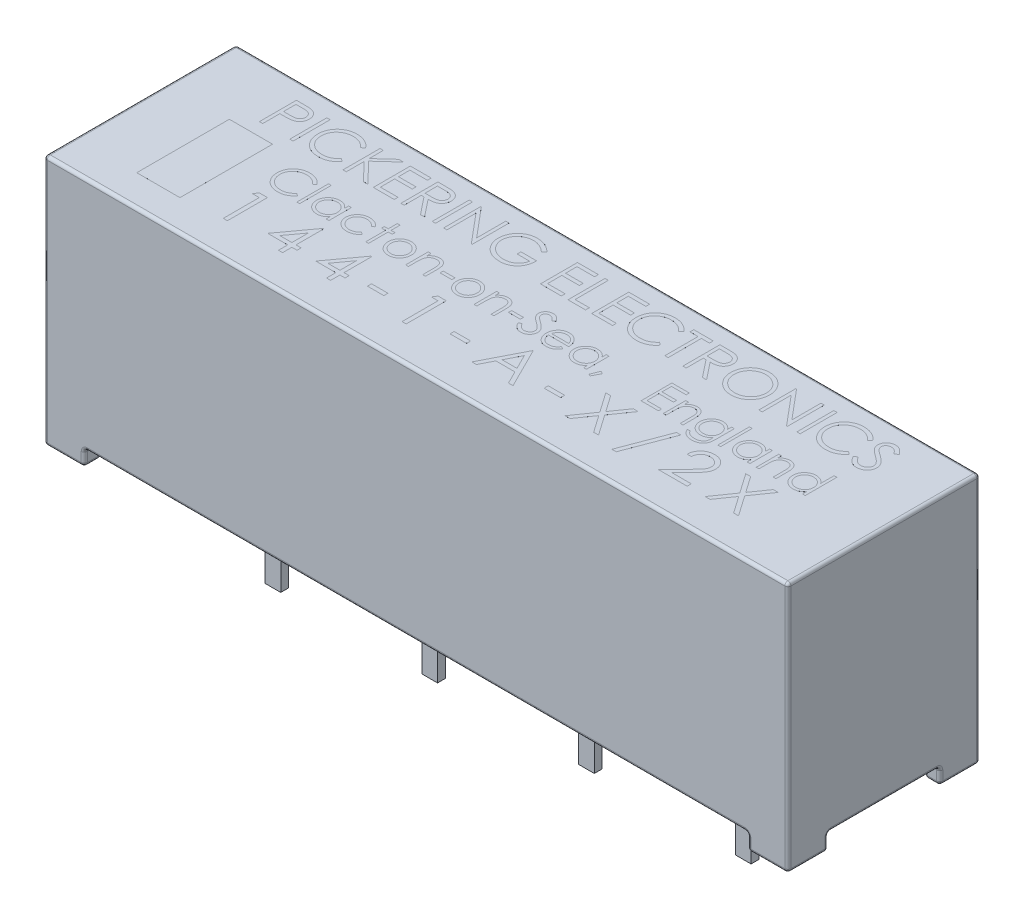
from build123d import *

# Parameters (mm, degrees)
SKETCH1_W               = 24.1
SKETCH1_H               = 6.22
MAIN_BODY_DEPTH         = 7.622
ORIGINAL_FOOT_DEPTH     = 0.508
RIGHT_FEET_COPY_1_DEPTH = 0.508
SKETCH3_W               = 0.508
SKETCH3_H               = 0.254
PINS_DEPTH              = 3.808
SKETCH4_W               = 1.4
SKETCH4_H               = 3
SKETCH4_W_2             = 0.107692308
SKETCH4_H_2             = 1.2
SKETCH4_W_3             = 0.08974359
SKETCH4_H_3             = 1.025641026
SKETCH4_W_4             = 0.384615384
SKETCH4_H_4             = 0.102564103
SKETCH4_W_5             = 0.533333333
SKETCH4_H_5             = 0.133333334
LETTERING_DEPTH         = 0.0001
FILLET1_R               = 0.1


with BuildPart() as part:
    # Sketch1 → Main Body (new body)
    with BuildSketch(Plane(origin=(0, 0, 0), x_dir=(1, 0, 0), z_dir=(0, 1, 0))):
        Rectangle(SKETCH1_W, SKETCH1_H)
    extrude(amount=MAIN_BODY_DEPTH)

    # Sketch2 → Original foot (add)
    with BuildSketch(Plane.XZ):
        Polygon((-12.05, 3.11), (-10.75, 3.11), (-10.75, 2.53065977), (-11.560513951, 2.53065977), (-11.560513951, 1.81), (-12.05, 1.81), align=None)
    original_foot = extrude(amount=ORIGINAL_FOOT_DEPTH)

    # Left foot: Original foot across plane
    add(original_foot.mirror(Plane.XY))

    # Right Feet: Original foot across plane
    add(original_foot.mirror(Plane(origin=(0, 0, 0), x_dir=(0, 0, 1), z_dir=(1, 0, 0))))

    # Right Feet copy 1 sketch → Right Feet copy 1 (add)
    with BuildSketch(Plane(origin=(0, 0, 0), x_dir=(-1, 0, 0), z_dir=(0, -1, 0))):
        Polygon((-12.05, 3.11), (-10.75, 3.11), (-10.75, 2.53065977), (-11.560513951, 2.53065977), (-11.560513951, 1.81), (-12.05, 1.81), align=None)
    extrude(amount=RIGHT_FEET_COPY_1_DEPTH)

    # Sketch3 → Pins (add)
    with BuildSketch(Plane.XZ):
        with Locations((-7.62, 0)):
            Rectangle(SKETCH3_W, SKETCH3_H)
        with Locations((-2.54, 0)):
            Rectangle(SKETCH3_W, SKETCH3_H)
        with Locations((7.62, 0)):
            Rectangle(SKETCH3_W, SKETCH3_H)
        with Locations((2.54, 0)):
            Rectangle(SKETCH3_W, SKETCH3_H)
    extrude(amount=PINS_DEPTH)

    # Sketch4 → Lettering (add)
    # profile 1 of 55: a face of its own
    with BuildSketch(Plane(origin=(0, 7.622, 0), x_dir=(-1, 0, 0), z_dir=(0, 1, 0))):
        with Locations((9.35, 0.61)):
            Rectangle(SKETCH4_W, SKETCH4_H)
    # profile 2 of 55: a face of its own
    with BuildSketch(Plane(origin=(0, 7.622, 0), x_dir=(-1, 0, 0), z_dir=(0, 1, 0))):
        with BuildLine():
            Line((9.496153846, -2.51), (9.260817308, -2.51))
            add(Edge.make_bspline(
                [(9.260817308, -2.51), (9.244630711, -2.509982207), (9.213616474, -2.509948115), (9.16914274, -2.508914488), (9.128750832, -2.507533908), (9.092527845, -2.505620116), (9.060362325, -2.503358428), (9.032399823, -2.5001863), (9.008420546, -2.496874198), (8.994052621, -2.493506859), (8.9875, -2.491971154)],
                knots=[0, 0, 0, 0, 1.415646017, 2.712440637, 3.8905458, 4.950247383, 5.884950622, 6.709939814, 7.411656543, 8, 8, 8, 8], degree=3))
            add(Edge.make_bspline(
                [(8.9875, -2.491971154), (8.979205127, -2.489700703), (8.962810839, -2.4852133), (8.939186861, -2.476226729), (8.916714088, -2.465566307), (8.895298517, -2.453434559), (8.875307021, -2.439258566), (8.856115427, -2.423856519), (8.838126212, -2.406605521), (8.821611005, -2.387528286), (8.806308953, -2.367249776), (8.793500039, -2.345252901), (8.782189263, -2.32230074), (8.773374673, -2.29783291), (8.766446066, -2.272172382), (8.761399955, -2.245252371), (8.758156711, -2.21713095), (8.757848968, -2.197909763), (8.757692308, -2.188125)],
                knots=[0, 0, 0, 0, 0.999333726, 1.975119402, 2.933498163, 3.889020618, 4.832249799, 5.779334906, 6.747801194, 7.724875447, 8.710438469, 9.696133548, 10.679360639, 11.681339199, 12.714023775, 13.766351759, 14.862936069, 16, 16, 16, 16], degree=3))
            add(Edge.make_bspline(
                [(8.757692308, -2.188125), (8.757836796, -2.178258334), (8.758119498, -2.158953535), (8.76151251, -2.130711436), (8.766082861, -2.103722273), (8.773110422, -2.07804589), (8.782314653, -2.053834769), (8.793111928, -2.030718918), (8.806134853, -2.009091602), (8.821098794, -1.988874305), (8.837745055, -1.970048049), (8.856003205, -1.952749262), (8.875799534, -1.937079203), (8.897071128, -1.923002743), (8.920025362, -1.910846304), (8.9443141, -1.899958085), (8.97014846, -1.890813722), (8.988025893, -1.886003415), (8.997115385, -1.883557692)],
                knots=[0, 0, 0, 0, 1.121902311, 2.195077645, 3.232258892, 4.234102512, 5.217864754, 6.176164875, 7.132989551, 8.084763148, 9.034132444, 9.988522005, 10.94243251, 11.903244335, 12.886203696, 13.894208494, 14.929344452, 16, 16, 16, 16], degree=3))
            add(Edge.make_bspline(
                [(8.997115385, -1.883557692), (9.004633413, -1.881960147), (9.02110961, -1.878459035), (9.048242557, -1.874523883), (9.079849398, -1.871296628), (9.115822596, -1.868284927), (9.156246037, -1.866689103), (9.20102701, -1.864815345), (9.250317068, -1.86393122), (9.284695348, -1.863875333), (9.302644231, -1.863846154)],
                knots=[0, 0, 0, 0, 0.601372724, 1.317943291, 2.144091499, 3.08771165, 4.142394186, 5.309582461, 6.595334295, 8, 8, 8, 8], degree=3))
            Line((9.302644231, -1.863846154), (9.388461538, -1.863846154))
            Line((9.388461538, -1.863846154), (9.388461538, -1.31))
            Line((9.388461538, -1.31), (9.496153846, -1.31))
            Line((9.496153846, -1.31), (9.496153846, -2.51))
        make_face()
        with BuildLine():
            Line((9.388461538, -2.386923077), (9.388461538, -1.986923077))
            Line((9.388461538, -1.986923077), (9.178365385, -1.984278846))
            add(Edge.make_bspline(
                [(9.178365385, -1.984278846), (9.168106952, -1.984272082), (9.148303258, -1.984259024), (9.119618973, -1.985648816), (9.093070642, -1.987160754), (9.068619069, -1.989605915), (9.046375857, -1.99258825), (9.026287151, -1.996575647), (9.008192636, -2.000642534), (8.987349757, -2.007699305), (8.964003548, -2.018345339), (8.938664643, -2.034246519), (8.917014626, -2.054278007), (8.898437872, -2.077044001), (8.883754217, -2.102396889), (8.873112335, -2.129447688), (8.866616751, -2.158093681), (8.865800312, -2.177674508), (8.865384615, -2.187644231)],
                knots=[0, 0, 0, 0, 1.160501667, 2.240324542, 3.248665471, 4.168823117, 5.020172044, 5.786515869, 6.485785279, 7.116517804, 8.272762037, 9.381837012, 10.485674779, 11.594342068, 12.695271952, 13.786226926, 14.872841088, 16, 16, 16, 16], degree=3))
            add(Edge.make_bspline(
                [(8.865384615, -2.187644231), (8.865818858, -2.197290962), (8.866682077, -2.21646747), (8.873058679, -2.244585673), (8.883866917, -2.271328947), (8.898449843, -2.296480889), (8.916581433, -2.319186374), (8.937800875, -2.338771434), (8.961778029, -2.354623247), (8.983907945, -2.365175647), (9.003712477, -2.37136381), (9.020831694, -2.37583135), (9.040259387, -2.378912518), (9.061811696, -2.381860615), (9.085461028, -2.384240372), (9.111357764, -2.385892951), (9.139415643, -2.386849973), (9.158893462, -2.386898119), (9.168990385, -2.386923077)],
                knots=[0, 0, 0, 0, 1.12039168, 2.227199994, 3.330242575, 4.460839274, 5.593542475, 6.693949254, 7.801736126, 8.92216649, 9.528704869, 10.210659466, 10.975987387, 11.81211542, 12.738540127, 13.736887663, 14.826846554, 16, 16, 16, 16], degree=3))
            Line((9.168990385, -2.386923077), (9.388461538, -2.386923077))
        make_face(mode=Mode.SUBTRACT)
    # profile 3 of 55: a face of its own
    with BuildSketch(Plane(origin=(0, 7.622, 0), x_dir=(-1, 0, 0), z_dir=(0, 1, 0))):
        with Locations((8.457692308, -1.91)):
            Rectangle(SKETCH4_W_2, SKETCH4_H_2)
    # profile 4 of 55: a face of its own
    with BuildSketch(Plane(origin=(0, 7.622, 0), x_dir=(-1, 0, 0), z_dir=(0, 1, 0))):
        with BuildLine():
            Line((7.034615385, -2.289807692), (7.128846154, -2.217692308))
            add(Edge.make_bspline(
                [(7.128846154, -2.217692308), (7.135568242, -2.225703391), (7.148921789, -2.241617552), (7.170403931, -2.263966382), (7.192796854, -2.284897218), (7.216069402, -2.304544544), (7.240760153, -2.322118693), (7.265928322, -2.338988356), (7.292488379, -2.353758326), (7.329029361, -2.371801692), (7.377017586, -2.390219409), (7.437218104, -2.406060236), (7.500148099, -2.416049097), (7.543071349, -2.417138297), (7.564903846, -2.417692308)],
                knots=[0, 0, 0, 0, 0.75789156, 1.505565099, 2.245254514, 2.979266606, 3.711207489, 4.440978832, 5.174393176, 5.91211879, 7.394186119, 8.890401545, 10.418332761, 12, 12, 12, 12], degree=3))
            add(Edge.make_bspline(
                [(7.564903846, -2.417692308), (7.57693226, -2.417553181), (7.600877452, -2.41727622), (7.636416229, -2.413648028), (7.671358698, -2.408489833), (7.705574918, -2.401022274), (7.738996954, -2.391300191), (7.771879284, -2.37989878), (7.803834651, -2.365710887), (7.835247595, -2.350042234), (7.865342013, -2.33233961), (7.893822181, -2.313036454), (7.920559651, -2.292323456), (7.945622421, -2.270249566), (7.968757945, -2.246557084), (7.990212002, -2.221512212), (8.009957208, -2.195001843), (8.027973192, -2.167152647), (8.044087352, -2.138102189), (8.058060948, -2.107975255), (8.069872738, -2.076886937), (8.079455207, -2.04490386), (8.086954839, -2.012139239), (8.092146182, -1.978475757), (8.095740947, -1.943972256), (8.096015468, -1.920586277), (8.096153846, -1.908798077)],
                knots=[0, 0, 0, 0, 1.054960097, 2.100129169, 3.131228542, 4.15308236, 5.169990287, 6.183953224, 7.204064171, 8.235355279, 9.262684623, 10.264978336, 11.252191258, 12.228402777, 13.192898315, 14.155264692, 15.119862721, 16.091023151, 17.063429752, 18.032246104, 19.00241354, 19.978852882, 20.959535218, 21.948948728, 22.966123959, 24, 24, 24, 24], degree=3))
            add(Edge.make_bspline(
                [(8.096153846, -1.908798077), (8.095720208, -1.89106202), (8.094868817, -1.856239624), (8.087323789, -1.805226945), (8.075766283, -1.756309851), (8.058728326, -1.709819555), (8.037300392, -1.665368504), (8.010564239, -1.623495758), (7.979481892, -1.583587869), (7.943734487, -1.546611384), (7.904508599, -1.512835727), (7.862423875, -1.483092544), (7.817583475, -1.458298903), (7.770482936, -1.437667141), (7.720759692, -1.421807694), (7.668503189, -1.410642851), (7.613827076, -1.403359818), (7.576466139, -1.402662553), (7.557451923, -1.402307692)],
                knots=[0, 0, 0, 0, 1.029159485, 2.020618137, 2.987588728, 3.942669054, 4.889339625, 5.846988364, 6.821327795, 7.821533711, 8.827683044, 9.822769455, 10.807800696, 11.797391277, 12.803701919, 13.832062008, 14.896664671, 16, 16, 16, 16], degree=3))
            add(Edge.make_bspline(
                [(7.557451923, -1.402307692), (7.53650243, -1.402886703), (7.495268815, -1.404026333), (7.434799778, -1.413680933), (7.376913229, -1.429335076), (7.321606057, -1.451242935), (7.269034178, -1.479722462), (7.219115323, -1.514247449), (7.171807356, -1.555146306), (7.143360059, -1.586374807), (7.128846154, -1.602307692)],
                knots=[0, 0, 0, 0, 1.028121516, 2.023589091, 2.998037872, 3.967518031, 4.937445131, 5.927275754, 6.942489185, 8, 8, 8, 8], degree=3))
            Line((7.128846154, -1.602307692), (7.034615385, -1.530913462))
            add(Edge.make_bspline(
                [(7.034615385, -1.530913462), (7.042198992, -1.521129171), (7.057329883, -1.501607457), (7.08182598, -1.474080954), (7.107649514, -1.448211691), (7.134870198, -1.424134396), (7.163523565, -1.401728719), (7.193597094, -1.381098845), (7.224940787, -1.362015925), (7.257593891, -1.3447195), (7.291558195, -1.329328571), (7.32654263, -1.315876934), (7.362611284, -1.304581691), (7.399479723, -1.295091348), (7.437526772, -1.288313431), (7.476317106, -1.282919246), (7.516211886, -1.279718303), (7.543103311, -1.279394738), (7.556730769, -1.279230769)],
                knots=[0, 0, 0, 0, 0.986880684, 1.969034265, 2.935876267, 3.899990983, 4.864973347, 5.834408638, 6.8063673, 7.789580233, 8.778939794, 9.778051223, 10.776304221, 11.791326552, 12.811423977, 13.855999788, 14.91350973, 16, 16, 16, 16], degree=3))
            add(Edge.make_bspline(
                [(7.556730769, -1.279230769), (7.569637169, -1.279320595), (7.595157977, -1.279498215), (7.632837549, -1.28237553), (7.669519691, -1.286301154), (7.705099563, -1.292212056), (7.739771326, -1.299187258), (7.773220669, -1.308537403), (7.805776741, -1.319011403), (7.837308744, -1.331321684), (7.867843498, -1.345212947), (7.897282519, -1.36091291), (7.925612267, -1.378289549), (7.953111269, -1.396959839), (7.979373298, -1.417523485), (8.004625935, -1.439694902), (8.029010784, -1.463399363), (8.044097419, -1.480492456), (8.051682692, -1.489086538)],
                knots=[0, 0, 0, 0, 1.114604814, 2.203992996, 3.262667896, 4.300477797, 5.318619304, 6.316056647, 7.298880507, 8.271930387, 9.238335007, 10.195173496, 11.151986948, 12.108099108, 13.064862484, 14.031167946, 15.010108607, 16, 16, 16, 16], degree=3))
            add(Edge.make_bspline(
                [(8.051682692, -1.489086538), (8.063831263, -1.504015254), (8.087981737, -1.533692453), (8.118893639, -1.581785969), (8.145265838, -1.631954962), (8.166826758, -1.684490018), (8.18338806, -1.739411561), (8.195031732, -1.796631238), (8.202545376, -1.856034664), (8.203407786, -1.89643528), (8.203846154, -1.916971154)],
                knots=[0, 0, 0, 0, 0.994611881, 1.977215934, 2.950189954, 3.921972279, 4.908960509, 5.911694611, 6.938501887, 8, 8, 8, 8], degree=3))
            add(Edge.make_bspline(
                [(8.203846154, -1.916971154), (8.20331056, -1.938554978), (8.202256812, -1.981019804), (8.193378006, -2.043355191), (8.178921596, -2.102990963), (8.159015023, -2.160156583), (8.132752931, -2.214524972), (8.100960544, -2.26632575), (8.063327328, -2.315516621), (8.02032592, -2.361468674), (7.973157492, -2.403481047), (7.922648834, -2.440443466), (7.868894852, -2.47120368), (7.812488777, -2.496916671), (7.75300796, -2.516680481), (7.69057938, -2.530515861), (7.625320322, -2.539127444), (7.580796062, -2.540216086), (7.558173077, -2.540769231)],
                knots=[0, 0, 0, 0, 1.032901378, 2.032168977, 3.007206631, 3.966850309, 4.924221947, 5.891988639, 6.871730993, 7.884084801, 8.900290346, 9.89161143, 10.874607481, 11.860025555, 12.854717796, 13.869097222, 14.917278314, 16, 16, 16, 16], degree=3))
            add(Edge.make_bspline(
                [(7.558173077, -2.540769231), (7.544385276, -2.540603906), (7.517093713, -2.540276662), (7.476721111, -2.537086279), (7.437416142, -2.531766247), (7.399069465, -2.524515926), (7.36161783, -2.515497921), (7.325229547, -2.504206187), (7.290008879, -2.490553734), (7.255718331, -2.475358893), (7.222797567, -2.457956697), (7.191262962, -2.439041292), (7.161370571, -2.418248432), (7.132926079, -2.395881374), (7.106060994, -2.371768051), (7.080372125, -2.346313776), (7.056622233, -2.318843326), (7.041964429, -2.299503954), (7.034615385, -2.289807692)],
                knots=[0, 0, 0, 0, 1.096566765, 2.170543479, 3.218870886, 4.250164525, 5.273529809, 6.281496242, 7.278154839, 8.276706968, 9.263143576, 10.238168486, 11.199979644, 12.157579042, 13.114563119, 14.070017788, 15.032356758, 16, 16, 16, 16], degree=3))
        make_face()
    # profile 5 of 55: a face of its own
    with BuildSketch(Plane(origin=(0, 7.622, 0), x_dir=(-1, 0, 0), z_dir=(0, 1, 0))):
        Polygon((6.788461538, -2.51), (6.680769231, -2.51), (6.680769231, -2.053028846), (6.180528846, -2.51), (6.026923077, -2.51), (6.616586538, -1.971538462), (5.980769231, -1.31), (6.124278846, -1.31), (6.680769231, -1.889086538), (6.680769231, -1.31), (6.788461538, -1.31), align=None)
    # profile 6 of 55: a face of its own
    with BuildSketch(Plane(origin=(0, 7.622, 0), x_dir=(-1, 0, 0), z_dir=(0, 1, 0))):
        Polygon((5.803846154, -2.51), (5.126923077, -2.51), (5.126923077, -2.386923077), (5.696153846, -2.386923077), (5.696153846, -2.017692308), (5.126923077, -2.017692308), (5.126923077, -1.894615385), (5.696153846, -1.894615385), (5.696153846, -1.433076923), (5.126923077, -1.433076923), (5.126923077, -1.31), (5.803846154, -1.31), align=None)
    # profile 7 of 55: a face of its own
    with BuildSketch(Plane(origin=(0, 7.622, 0), x_dir=(-1, 0, 0), z_dir=(0, 1, 0))):
        with BuildLine():
            Line((4.911538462, -2.51), (4.671394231, -2.51))
            add(Edge.make_bspline(
                [(4.671394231, -2.51), (4.655368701, -2.509946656), (4.624597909, -2.50984423), (4.580515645, -2.509273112), (4.54046064, -2.50763619), (4.504453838, -2.506227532), (4.472495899, -2.503658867), (4.444488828, -2.501203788), (4.420561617, -2.497989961), (4.406077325, -2.495005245), (4.399519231, -2.493653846)],
                knots=[0, 0, 0, 0, 1.410062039, 2.707475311, 3.878576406, 4.937260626, 5.877586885, 6.699081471, 7.410979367, 8, 8, 8, 8], degree=3))
            add(Edge.make_bspline(
                [(4.399519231, -2.493653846), (4.390739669, -2.49148491), (4.373367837, -2.487193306), (4.348358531, -2.478117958), (4.324517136, -2.467632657), (4.301930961, -2.455223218), (4.280605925, -2.441099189), (4.260544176, -2.425203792), (4.242014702, -2.407400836), (4.224358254, -2.388427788), (4.208940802, -2.367458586), (4.195061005, -2.345557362), (4.183409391, -2.322302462), (4.174240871, -2.297811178), (4.166554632, -2.272323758), (4.161388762, -2.245588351), (4.158171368, -2.217691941), (4.157853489, -2.198710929), (4.157692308, -2.189086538)],
                knots=[0, 0, 0, 0, 1.027276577, 2.032638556, 3.019345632, 3.985365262, 4.957888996, 5.923693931, 6.890056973, 7.876427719, 8.865527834, 9.843495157, 10.821038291, 11.815616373, 12.812734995, 13.843357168, 14.906466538, 16, 16, 16, 16], degree=3))
            add(Edge.make_bspline(
                [(4.157692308, -2.189086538), (4.158195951, -2.173097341), (4.15917869, -2.141898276), (4.168341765, -2.096620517), (4.18335019, -2.054383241), (4.20403492, -2.015245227), (4.230363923, -1.979948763), (4.262005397, -1.949051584), (4.298797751, -1.922957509), (4.333209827, -1.905054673), (4.363622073, -1.893535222), (4.388732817, -1.885389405), (4.416145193, -1.87920187), (4.445465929, -1.873578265), (4.476921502, -1.869287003), (4.510448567, -1.866239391), (4.546130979, -1.864279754), (4.570590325, -1.863993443), (4.583173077, -1.863846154)],
                knots=[0, 0, 0, 0, 1.260402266, 2.459371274, 3.627181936, 4.786749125, 5.93865593, 7.087644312, 8.261344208, 9.485713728, 10.136162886, 10.825977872, 11.566646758, 12.35154167, 13.181268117, 14.0701832, 15.007234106, 16, 16, 16, 16], degree=3))
            Line((4.583173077, -1.863846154), (4.142307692, -1.31))
            Line((4.142307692, -1.31), (4.275480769, -1.31))
            Line((4.275480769, -1.31), (4.716346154, -1.863846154))
            Line((4.716346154, -1.863846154), (4.803846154, -1.863846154))
            Line((4.803846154, -1.863846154), (4.803846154, -1.31))
            Line((4.803846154, -1.31), (4.911538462, -1.31))
            Line((4.911538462, -1.31), (4.911538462, -2.51))
        make_face()
        with BuildLine():
            Line((4.803846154, -2.386923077), (4.803846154, -1.986923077))
            Line((4.803846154, -1.986923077), (4.584134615, -1.985240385))
            add(Edge.make_bspline(
                [(4.584134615, -1.985240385), (4.573876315, -1.985235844), (4.553992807, -1.985227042), (4.525226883, -1.986596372), (4.498442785, -1.988153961), (4.473743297, -1.990536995), (4.451116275, -1.993606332), (4.430576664, -1.997451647), (4.412079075, -2.001912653), (4.390574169, -2.008887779), (4.366284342, -2.019462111), (4.34043109, -2.03585853), (4.317823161, -2.055687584), (4.299027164, -2.078648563), (4.283930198, -2.10400223), (4.27344401, -2.131174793), (4.266533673, -2.159738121), (4.265772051, -2.179350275), (4.265384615, -2.189326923)],
                knots=[0, 0, 0, 0, 1.146399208, 2.222048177, 3.218135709, 4.144938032, 4.994811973, 5.769438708, 6.479732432, 7.119818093, 8.294689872, 9.430121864, 10.527913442, 11.641375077, 12.733452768, 13.811150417, 14.886538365, 16, 16, 16, 16], degree=3))
            add(Edge.make_bspline(
                [(4.265384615, -2.189326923), (4.265791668, -2.198979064), (4.266598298, -2.218106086), (4.273333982, -2.246044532), (4.284332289, -2.272610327), (4.299386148, -2.297437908), (4.318122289, -2.31980791), (4.339945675, -2.338889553), (4.364342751, -2.354742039), (4.386960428, -2.365201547), (4.407324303, -2.371355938), (4.424923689, -2.375823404), (4.444982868, -2.378952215), (4.467265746, -2.381829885), (4.491870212, -2.38426683), (4.518811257, -2.385884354), (4.54806962, -2.386851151), (4.568348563, -2.386898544), (4.578846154, -2.386923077)],
                knots=[0, 0, 0, 0, 1.100596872, 2.180981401, 3.259506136, 4.371595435, 5.481727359, 6.576991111, 7.667816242, 8.793363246, 9.406619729, 10.09427138, 10.864108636, 11.721733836, 12.6590937, 13.685439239, 14.801845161, 16, 16, 16, 16], degree=3))
            Line((4.578846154, -2.386923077), (4.803846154, -2.386923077))
        make_face(mode=Mode.SUBTRACT)
    # profile 8 of 55: a face of its own
    with BuildSketch(Plane(origin=(0, 7.622, 0), x_dir=(-1, 0, 0), z_dir=(0, 1, 0))):
        with Locations((3.842307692, -1.91)):
            Rectangle(SKETCH4_W_2, SKETCH4_H_2)
    # profile 9 of 55: a face of its own
    with BuildSketch(Plane(origin=(0, 7.622, 0), x_dir=(-1, 0, 0), z_dir=(0, 1, 0))):
        Polygon((3.526923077, -1.31), (3.526923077, -2.51), (3.504326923, -2.51), (2.711538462, -1.565528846), (2.711538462, -2.51), (2.603846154, -2.51), (2.603846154, -1.31), (2.628365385, -1.31), (3.419230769, -2.252307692), (3.419230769, -1.31), align=None)
    # profile 10 of 55: a face of its own
    with BuildSketch(Plane(origin=(0, 7.622, 0), x_dir=(-1, 0, 0), z_dir=(0, 1, 0))):
        with BuildLine():
            Line((1.173076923, -2.305192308), (1.265384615, -2.217692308))
            add(Edge.make_bspline(
                [(1.265384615, -2.217692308), (1.282186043, -2.233384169), (1.315299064, -2.264310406), (1.369026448, -2.304884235), (1.425160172, -2.33937083), (1.483243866, -2.367704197), (1.542157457, -2.38972872), (1.600724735, -2.405653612), (1.658535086, -2.415895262), (1.696914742, -2.417098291), (1.715865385, -2.417692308)],
                knots=[0, 0, 0, 0, 1.091957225, 2.152079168, 3.193085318, 4.218301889, 5.218403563, 6.17723952, 7.099979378, 8, 8, 8, 8], degree=3))
            add(Edge.make_bspline(
                [(1.715865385, -2.417692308), (1.727493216, -2.417550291), (1.750718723, -2.417266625), (1.785218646, -2.413654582), (1.819352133, -2.408443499), (1.853001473, -2.40098118), (1.886300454, -2.391288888), (1.919174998, -2.379586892), (1.951561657, -2.365500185), (1.983290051, -2.349440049), (2.01420648, -2.331907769), (2.043283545, -2.312354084), (2.070642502, -2.291380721), (2.096089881, -2.268712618), (2.119974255, -2.244727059), (2.141858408, -2.219083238), (2.162220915, -2.192160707), (2.180300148, -2.163573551), (2.196641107, -2.134134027), (2.210790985, -2.104076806), (2.22297485, -2.073613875), (2.232710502, -2.042728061), (2.240537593, -2.011439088), (2.24607771, -1.979795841), (2.249189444, -1.947642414), (2.249728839, -1.92611207), (2.25, -1.915288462)],
                knots=[0, 0, 0, 0, 1.028307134, 2.053947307, 3.065600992, 4.082111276, 5.100671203, 6.132125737, 7.167228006, 8.222953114, 9.277225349, 10.309459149, 11.320441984, 12.324791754, 13.322338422, 14.312705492, 15.305176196, 16.306142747, 17.302479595, 18.282363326, 19.243345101, 20.20291386, 21.145121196, 22.094978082, 23.042318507, 24, 24, 24, 24], degree=3))
            add(Edge.make_bspline(
                [(2.25, -1.915288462), (2.249738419, -1.904224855), (2.249215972, -1.882127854), (2.245940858, -1.849136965), (2.239657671, -1.816703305), (2.231982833, -1.784520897), (2.22111931, -1.753000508), (2.208490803, -1.721680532), (2.193263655, -1.69085205), (2.175729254, -1.660729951), (2.156351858, -1.631416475), (2.135043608, -1.603571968), (2.11176426, -1.57752184), (2.086941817, -1.552885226), (2.060349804, -1.529817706), (2.031730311, -1.508597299), (2.001483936, -1.488895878), (1.969597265, -1.470929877), (1.936407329, -1.454881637), (1.902376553, -1.440610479), (1.867395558, -1.428857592), (1.831648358, -1.419278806), (1.79517752, -1.411427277), (1.757797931, -1.406376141), (1.719784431, -1.402710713), (1.694159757, -1.402442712), (1.68125, -1.402307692)],
                knots=[0, 0, 0, 0, 0.935896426, 1.86923723, 2.799743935, 3.728471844, 4.66505513, 5.616527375, 6.583419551, 7.570341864, 8.562833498, 9.553750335, 10.533080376, 11.5155245, 12.510142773, 13.507781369, 14.526649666, 15.561487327, 16.601173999, 17.643331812, 18.680652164, 19.71969803, 20.772446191, 21.833473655, 22.9085001, 24, 24, 24, 24], degree=3))
            add(Edge.make_bspline(
                [(1.68125, -1.402307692), (1.665691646, -1.402632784), (1.63514029, -1.403271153), (1.590231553, -1.408244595), (1.547095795, -1.41600224), (1.505873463, -1.427398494), (1.466414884, -1.441823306), (1.428865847, -1.459661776), (1.393121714, -1.480725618), (1.359340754, -1.504590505), (1.328312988, -1.5311735), (1.300110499, -1.559626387), (1.275559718, -1.590176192), (1.254500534, -1.622816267), (1.236374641, -1.657065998), (1.221915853, -1.693512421), (1.210732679, -1.731748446), (1.206157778, -1.758182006), (1.203846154, -1.771538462)],
                knots=[0, 0, 0, 0, 1.130234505, 2.219399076, 3.279128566, 4.311639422, 5.322903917, 6.328167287, 7.327698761, 8.334124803, 9.329374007, 10.292761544, 11.24113083, 12.171311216, 13.111441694, 14.052040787, 15.015727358, 16, 16, 16, 16], degree=3))
            Line((1.203846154, -1.771538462), (1.603846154, -1.771538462))
            Line((1.603846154, -1.771538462), (1.603846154, -1.894615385))
            Line((1.603846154, -1.894615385), (1.096153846, -1.894615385))
            add(Edge.make_bspline(
                [(1.096153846, -1.894615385), (1.096738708, -1.871675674), (1.09788339, -1.826778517), (1.105912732, -1.761302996), (1.118878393, -1.699461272), (1.1365905, -1.641188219), (1.159519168, -1.586566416), (1.187418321, -1.535540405), (1.220734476, -1.488439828), (1.258280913, -1.44488017), (1.300418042, -1.40602444), (1.346007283, -1.371873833), (1.395123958, -1.343107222), (1.447721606, -1.319703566), (1.50362804, -1.301438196), (1.562972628, -1.288487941), (1.625674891, -1.280729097), (1.668647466, -1.279737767), (1.690625, -1.279230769)],
                knots=[0, 0, 0, 0, 1.140356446, 2.231883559, 3.274166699, 4.278491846, 5.25512956, 6.21435461, 7.1637429, 8.11826594, 9.068280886, 10.0076534, 10.945064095, 11.891975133, 12.864533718, 13.863980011, 14.907571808, 16, 16, 16, 16], degree=3))
            add(Edge.make_bspline(
                [(1.690625, -1.279230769), (1.704171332, -1.279425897), (1.730889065, -1.27981075), (1.770348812, -1.282545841), (1.808720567, -1.286756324), (1.845998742, -1.293114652), (1.882320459, -1.300902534), (1.917504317, -1.310875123), (1.951684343, -1.322418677), (1.984913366, -1.335548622), (2.016889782, -1.350761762), (2.047756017, -1.367667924), (2.077682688, -1.386179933), (2.106465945, -1.406617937), (2.134255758, -1.428829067), (2.160872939, -1.452857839), (2.186466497, -1.478630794), (2.202498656, -1.496932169), (2.210576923, -1.506153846)],
                knots=[0, 0, 0, 0, 1.107784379, 2.184907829, 3.233506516, 4.263428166, 5.276301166, 6.270063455, 7.25232949, 8.225834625, 9.190232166, 10.146266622, 11.1027726, 12.066435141, 13.031522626, 14.010570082, 14.99756817, 16, 16, 16, 16], degree=3))
            add(Edge.make_bspline(
                [(2.210576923, -1.506153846), (2.222297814, -1.520783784), (2.245545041, -1.549800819), (2.275468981, -1.596292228), (2.300978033, -1.644430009), (2.321675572, -1.694348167), (2.337837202, -1.746000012), (2.349427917, -1.79931954), (2.356218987, -1.854375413), (2.357197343, -1.891632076), (2.357692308, -1.910480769)],
                knots=[0, 0, 0, 0, 1.023165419, 2.029347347, 3.013907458, 3.994755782, 4.975994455, 5.96558838, 6.970761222, 8, 8, 8, 8], degree=3))
            add(Edge.make_bspline(
                [(2.357692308, -1.910480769), (2.357509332, -1.924594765), (2.357145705, -1.952643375), (2.352755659, -1.994288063), (2.346419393, -2.035182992), (2.337241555, -2.075366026), (2.325165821, -2.114658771), (2.310663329, -2.153363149), (2.293676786, -2.191324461), (2.273854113, -2.228206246), (2.252277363, -2.263995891), (2.228014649, -2.297566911), (2.202413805, -2.329568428), (2.174248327, -2.359094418), (2.144573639, -2.387088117), (2.112651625, -2.412811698), (2.079006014, -2.436699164), (2.043365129, -2.458283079), (2.006294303, -2.477677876), (1.967873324, -2.494679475), (1.928116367, -2.50873101), (1.887320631, -2.520653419), (1.845177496, -2.529470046), (1.801992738, -2.5358639), (1.757541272, -2.540238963), (1.727494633, -2.540590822), (1.712259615, -2.540769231)],
                knots=[0, 0, 0, 0, 1.009025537, 2.005226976, 2.991671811, 3.967589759, 4.950148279, 5.929425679, 6.922109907, 7.921964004, 8.922507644, 9.908469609, 10.882248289, 11.851158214, 12.824245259, 13.798023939, 14.780666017, 15.773333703, 16.775582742, 17.771174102, 18.775387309, 19.789283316, 20.80873549, 21.851817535, 22.910773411, 24, 24, 24, 24], degree=3))
            add(Edge.make_bspline(
                [(1.712259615, -2.540769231), (1.699834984, -2.540571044), (1.675198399, -2.540178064), (1.638539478, -2.537440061), (1.602519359, -2.533148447), (1.56695735, -2.527147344), (1.531988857, -2.519208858), (1.497507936, -2.509534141), (1.463579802, -2.498332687), (1.430244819, -2.484963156), (1.397276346, -2.46979101), (1.364491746, -2.452711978), (1.332002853, -2.433434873), (1.299753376, -2.411902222), (1.267539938, -2.38848391), (1.235872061, -2.362510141), (1.203985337, -2.335005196), (1.183481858, -2.315228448), (1.173076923, -2.305192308)],
                knots=[0, 0, 0, 0, 0.985875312, 1.954874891, 2.915472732, 3.863573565, 4.815313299, 5.759461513, 6.704487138, 7.649063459, 8.607849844, 9.583336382, 10.581114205, 11.603942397, 12.659508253, 13.739925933, 14.853076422, 16, 16, 16, 16], degree=3))
        make_face()
    # profile 11 of 55: a face of its own
    with BuildSketch(Plane(origin=(0, 7.622, 0), x_dir=(-1, 0, 0), z_dir=(0, 1, 0))):
        Polygon((0.388461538, -2.51), (-0.288461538, -2.51), (-0.288461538, -2.386923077), (0.280769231, -2.386923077), (0.280769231, -2.017692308), (-0.288461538, -2.017692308), (-0.288461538, -1.894615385), (0.280769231, -1.894615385), (0.280769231, -1.433076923), (-0.288461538, -1.433076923), (-0.288461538, -1.31), (0.388461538, -1.31), align=None)
    # profile 12 of 55: a face of its own
    with BuildSketch(Plane(origin=(0, 7.622, 0), x_dir=(-1, 0, 0), z_dir=(0, 1, 0))):
        Polygon((-0.503846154, -2.51), (-0.611538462, -2.51), (-0.611538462, -1.433076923), (-1.073076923, -1.433076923), (-1.073076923, -1.31), (-0.503846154, -1.31), align=None)
    # profile 13 of 55: a face of its own
    with BuildSketch(Plane(origin=(0, 7.622, 0), x_dir=(-1, 0, 0), z_dir=(0, 1, 0))):
        Polygon((-1.273076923, -2.51), (-1.95, -2.51), (-1.95, -2.386923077), (-1.380769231, -2.386923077), (-1.380769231, -2.017692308), (-1.95, -2.017692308), (-1.95, -1.894615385), (-1.380769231, -1.894615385), (-1.380769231, -1.433076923), (-1.95, -1.433076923), (-1.95, -1.31), (-1.273076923, -1.31), align=None)
    # profile 14 of 55: a face of its own
    with BuildSketch(Plane(origin=(0, 7.622, 0), x_dir=(-1, 0, 0), z_dir=(0, 1, 0))):
        with BuildLine():
            Line((-3.273076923, -2.289807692), (-3.178846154, -2.217692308))
            add(Edge.make_bspline(
                [(-3.178846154, -2.217692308), (-3.172124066, -2.225703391), (-3.158770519, -2.241617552), (-3.137288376, -2.263966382), (-3.114895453, -2.284897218), (-3.091622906, -2.304544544), (-3.066932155, -2.322118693), (-3.041763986, -2.338988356), (-3.015203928, -2.353758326), (-2.978662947, -2.371801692), (-2.930674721, -2.390219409), (-2.870474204, -2.406060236), (-2.807544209, -2.416049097), (-2.764620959, -2.417138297), (-2.742788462, -2.417692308)],
                knots=[0, 0, 0, 0, 0.75789156, 1.505565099, 2.245254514, 2.979266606, 3.711207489, 4.440978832, 5.174393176, 5.91211879, 7.394186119, 8.890401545, 10.418332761, 12, 12, 12, 12], degree=3))
            add(Edge.make_bspline(
                [(-2.742788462, -2.417692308), (-2.730760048, -2.417553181), (-2.706814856, -2.41727622), (-2.671276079, -2.413648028), (-2.63633361, -2.408489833), (-2.602117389, -2.401022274), (-2.568695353, -2.391300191), (-2.535813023, -2.37989878), (-2.503857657, -2.365710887), (-2.472444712, -2.350042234), (-2.442350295, -2.33233961), (-2.413870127, -2.313036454), (-2.387132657, -2.292323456), (-2.362069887, -2.270249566), (-2.338934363, -2.246557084), (-2.317480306, -2.221512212), (-2.297735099, -2.195001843), (-2.279719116, -2.167152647), (-2.263604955, -2.138102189), (-2.24963136, -2.107975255), (-2.23781957, -2.076886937), (-2.228237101, -2.04490386), (-2.220737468, -2.012139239), (-2.215546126, -1.978475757), (-2.211951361, -1.943972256), (-2.21167684, -1.920586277), (-2.211538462, -1.908798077)],
                knots=[0, 0, 0, 0, 1.054960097, 2.100129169, 3.131228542, 4.15308236, 5.169990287, 6.183953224, 7.204064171, 8.235355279, 9.262684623, 10.264978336, 11.252191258, 12.228402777, 13.192898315, 14.155264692, 15.119862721, 16.091023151, 17.063429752, 18.032246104, 19.00241354, 19.978852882, 20.959535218, 21.948948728, 22.966123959, 24, 24, 24, 24], degree=3))
            add(Edge.make_bspline(
                [(-2.211538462, -1.908798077), (-2.2119721, -1.89106202), (-2.21282349, -1.856239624), (-2.220368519, -1.805226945), (-2.231926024, -1.756309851), (-2.248963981, -1.709819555), (-2.270391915, -1.665368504), (-2.297128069, -1.623495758), (-2.328210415, -1.583587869), (-2.36395782, -1.546611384), (-2.403183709, -1.512835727), (-2.445268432, -1.483092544), (-2.490108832, -1.458298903), (-2.537209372, -1.437667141), (-2.586932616, -1.421807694), (-2.639189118, -1.410642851), (-2.693865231, -1.403359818), (-2.731226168, -1.402662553), (-2.750240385, -1.402307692)],
                knots=[0, 0, 0, 0, 1.029159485, 2.020618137, 2.987588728, 3.942669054, 4.889339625, 5.846988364, 6.821327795, 7.821533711, 8.827683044, 9.822769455, 10.807800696, 11.797391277, 12.803701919, 13.832062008, 14.896664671, 16, 16, 16, 16], degree=3))
            add(Edge.make_bspline(
                [(-2.750240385, -1.402307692), (-2.771189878, -1.402886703), (-2.812423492, -1.404026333), (-2.87289253, -1.413680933), (-2.930779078, -1.429335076), (-2.986086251, -1.451242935), (-3.03865813, -1.479722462), (-3.088576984, -1.514247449), (-3.135884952, -1.555146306), (-3.164332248, -1.586374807), (-3.178846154, -1.602307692)],
                knots=[0, 0, 0, 0, 1.028121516, 2.023589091, 2.998037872, 3.967518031, 4.937445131, 5.927275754, 6.942489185, 8, 8, 8, 8], degree=3))
            Line((-3.178846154, -1.602307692), (-3.273076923, -1.530913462))
            add(Edge.make_bspline(
                [(-3.273076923, -1.530913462), (-3.265493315, -1.521129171), (-3.250362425, -1.501607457), (-3.225866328, -1.474080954), (-3.200042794, -1.448211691), (-3.17282211, -1.424134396), (-3.144168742, -1.401728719), (-3.114095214, -1.381098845), (-3.082751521, -1.362015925), (-3.050098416, -1.3447195), (-3.016134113, -1.329328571), (-2.981149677, -1.315876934), (-2.945081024, -1.304581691), (-2.908212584, -1.295091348), (-2.870165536, -1.288313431), (-2.831375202, -1.282919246), (-2.791480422, -1.279718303), (-2.764588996, -1.279394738), (-2.750961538, -1.279230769)],
                knots=[0, 0, 0, 0, 0.986880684, 1.969034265, 2.935876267, 3.899990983, 4.864973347, 5.834408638, 6.8063673, 7.789580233, 8.778939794, 9.778051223, 10.776304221, 11.791326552, 12.811423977, 13.855999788, 14.91350973, 16, 16, 16, 16], degree=3))
            add(Edge.make_bspline(
                [(-2.750961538, -1.279230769), (-2.738055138, -1.279320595), (-2.71253433, -1.279498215), (-2.674854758, -1.28237553), (-2.638172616, -1.286301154), (-2.602592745, -1.292212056), (-2.567920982, -1.299187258), (-2.534471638, -1.308537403), (-2.501915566, -1.319011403), (-2.470383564, -1.331321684), (-2.43984881, -1.345212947), (-2.410409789, -1.36091291), (-2.38208004, -1.378289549), (-2.354581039, -1.396959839), (-2.32831901, -1.417523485), (-2.303066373, -1.439694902), (-2.278681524, -1.463399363), (-2.263594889, -1.480492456), (-2.256009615, -1.489086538)],
                knots=[0, 0, 0, 0, 1.114604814, 2.203992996, 3.262667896, 4.300477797, 5.318619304, 6.316056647, 7.298880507, 8.271930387, 9.238335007, 10.195173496, 11.151986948, 12.108099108, 13.064862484, 14.031167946, 15.010108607, 16, 16, 16, 16], degree=3))
            add(Edge.make_bspline(
                [(-2.256009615, -1.489086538), (-2.243861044, -1.504015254), (-2.21971057, -1.533692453), (-2.188798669, -1.581785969), (-2.16242647, -1.631954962), (-2.14086555, -1.684490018), (-2.124304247, -1.739411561), (-2.112660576, -1.796631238), (-2.105146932, -1.856034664), (-2.104284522, -1.89643528), (-2.103846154, -1.916971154)],
                knots=[0, 0, 0, 0, 0.994611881, 1.977215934, 2.950189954, 3.921972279, 4.908960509, 5.911694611, 6.938501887, 8, 8, 8, 8], degree=3))
            add(Edge.make_bspline(
                [(-2.103846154, -1.916971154), (-2.104381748, -1.938554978), (-2.105435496, -1.981019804), (-2.114314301, -2.043355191), (-2.128770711, -2.102990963), (-2.148677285, -2.160156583), (-2.174939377, -2.214524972), (-2.206731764, -2.26632575), (-2.24436498, -2.315516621), (-2.287366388, -2.361468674), (-2.334534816, -2.403481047), (-2.385043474, -2.440443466), (-2.438797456, -2.47120368), (-2.49520353, -2.496916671), (-2.554684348, -2.516680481), (-2.617112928, -2.530515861), (-2.682371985, -2.539127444), (-2.726896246, -2.540216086), (-2.749519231, -2.540769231)],
                knots=[0, 0, 0, 0, 1.032901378, 2.032168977, 3.007206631, 3.966850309, 4.924221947, 5.891988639, 6.871730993, 7.884084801, 8.900290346, 9.89161143, 10.874607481, 11.860025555, 12.854717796, 13.869097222, 14.917278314, 16, 16, 16, 16], degree=3))
            add(Edge.make_bspline(
                [(-2.749519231, -2.540769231), (-2.763307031, -2.540603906), (-2.790598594, -2.540276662), (-2.830971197, -2.537086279), (-2.870276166, -2.531766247), (-2.908622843, -2.524515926), (-2.946074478, -2.515497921), (-2.982462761, -2.504206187), (-3.017683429, -2.490553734), (-3.051973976, -2.475358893), (-3.08489474, -2.457956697), (-3.116429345, -2.439041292), (-3.146321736, -2.418248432), (-3.174766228, -2.395881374), (-3.201631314, -2.371768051), (-3.227320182, -2.346313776), (-3.251070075, -2.318843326), (-3.265727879, -2.299503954), (-3.273076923, -2.289807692)],
                knots=[0, 0, 0, 0, 1.096566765, 2.170543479, 3.218870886, 4.250164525, 5.273529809, 6.281496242, 7.278154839, 8.276706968, 9.263143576, 10.238168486, 11.199979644, 12.157579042, 13.114563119, 14.070017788, 15.032356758, 16, 16, 16, 16], degree=3))
        make_face()
    # profile 15 of 55: a face of its own
    with BuildSketch(Plane(origin=(0, 7.622, 0), x_dir=(-1, 0, 0), z_dir=(0, 1, 0))):
        Polygon((-3.380769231, -2.386923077), (-3.380769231, -2.51), (-4.011538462, -2.51), (-4.011538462, -2.386923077), (-3.75, -2.386923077), (-3.75, -1.31), (-3.642307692, -1.31), (-3.642307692, -2.386923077), align=None)
    # profile 16 of 55: a face of its own
    with BuildSketch(Plane(origin=(0, 7.622, 0), x_dir=(-1, 0, 0), z_dir=(0, 1, 0))):
        with BuildLine():
            Line((-4.226923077, -2.51), (-4.467067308, -2.51))
            add(Edge.make_bspline(
                [(-4.467067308, -2.51), (-4.483092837, -2.509946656), (-4.51386363, -2.50984423), (-4.557945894, -2.509273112), (-4.598000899, -2.50763619), (-4.634007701, -2.506227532), (-4.66596564, -2.503658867), (-4.693972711, -2.501203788), (-4.717899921, -2.497989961), (-4.732384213, -2.495005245), (-4.738942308, -2.493653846)],
                knots=[0, 0, 0, 0, 1.410062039, 2.707475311, 3.878576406, 4.937260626, 5.877586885, 6.699081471, 7.410979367, 8, 8, 8, 8], degree=3))
            add(Edge.make_bspline(
                [(-4.738942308, -2.493653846), (-4.74772187, -2.49148491), (-4.765093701, -2.487193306), (-4.790103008, -2.478117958), (-4.813944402, -2.467632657), (-4.836530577, -2.455223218), (-4.857855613, -2.441099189), (-4.877917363, -2.425203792), (-4.896446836, -2.407400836), (-4.914103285, -2.388427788), (-4.929520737, -2.367458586), (-4.943400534, -2.345557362), (-4.955052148, -2.322302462), (-4.964220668, -2.297811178), (-4.971906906, -2.272323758), (-4.977072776, -2.245588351), (-4.980290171, -2.217691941), (-4.980608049, -2.198710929), (-4.980769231, -2.189086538)],
                knots=[0, 0, 0, 0, 1.027276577, 2.032638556, 3.019345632, 3.985365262, 4.957888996, 5.923693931, 6.890056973, 7.876427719, 8.865527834, 9.843495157, 10.821038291, 11.815616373, 12.812734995, 13.843357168, 14.906466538, 16, 16, 16, 16], degree=3))
            add(Edge.make_bspline(
                [(-4.980769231, -2.189086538), (-4.980265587, -2.173097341), (-4.979282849, -2.141898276), (-4.970119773, -2.096620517), (-4.955111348, -2.054383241), (-4.934426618, -2.015245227), (-4.908097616, -1.979948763), (-4.876456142, -1.949051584), (-4.839663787, -1.922957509), (-4.805251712, -1.905054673), (-4.774839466, -1.893535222), (-4.749728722, -1.885389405), (-4.722316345, -1.87920187), (-4.692995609, -1.873578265), (-4.661540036, -1.869287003), (-4.628012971, -1.866239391), (-4.59233056, -1.864279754), (-4.567871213, -1.863993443), (-4.555288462, -1.863846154)],
                knots=[0, 0, 0, 0, 1.260402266, 2.459371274, 3.627181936, 4.786749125, 5.93865593, 7.087644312, 8.261344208, 9.485713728, 10.136162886, 10.825977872, 11.566646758, 12.35154167, 13.181268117, 14.0701832, 15.007234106, 16, 16, 16, 16], degree=3))
            Line((-4.555288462, -1.863846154), (-4.996153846, -1.31))
            Line((-4.996153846, -1.31), (-4.862980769, -1.31))
            Line((-4.862980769, -1.31), (-4.422115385, -1.863846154))
            Line((-4.422115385, -1.863846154), (-4.334615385, -1.863846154))
            Line((-4.334615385, -1.863846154), (-4.334615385, -1.31))
            Line((-4.334615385, -1.31), (-4.226923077, -1.31))
            Line((-4.226923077, -1.31), (-4.226923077, -2.51))
        make_face()
        with BuildLine():
            Line((-4.334615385, -2.386923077), (-4.334615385, -1.986923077))
            Line((-4.334615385, -1.986923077), (-4.554326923, -1.985240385))
            add(Edge.make_bspline(
                [(-4.554326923, -1.985240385), (-4.564585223, -1.985235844), (-4.584468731, -1.985227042), (-4.613234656, -1.986596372), (-4.640018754, -1.988153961), (-4.664718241, -1.990536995), (-4.687345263, -1.993606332), (-4.707884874, -1.997451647), (-4.726382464, -2.001912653), (-4.74788737, -2.008887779), (-4.772177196, -2.019462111), (-4.798030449, -2.03585853), (-4.820638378, -2.055687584), (-4.839434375, -2.078648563), (-4.854531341, -2.10400223), (-4.865017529, -2.131174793), (-4.871927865, -2.159738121), (-4.872689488, -2.179350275), (-4.873076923, -2.189326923)],
                knots=[0, 0, 0, 0, 1.146399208, 2.222048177, 3.218135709, 4.144938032, 4.994811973, 5.769438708, 6.479732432, 7.119818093, 8.294689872, 9.430121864, 10.527913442, 11.641375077, 12.733452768, 13.811150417, 14.886538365, 16, 16, 16, 16], degree=3))
            add(Edge.make_bspline(
                [(-4.873076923, -2.189326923), (-4.87266987, -2.198979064), (-4.871863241, -2.218106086), (-4.865127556, -2.246044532), (-4.85412925, -2.272610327), (-4.839075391, -2.297437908), (-4.820339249, -2.31980791), (-4.798515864, -2.338889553), (-4.774118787, -2.354742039), (-4.75150111, -2.365201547), (-4.731137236, -2.371355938), (-4.71353785, -2.375823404), (-4.693478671, -2.378952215), (-4.671195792, -2.381829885), (-4.646591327, -2.38426683), (-4.619650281, -2.385884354), (-4.590391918, -2.386851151), (-4.570112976, -2.386898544), (-4.559615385, -2.386923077)],
                knots=[0, 0, 0, 0, 1.100596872, 2.180981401, 3.259506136, 4.371595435, 5.481727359, 6.576991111, 7.667816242, 8.793363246, 9.406619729, 10.09427138, 10.864108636, 11.721733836, 12.6590937, 13.685439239, 14.801845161, 16, 16, 16, 16], degree=3))
            Line((-4.559615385, -2.386923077), (-4.334615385, -2.386923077))
        make_face(mode=Mode.SUBTRACT)
    # profile 17 of 55: a face of its own
    with BuildSketch(Plane(origin=(0, 7.622, 0), x_dir=(-1, 0, 0), z_dir=(0, 1, 0))):
        with BuildLine():
            add(Edge.make_bspline(
                [(-5.803846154, -2.540769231), (-5.826068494, -2.540215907), (-5.869715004, -2.539129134), (-5.933802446, -2.530535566), (-5.995168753, -2.516391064), (-6.053850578, -2.496417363), (-6.109619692, -2.470519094), (-6.162652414, -2.439078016), (-6.212766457, -2.401785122), (-6.259832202, -2.359525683), (-6.302610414, -2.31307373), (-6.33983439, -2.263204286), (-6.371515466, -2.210921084), (-6.397400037, -2.155883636), (-6.417739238, -2.098337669), (-6.431766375, -2.037940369), (-6.440728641, -1.97509281), (-6.441776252, -1.932226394), (-6.442307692, -1.910480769)],
                knots=[0, 0, 0, 0, 1.065027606, 2.091802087, 3.093458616, 4.079833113, 5.057734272, 6.036020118, 7.030157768, 8.047461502, 9.064242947, 10.052216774, 11.02588392, 11.989864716, 12.962978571, 13.945936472, 14.957997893, 16, 16, 16, 16], degree=3))
            add(Edge.make_bspline(
                [(-6.442307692, -1.910480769), (-6.441776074, -1.888895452), (-6.440728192, -1.846348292), (-6.431759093, -1.783897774), (-6.417676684, -1.723871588), (-6.397651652, -1.666409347), (-6.371748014, -1.611482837), (-6.340017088, -1.559163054), (-6.302876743, -1.509148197), (-6.260273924, -1.462470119), (-6.213751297, -1.419687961), (-6.16418996, -1.38186789), (-6.111649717, -1.350361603), (-6.056950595, -1.32409008), (-5.999548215, -1.30419291), (-5.93984742, -1.289693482), (-5.877509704, -1.280821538), (-5.835045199, -1.279766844), (-5.813461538, -1.279230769)],
                knots=[0, 0, 0, 0, 1.043683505, 2.0572211, 3.045299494, 4.022276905, 4.994977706, 5.977452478, 6.97747046, 8.003698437, 9.029677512, 10.031249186, 11.013723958, 11.988083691, 12.9614021, 13.946617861, 14.956316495, 16, 16, 16, 16], degree=3))
            add(Edge.make_bspline(
                [(-5.813461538, -1.279230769), (-5.791716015, -1.279761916), (-5.7488498, -1.280808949), (-5.685923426, -1.289786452), (-5.625483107, -1.303819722), (-5.567714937, -1.323893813), (-5.512599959, -1.349739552), (-5.460143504, -1.381500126), (-5.410282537, -1.4189256), (-5.363524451, -1.461494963), (-5.320793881, -1.50792838), (-5.283209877, -1.557424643), (-5.251632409, -1.609513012), (-5.22577576, -1.663978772), (-5.205324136, -1.720681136), (-5.191366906, -1.779976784), (-5.182337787, -1.84153345), (-5.18129722, -1.883445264), (-5.180769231, -1.904711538)],
                knots=[0, 0, 0, 0, 1.053167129, 2.076072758, 3.073341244, 4.055601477, 5.033424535, 6.017524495, 7.021518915, 8.049444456, 9.077120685, 10.074910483, 11.055688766, 12.022980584, 12.991883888, 13.970269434, 14.970104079, 16, 16, 16, 16], degree=3))
            add(Edge.make_bspline(
                [(-5.180769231, -1.904711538), (-5.180952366, -1.918985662), (-5.181316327, -1.947353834), (-5.185704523, -1.989478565), (-5.192059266, -2.030930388), (-5.201214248, -2.071569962), (-5.213023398, -2.111403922), (-5.227576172, -2.150350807), (-5.244253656, -2.188731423), (-5.264110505, -2.22581532), (-5.285774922, -2.261660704), (-5.309397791, -2.295819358), (-5.335143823, -2.327681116), (-5.362645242, -2.357757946), (-5.392282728, -2.385536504), (-5.423610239, -2.411622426), (-5.456791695, -2.435745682), (-5.491879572, -2.457399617), (-5.527979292, -2.477289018), (-5.565352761, -2.493895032), (-5.603211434, -2.508572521), (-5.641888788, -2.520236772), (-5.681295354, -2.529519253), (-5.721480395, -2.535826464), (-5.762402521, -2.540224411), (-5.789972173, -2.540586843), (-5.803846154, -2.540769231)],
                knots=[0, 0, 0, 0, 1.037115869, 2.061148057, 3.07517727, 4.084041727, 5.086514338, 6.092668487, 7.104487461, 8.125783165, 9.147610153, 10.147694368, 11.141876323, 12.122903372, 13.107606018, 14.091946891, 15.084523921, 16.086505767, 17.087268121, 18.077809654, 19.05670789, 20.036870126, 21.011670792, 21.99694167, 22.991993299, 24, 24, 24, 24], degree=3))
        make_face()
        with BuildLine():
            add(Edge.make_bspline(
                [(-5.809134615, -2.417692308), (-5.797746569, -2.417554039), (-5.775079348, -2.417278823), (-5.741384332, -2.413631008), (-5.708120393, -2.40847427), (-5.675360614, -2.40096571), (-5.643075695, -2.39134487), (-5.611229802, -2.379464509), (-5.579794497, -2.365594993), (-5.549057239, -2.349495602), (-5.519508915, -2.331449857), (-5.490971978, -2.312423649), (-5.464536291, -2.291338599), (-5.439691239, -2.268976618), (-5.416497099, -2.245029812), (-5.394950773, -2.219674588), (-5.375073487, -2.192796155), (-5.357103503, -2.164506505), (-5.341111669, -2.134963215), (-5.326793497, -2.104731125), (-5.314924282, -2.073454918), (-5.305522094, -2.041329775), (-5.297541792, -2.008497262), (-5.292535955, -1.974778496), (-5.28885319, -1.940289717), (-5.288593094, -1.91698152), (-5.288461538, -1.905192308)],
                knots=[0, 0, 0, 0, 1.008431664, 2.007222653, 2.999229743, 3.989431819, 4.982149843, 5.98167215, 6.998687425, 8.024288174, 9.053028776, 10.065052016, 11.06063401, 12.045759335, 13.024701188, 14.011819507, 14.991481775, 15.984022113, 16.97831254, 17.965966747, 18.945551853, 19.938269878, 20.93007375, 21.936103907, 22.956087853, 24, 24, 24, 24], degree=3))
            add(Edge.make_bspline(
                [(-5.288461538, -1.905192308), (-5.288899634, -1.887857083), (-5.289761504, -1.853753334), (-5.297275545, -1.803770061), (-5.308941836, -1.755687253), (-5.325855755, -1.709791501), (-5.347432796, -1.665878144), (-5.373752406, -1.624118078), (-5.405055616, -1.584523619), (-5.4405924, -1.547389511), (-5.479450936, -1.513509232), (-5.520693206, -1.483728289), (-5.563992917, -1.458663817), (-5.609100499, -1.437710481), (-5.656401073, -1.42192511), (-5.705591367, -1.410670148), (-5.756672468, -1.403375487), (-5.791481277, -1.402667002), (-5.809134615, -1.402307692)],
                knots=[0, 0, 0, 0, 1.032022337, 2.030307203, 3.003823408, 3.974715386, 4.937372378, 5.913284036, 6.909147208, 7.938749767, 8.970518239, 9.975863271, 10.963918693, 11.946286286, 12.933361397, 13.927862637, 14.949112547, 16, 16, 16, 16], degree=3))
            add(Edge.make_bspline(
                [(-5.809134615, -1.402307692), (-5.821000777, -1.40247059), (-5.84453494, -1.402793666), (-5.87953843, -1.40605229), (-5.913914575, -1.411267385), (-5.947599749, -1.418813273), (-5.980638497, -1.428131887), (-6.012929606, -1.439692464), (-6.044468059, -1.453544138), (-6.07538743, -1.46900614), (-6.105018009, -1.486444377), (-6.133023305, -1.505604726), (-6.159587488, -1.525974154), (-6.184387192, -1.54817419), (-6.2074845, -1.571918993), (-6.228645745, -1.597381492), (-6.248513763, -1.624058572), (-6.266357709, -1.652341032), (-6.282568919, -1.681650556), (-6.296466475, -1.711970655), (-6.30834251, -1.743109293), (-6.317914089, -1.775097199), (-6.325418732, -1.807860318), (-6.330588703, -1.841446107), (-6.334205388, -1.875786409), (-6.334477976, -1.89901288), (-6.334615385, -1.910721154)],
                knots=[0, 0, 0, 0, 1.047362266, 2.077233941, 3.100744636, 4.115120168, 5.122788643, 6.129711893, 7.140355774, 8.162227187, 9.180148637, 10.17298275, 11.156396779, 12.133377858, 13.108923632, 14.078087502, 15.054351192, 16.043448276, 17.028082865, 18.009331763, 18.985518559, 19.968016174, 20.954783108, 21.950335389, 22.966780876, 24, 24, 24, 24], degree=3))
            add(Edge.make_bspline(
                [(-6.334615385, -1.910721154), (-6.33447786, -1.922349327), (-6.334205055, -1.94541595), (-6.330590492, -1.979516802), (-6.325413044, -2.01286076), (-6.317951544, -2.045316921), (-6.308334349, -2.076893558), (-6.296475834, -2.107561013), (-6.282492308, -2.137433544), (-6.266443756, -2.166437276), (-6.248404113, -2.194268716), (-6.228691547, -2.220874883), (-6.206967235, -2.245758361), (-6.183846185, -2.269525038), (-6.158772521, -2.291699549), (-6.131741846, -2.312196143), (-6.103427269, -2.331938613), (-6.073188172, -2.349410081), (-6.042093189, -2.365628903), (-6.010153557, -2.379454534), (-5.97776868, -2.391397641), (-5.944895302, -2.400924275), (-5.911590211, -2.408481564), (-5.877844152, -2.413629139), (-5.843669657, -2.417279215), (-5.820682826, -2.417554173), (-5.809134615, -2.417692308)],
                knots=[0, 0, 0, 0, 1.02988216, 2.042960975, 3.035124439, 4.018561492, 4.99104521, 5.957523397, 6.929462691, 7.91146347, 8.892205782, 9.866320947, 10.842813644, 11.816825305, 12.802668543, 13.805243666, 14.821427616, 15.858893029, 16.897256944, 17.927432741, 18.940436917, 19.95373962, 20.957947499, 21.96413624, 22.977215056, 24, 24, 24, 24], degree=3))
        make_face(mode=Mode.SUBTRACT)
    # profile 18 of 55: a face of its own
    with BuildSketch(Plane(origin=(0, 7.622, 0), x_dir=(-1, 0, 0), z_dir=(0, 1, 0))):
        Polygon((-6.688461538, -1.31), (-6.688461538, -2.51), (-6.711057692, -2.51), (-7.503846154, -1.565528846), (-7.503846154, -2.51), (-7.611538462, -2.51), (-7.611538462, -1.31), (-7.587019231, -1.31), (-6.796153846, -2.252307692), (-6.796153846, -1.31), align=None)
    # profile 19 of 55: a face of its own
    with BuildSketch(Plane(origin=(0, 7.622, 0), x_dir=(-1, 0, 0), z_dir=(0, 1, 0))):
        with Locations((-7.973076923, -1.91)):
            Rectangle(SKETCH4_W_2, SKETCH4_H_2)
    # profile 20 of 55: a face of its own
    with BuildSketch(Plane(origin=(0, 7.622, 0), x_dir=(-1, 0, 0), z_dir=(0, 1, 0))):
        with BuildLine():
            Line((-9.396153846, -2.289807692), (-9.301923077, -2.217692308))
            add(Edge.make_bspline(
                [(-9.301923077, -2.217692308), (-9.295200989, -2.225703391), (-9.281847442, -2.241617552), (-9.260365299, -2.263966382), (-9.237972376, -2.284897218), (-9.214699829, -2.304544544), (-9.190009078, -2.322118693), (-9.164840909, -2.338988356), (-9.138280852, -2.353758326), (-9.10173987, -2.371801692), (-9.053751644, -2.390219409), (-8.993551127, -2.406060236), (-8.930621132, -2.416049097), (-8.887697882, -2.417138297), (-8.865865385, -2.417692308)],
                knots=[0, 0, 0, 0, 0.75789156, 1.505565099, 2.245254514, 2.979266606, 3.711207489, 4.440978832, 5.174393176, 5.91211879, 7.394186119, 8.890401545, 10.418332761, 12, 12, 12, 12], degree=3))
            add(Edge.make_bspline(
                [(-8.865865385, -2.417692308), (-8.853836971, -2.417553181), (-8.829891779, -2.41727622), (-8.794353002, -2.413648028), (-8.759410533, -2.408489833), (-8.725194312, -2.401022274), (-8.691772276, -2.391300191), (-8.658889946, -2.37989878), (-8.62693458, -2.365710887), (-8.595521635, -2.350042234), (-8.565427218, -2.33233961), (-8.53694705, -2.313036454), (-8.51020958, -2.292323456), (-8.48514681, -2.270249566), (-8.462011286, -2.246557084), (-8.440557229, -2.221512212), (-8.420812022, -2.195001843), (-8.402796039, -2.167152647), (-8.386681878, -2.138102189), (-8.372708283, -2.107975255), (-8.360896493, -2.076886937), (-8.351314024, -2.04490386), (-8.343814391, -2.012139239), (-8.338623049, -1.978475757), (-8.335028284, -1.943972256), (-8.334753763, -1.920586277), (-8.334615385, -1.908798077)],
                knots=[0, 0, 0, 0, 1.054960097, 2.100129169, 3.131228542, 4.15308236, 5.169990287, 6.183953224, 7.204064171, 8.235355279, 9.262684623, 10.264978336, 11.252191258, 12.228402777, 13.192898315, 14.155264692, 15.119862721, 16.091023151, 17.063429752, 18.032246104, 19.00241354, 19.978852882, 20.959535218, 21.948948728, 22.966123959, 24, 24, 24, 24], degree=3))
            add(Edge.make_bspline(
                [(-8.334615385, -1.908798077), (-8.335049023, -1.89106202), (-8.335900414, -1.856239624), (-8.343445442, -1.805226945), (-8.355002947, -1.756309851), (-8.372040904, -1.709819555), (-8.393468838, -1.665368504), (-8.420204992, -1.623495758), (-8.451287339, -1.583587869), (-8.487034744, -1.546611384), (-8.526260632, -1.512835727), (-8.568345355, -1.483092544), (-8.613185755, -1.458298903), (-8.660286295, -1.437667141), (-8.710009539, -1.421807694), (-8.762266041, -1.410642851), (-8.816942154, -1.403359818), (-8.854303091, -1.402662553), (-8.873317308, -1.402307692)],
                knots=[0, 0, 0, 0, 1.029159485, 2.020618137, 2.987588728, 3.942669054, 4.889339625, 5.846988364, 6.821327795, 7.821533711, 8.827683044, 9.822769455, 10.807800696, 11.797391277, 12.803701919, 13.832062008, 14.896664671, 16, 16, 16, 16], degree=3))
            add(Edge.make_bspline(
                [(-8.873317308, -1.402307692), (-8.894266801, -1.402886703), (-8.935500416, -1.404026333), (-8.995969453, -1.413680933), (-9.053856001, -1.429335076), (-9.109163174, -1.451242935), (-9.161735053, -1.479722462), (-9.211653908, -1.514247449), (-9.258961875, -1.555146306), (-9.287409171, -1.586374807), (-9.301923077, -1.602307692)],
                knots=[0, 0, 0, 0, 1.028121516, 2.023589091, 2.998037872, 3.967518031, 4.937445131, 5.927275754, 6.942489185, 8, 8, 8, 8], degree=3))
            Line((-9.301923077, -1.602307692), (-9.396153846, -1.530913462))
            add(Edge.make_bspline(
                [(-9.396153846, -1.530913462), (-9.388570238, -1.521129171), (-9.373439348, -1.501607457), (-9.348943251, -1.474080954), (-9.323119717, -1.448211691), (-9.295899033, -1.424134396), (-9.267245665, -1.401728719), (-9.237172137, -1.381098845), (-9.205828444, -1.362015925), (-9.17317534, -1.3447195), (-9.139211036, -1.329328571), (-9.1042266, -1.315876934), (-9.068157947, -1.304581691), (-9.031289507, -1.295091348), (-8.993242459, -1.288313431), (-8.954452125, -1.282919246), (-8.914557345, -1.279718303), (-8.887665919, -1.279394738), (-8.874038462, -1.279230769)],
                knots=[0, 0, 0, 0, 0.986880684, 1.969034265, 2.935876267, 3.899990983, 4.864973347, 5.834408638, 6.8063673, 7.789580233, 8.778939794, 9.778051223, 10.776304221, 11.791326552, 12.811423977, 13.855999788, 14.91350973, 16, 16, 16, 16], degree=3))
            add(Edge.make_bspline(
                [(-8.874038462, -1.279230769), (-8.861132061, -1.279320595), (-8.835611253, -1.279498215), (-8.797931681, -1.28237553), (-8.761249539, -1.286301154), (-8.725669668, -1.292212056), (-8.690997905, -1.299187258), (-8.657548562, -1.308537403), (-8.624992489, -1.319011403), (-8.593460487, -1.331321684), (-8.562925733, -1.345212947), (-8.533486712, -1.36091291), (-8.505156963, -1.378289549), (-8.477657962, -1.396959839), (-8.451395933, -1.417523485), (-8.426143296, -1.439694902), (-8.401758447, -1.463399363), (-8.386671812, -1.480492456), (-8.379086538, -1.489086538)],
                knots=[0, 0, 0, 0, 1.114604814, 2.203992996, 3.262667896, 4.300477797, 5.318619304, 6.316056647, 7.298880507, 8.271930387, 9.238335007, 10.195173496, 11.151986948, 12.108099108, 13.064862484, 14.031167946, 15.010108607, 16, 16, 16, 16], degree=3))
            add(Edge.make_bspline(
                [(-8.379086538, -1.489086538), (-8.366937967, -1.504015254), (-8.342787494, -1.533692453), (-8.311875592, -1.581785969), (-8.285503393, -1.631954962), (-8.263942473, -1.684490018), (-8.247381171, -1.739411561), (-8.235737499, -1.796631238), (-8.228223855, -1.856034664), (-8.227361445, -1.89643528), (-8.226923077, -1.916971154)],
                knots=[0, 0, 0, 0, 0.994611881, 1.977215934, 2.950189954, 3.921972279, 4.908960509, 5.911694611, 6.938501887, 8, 8, 8, 8], degree=3))
            add(Edge.make_bspline(
                [(-8.226923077, -1.916971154), (-8.227458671, -1.938554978), (-8.228512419, -1.981019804), (-8.237391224, -2.043355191), (-8.251847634, -2.102990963), (-8.271754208, -2.160156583), (-8.2980163, -2.214524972), (-8.329808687, -2.26632575), (-8.367441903, -2.315516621), (-8.410443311, -2.361468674), (-8.457611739, -2.403481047), (-8.508120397, -2.440443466), (-8.561874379, -2.47120368), (-8.618280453, -2.496916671), (-8.677761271, -2.516680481), (-8.740189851, -2.530515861), (-8.805448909, -2.539127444), (-8.849973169, -2.540216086), (-8.872596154, -2.540769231)],
                knots=[0, 0, 0, 0, 1.032901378, 2.032168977, 3.007206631, 3.966850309, 4.924221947, 5.891988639, 6.871730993, 7.884084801, 8.900290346, 9.89161143, 10.874607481, 11.860025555, 12.854717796, 13.869097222, 14.917278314, 16, 16, 16, 16], degree=3))
            add(Edge.make_bspline(
                [(-8.872596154, -2.540769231), (-8.886383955, -2.540603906), (-8.913675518, -2.540276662), (-8.95404812, -2.537086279), (-8.993353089, -2.531766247), (-9.031699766, -2.524515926), (-9.069151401, -2.515497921), (-9.105539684, -2.504206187), (-9.140760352, -2.490553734), (-9.175050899, -2.475358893), (-9.207971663, -2.457956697), (-9.239506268, -2.439041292), (-9.269398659, -2.418248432), (-9.297843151, -2.395881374), (-9.324708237, -2.371768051), (-9.350397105, -2.346313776), (-9.374146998, -2.318843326), (-9.388804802, -2.299503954), (-9.396153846, -2.289807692)],
                knots=[0, 0, 0, 0, 1.096566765, 2.170543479, 3.218870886, 4.250164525, 5.273529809, 6.281496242, 7.278154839, 8.276706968, 9.263143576, 10.238168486, 11.199979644, 12.157579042, 13.114563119, 14.070017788, 15.032356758, 16, 16, 16, 16], degree=3))
        make_face()
    # profile 21 of 55: a face of its own
    with BuildSketch(Plane(origin=(0, 7.622, 0), x_dir=(-1, 0, 0), z_dir=(0, 1, 0))):
        with BuildLine():
            Line((-9.519230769, -1.541490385), (-9.620673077, -1.602307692))
            add(Edge.make_bspline(
                [(-9.620673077, -1.602307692), (-9.630107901, -1.586514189), (-9.64818466, -1.556254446), (-9.678339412, -1.515365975), (-9.709584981, -1.480613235), (-9.742152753, -1.452198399), (-9.775843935, -1.429827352), (-9.810878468, -1.413986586), (-9.847138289, -1.404106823), (-9.871815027, -1.402906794), (-9.884134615, -1.402307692)],
                knots=[0, 0, 0, 0, 1.272034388, 2.437168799, 3.508375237, 4.49857839, 5.41946034, 6.295179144, 7.148887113, 8, 8, 8, 8], degree=3))
            add(Edge.make_bspline(
                [(-9.884134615, -1.402307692), (-9.894653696, -1.402607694), (-9.915507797, -1.403202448), (-9.946268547, -1.408686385), (-9.975993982, -1.417658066), (-10.004388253, -1.429820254), (-10.030700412, -1.44476986), (-10.054140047, -1.462399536), (-10.073944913, -1.482765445), (-10.090318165, -1.505133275), (-10.103135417, -1.529036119), (-10.112255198, -1.553885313), (-10.118113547, -1.579522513), (-10.118856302, -1.596908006), (-10.119230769, -1.605673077)],
                knots=[0, 0, 0, 0, 1.095645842, 2.172120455, 3.244862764, 4.326153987, 5.384857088, 6.392105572, 7.372507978, 8.334705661, 9.272564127, 10.189475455, 11.087205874, 12, 12, 12, 12], degree=3))
            add(Edge.make_bspline(
                [(-10.119230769, -1.605673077), (-10.118736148, -1.61566756), (-10.117734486, -1.635907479), (-10.10890677, -1.665820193), (-10.095427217, -1.695550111), (-10.082757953, -1.713943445), (-10.076201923, -1.723461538)],
                knots=[0, 0, 0, 0, 0.938992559, 1.901562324, 2.914110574, 4, 4, 4, 4], degree=3))
            add(Edge.make_bspline(
                [(-10.076201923, -1.723461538), (-10.070845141, -1.730349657), (-10.059566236, -1.744852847), (-10.039890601, -1.766062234), (-10.017518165, -1.78851906), (-9.991869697, -1.811775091), (-9.963319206, -1.836306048), (-9.93154301, -1.861656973), (-9.896912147, -1.888205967), (-9.87248599, -1.905740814), (-9.859855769, -1.914807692)],
                knots=[0, 0, 0, 0, 0.722283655, 1.520795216, 2.39349503, 3.346893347, 4.386874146, 5.510198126, 6.712579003, 8, 8, 8, 8], degree=3))
            add(Edge.make_bspline(
                [(-9.859855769, -1.914807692), (-9.847232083, -1.923802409), (-9.823096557, -1.940999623), (-9.789317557, -1.966489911), (-9.759152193, -1.989943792), (-9.732446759, -2.011034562), (-9.709892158, -2.030682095), (-9.690663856, -2.047833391), (-9.675471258, -2.063404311), (-9.667016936, -2.07349733), (-9.663221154, -2.078028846)],
                knots=[0, 0, 0, 0, 1.452255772, 2.776602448, 3.96446981, 5.032613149, 5.964194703, 6.766668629, 7.446264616, 8, 8, 8, 8], degree=3))
            add(Edge.make_bspline(
                [(-9.663221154, -2.078028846), (-9.65791717, -2.085092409), (-9.647486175, -2.098983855), (-9.633702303, -2.120690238), (-9.622078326, -2.142867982), (-9.612723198, -2.165597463), (-9.60515806, -2.188707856), (-9.599898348, -2.212372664), (-9.596656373, -2.236431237), (-9.596321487, -2.252618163), (-9.596153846, -2.260721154)],
                knots=[0, 0, 0, 0, 1.068019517, 2.100403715, 3.106014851, 4.09224787, 5.069873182, 6.043214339, 7.020455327, 8, 8, 8, 8], degree=3))
            add(Edge.make_bspline(
                [(-9.596153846, -2.260721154), (-9.596599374, -2.273418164), (-9.597480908, -2.298540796), (-9.604997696, -2.335221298), (-9.61672186, -2.370349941), (-9.633684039, -2.403144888), (-9.654635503, -2.433559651), (-9.679504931, -2.461054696), (-9.708758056, -2.484683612), (-9.741324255, -2.504770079), (-9.776554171, -2.5207946), (-9.813578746, -2.53247107), (-9.852231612, -2.539314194), (-9.878498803, -2.540279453), (-9.891826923, -2.540769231)],
                knots=[0, 0, 0, 0, 1.005367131, 1.989245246, 2.955191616, 3.932180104, 4.904534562, 5.875498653, 6.859376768, 7.874484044, 8.900379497, 9.918679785, 10.943926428, 12, 12, 12, 12], degree=3))
            add(Edge.make_bspline(
                [(-9.891826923, -2.540769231), (-9.905972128, -2.540297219), (-9.93402376, -2.539361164), (-9.975298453, -2.530721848), (-10.015274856, -2.517298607), (-10.047312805, -2.501311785), (-10.072396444, -2.485516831), (-10.0915053, -2.471093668), (-10.110974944, -2.454524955), (-10.130595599, -2.435459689), (-10.15056112, -2.414279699), (-10.170779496, -2.390805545), (-10.191439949, -2.36524881), (-10.204726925, -2.346999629), (-10.211538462, -2.337644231)],
                knots=[0, 0, 0, 0, 1.286534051, 2.551350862, 3.822568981, 5.117864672, 5.799956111, 6.519305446, 7.295594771, 8.126302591, 9.008831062, 9.944975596, 10.946496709, 12, 12, 12, 12], degree=3))
            Line((-10.211538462, -2.337644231), (-10.114182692, -2.263846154))
            add(Edge.make_bspline(
                [(-10.114182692, -2.263846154), (-10.108304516, -2.271419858), (-10.096984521, -2.28600504), (-10.079791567, -2.306423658), (-10.063611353, -2.325100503), (-10.047547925, -2.341280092), (-10.032839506, -2.356174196), (-10.018310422, -2.368699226), (-10.004521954, -2.379252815), (-9.98718142, -2.390530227), (-9.965158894, -2.401441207), (-9.937771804, -2.410822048), (-9.909132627, -2.416587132), (-9.889690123, -2.417319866), (-9.879807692, -2.417692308)],
                knots=[0, 0, 0, 0, 1.181426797, 2.275151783, 3.28963443, 4.225459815, 5.084396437, 5.868484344, 6.587427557, 7.222918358, 8.415355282, 9.605213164, 10.782753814, 12, 12, 12, 12], degree=3))
            add(Edge.make_bspline(
                [(-9.879807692, -2.417692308), (-9.867408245, -2.41728367), (-9.843497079, -2.416495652), (-9.80962931, -2.407662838), (-9.778970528, -2.394233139), (-9.752691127, -2.374867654), (-9.730992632, -2.351780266), (-9.715101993, -2.325450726), (-9.70560126, -2.296370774), (-9.704438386, -2.276095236), (-9.703846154, -2.265769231)],
                knots=[0, 0, 0, 0, 1.144248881, 2.206576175, 3.214949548, 4.222996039, 5.203671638, 6.127710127, 7.046472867, 8, 8, 8, 8], degree=3))
            add(Edge.make_bspline(
                [(-9.703846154, -2.265769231), (-9.703995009, -2.259343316), (-9.704294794, -2.246401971), (-9.707868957, -2.227321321), (-9.713202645, -2.208465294), (-9.720763, -2.189725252), (-9.731037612, -2.170567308), (-9.74499234, -2.151100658), (-9.762454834, -2.130838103), (-9.775856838, -2.117672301), (-9.782932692, -2.110721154)],
                knots=[0, 0, 0, 0, 0.858500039, 1.728959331, 2.587258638, 3.476905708, 4.426389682, 5.487945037, 6.673710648, 8, 8, 8, 8], degree=3))
            add(Edge.make_bspline(
                [(-9.782932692, -2.110721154), (-9.785559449, -2.108377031), (-9.79180002, -2.102807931), (-9.803208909, -2.093690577), (-9.818275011, -2.082443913), (-9.836604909, -2.068528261), (-9.858536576, -2.052386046), (-9.884072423, -2.034223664), (-9.912927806, -2.013451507), (-9.933403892, -1.998928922), (-9.944230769, -1.99125)],
                knots=[0, 0, 0, 0, 0.420754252, 0.999615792, 1.744751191, 2.668019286, 3.750313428, 4.999500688, 6.413464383, 8, 8, 8, 8], degree=3))
            add(Edge.make_bspline(
                [(-9.944230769, -1.99125), (-9.957254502, -1.981772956), (-9.982473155, -1.963421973), (-10.018355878, -1.935850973), (-10.050890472, -1.908885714), (-10.080193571, -1.882700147), (-10.106546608, -1.857487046), (-10.129683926, -1.832962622), (-10.149710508, -1.809287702), (-10.171564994, -1.779141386), (-10.193631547, -1.741773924), (-10.212551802, -1.695971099), (-10.224588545, -1.650036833), (-10.226151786, -1.619203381), (-10.226923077, -1.603990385)],
                knots=[0, 0, 0, 0, 1.163604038, 2.253157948, 3.268574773, 4.215621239, 5.091738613, 5.902582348, 6.650434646, 7.330118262, 8.591011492, 9.77460283, 10.902005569, 12, 12, 12, 12], degree=3))
            add(Edge.make_bspline(
                [(-10.226923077, -1.603990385), (-10.226697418, -1.593232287), (-10.226250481, -1.571925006), (-10.221126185, -1.54063466), (-10.213591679, -1.510257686), (-10.202362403, -1.481172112), (-10.188325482, -1.453053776), (-10.171235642, -1.425951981), (-10.150524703, -1.400312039), (-10.127517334, -1.375636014), (-10.101961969, -1.353318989), (-10.074919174, -1.333441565), (-10.046540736, -1.316422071), (-10.016502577, -1.303051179), (-9.985299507, -1.292355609), (-9.952785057, -1.284689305), (-9.91888936, -1.279968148), (-9.895848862, -1.279479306), (-9.884134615, -1.279230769)],
                knots=[0, 0, 0, 0, 0.98378539, 1.948466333, 2.894822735, 3.844243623, 4.795447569, 5.768042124, 6.770299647, 7.807997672, 8.852593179, 9.870666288, 10.876941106, 11.874841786, 12.874492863, 13.892063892, 14.928283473, 16, 16, 16, 16], degree=3))
            add(Edge.make_bspline(
                [(-9.884134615, -1.279230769), (-9.875071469, -1.27940804), (-9.857059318, -1.279760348), (-9.830488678, -1.282801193), (-9.804405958, -1.28726063), (-9.779138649, -1.294059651), (-9.754372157, -1.302502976), (-9.730327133, -1.312840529), (-9.706945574, -1.32514715), (-9.684198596, -1.339441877), (-9.661878, -1.35592034), (-9.64007387, -1.374946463), (-9.618677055, -1.396429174), (-9.597598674, -1.420338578), (-9.577335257, -1.447069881), (-9.557377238, -1.476199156), (-9.537828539, -1.507820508), (-9.525545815, -1.530057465), (-9.519230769, -1.541490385)],
                knots=[0, 0, 0, 0, 0.915366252, 1.81920441, 2.69897508, 3.586533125, 4.459536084, 5.340758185, 6.227946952, 7.126403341, 8.052553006, 9.028121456, 10.047063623, 11.114014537, 12.24582441, 13.433687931, 14.680555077, 16, 16, 16, 16], degree=3))
        make_face()
    # profile 22 of 55: a face of its own
    with BuildSketch(Plane(origin=(0, 7.622, 0), x_dir=(-1, 0, 0), z_dir=(0, 1, 0))):
        with BuildLine():
            Line((6.798717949, -0.47650641), (6.87724359, -0.416410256))
            add(Edge.make_bspline(
                [(6.87724359, -0.416410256), (6.88284533, -0.423086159), (6.893973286, -0.43634796), (6.911875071, -0.454971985), (6.93053584, -0.472414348), (6.94992963, -0.48878712), (6.970505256, -0.503432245), (6.99147873, -0.517490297), (7.013612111, -0.529798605), (7.044062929, -0.544834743), (7.084053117, -0.560182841), (7.134220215, -0.57338353), (7.186661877, -0.581707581), (7.222431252, -0.582615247), (7.240625, -0.583076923)],
                knots=[0, 0, 0, 0, 0.75789156, 1.505565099, 2.245254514, 2.979266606, 3.711207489, 4.440978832, 5.174393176, 5.91211879, 7.394186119, 8.890401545, 10.418332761, 12, 12, 12, 12], degree=3))
            add(Edge.make_bspline(
                [(7.240625, -0.583076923), (7.250648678, -0.582960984), (7.270603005, -0.582730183), (7.300218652, -0.57970669), (7.329337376, -0.575408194), (7.357850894, -0.569185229), (7.38570259, -0.561083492), (7.413104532, -0.551582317), (7.439734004, -0.539759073), (7.465911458, -0.526701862), (7.490990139, -0.511949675), (7.514723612, -0.495863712), (7.537004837, -0.47860288), (7.557890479, -0.460207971), (7.577170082, -0.440464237), (7.595048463, -0.41959351), (7.611502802, -0.397501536), (7.626516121, -0.374293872), (7.639944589, -0.350085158), (7.651589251, -0.324979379), (7.66143241, -0.299072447), (7.669417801, -0.272419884), (7.675667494, -0.245116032), (7.679993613, -0.21706313), (7.682989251, -0.188310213), (7.683218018, -0.168821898), (7.683333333, -0.158998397)],
                knots=[0, 0, 0, 0, 1.054960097, 2.100129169, 3.131228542, 4.15308236, 5.169990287, 6.183953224, 7.204064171, 8.235355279, 9.262684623, 10.264978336, 11.252191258, 12.228402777, 13.192898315, 14.155264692, 15.119862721, 16.091023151, 17.063429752, 18.032246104, 19.00241354, 19.978852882, 20.959535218, 21.948948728, 22.966123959, 24, 24, 24, 24], degree=3))
            add(Edge.make_bspline(
                [(7.683333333, -0.158998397), (7.682971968, -0.14421835), (7.682262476, -0.115199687), (7.675974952, -0.072689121), (7.666343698, -0.031924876), (7.6521454, 0.006817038), (7.634288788, 0.04385958), (7.612008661, 0.078753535), (7.586106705, 0.112010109), (7.556317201, 0.142823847), (7.52362896, 0.170970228), (7.488558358, 0.195756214), (7.451191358, 0.216417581), (7.411940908, 0.233610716), (7.370504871, 0.246826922), (7.326957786, 0.256130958), (7.281394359, 0.262200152), (7.250260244, 0.262781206), (7.234415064, 0.263076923)],
                knots=[0, 0, 0, 0, 1.029159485, 2.020618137, 2.987588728, 3.942669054, 4.889339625, 5.846988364, 6.821327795, 7.821533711, 8.827683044, 9.822769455, 10.807800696, 11.797391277, 12.803701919, 13.832062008, 14.896664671, 16, 16, 16, 16], degree=3))
            add(Edge.make_bspline(
                [(7.234415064, 0.263076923), (7.216957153, 0.262594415), (7.182595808, 0.261644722), (7.132204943, 0.253599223), (7.083966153, 0.240554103), (7.037876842, 0.222297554), (6.994066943, 0.198564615), (6.952467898, 0.169793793), (6.913044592, 0.135711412), (6.889338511, 0.109687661), (6.87724359, 0.096410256)],
                knots=[0, 0, 0, 0, 1.028121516, 2.023589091, 2.998037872, 3.967518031, 4.937445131, 5.927275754, 6.942489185, 8, 8, 8, 8], degree=3))
            Line((6.87724359, 0.096410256), (6.798717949, 0.155905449))
            add(Edge.make_bspline(
                [(6.798717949, 0.155905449), (6.805037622, 0.164059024), (6.817646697, 0.180327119), (6.838060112, 0.203265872), (6.859579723, 0.224823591), (6.882263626, 0.244888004), (6.906141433, 0.263559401), (6.931202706, 0.280750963), (6.957322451, 0.296653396), (6.984533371, 0.311067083), (7.012836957, 0.323892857), (7.041990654, 0.335102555), (7.072047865, 0.344515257), (7.102771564, 0.352423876), (7.134477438, 0.358072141), (7.166802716, 0.362567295), (7.200048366, 0.365234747), (7.222457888, 0.365504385), (7.233814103, 0.365641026)],
                knots=[0, 0, 0, 0, 0.986880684, 1.969034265, 2.935876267, 3.899990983, 4.864973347, 5.834408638, 6.8063673, 7.789580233, 8.778939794, 9.778051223, 10.776304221, 11.791326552, 12.811423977, 13.855999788, 14.91350973, 16, 16, 16, 16], degree=3))
            add(Edge.make_bspline(
                [(7.233814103, 0.365641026), (7.244569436, 0.365566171), (7.265836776, 0.365418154), (7.297236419, 0.363020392), (7.327804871, 0.359749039), (7.357454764, 0.354823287), (7.3863479, 0.349010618), (7.414222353, 0.341218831), (7.441352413, 0.332490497), (7.467629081, 0.32223193), (7.49307471, 0.310655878), (7.517607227, 0.297572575), (7.541215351, 0.283092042), (7.564131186, 0.267533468), (7.586016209, 0.250397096), (7.607060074, 0.231920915), (7.627380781, 0.212167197), (7.639952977, 0.197922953), (7.646274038, 0.190761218)],
                knots=[0, 0, 0, 0, 1.114604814, 2.203992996, 3.262667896, 4.300477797, 5.318619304, 6.316056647, 7.298880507, 8.271930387, 9.238335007, 10.195173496, 11.151986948, 12.108099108, 13.064862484, 14.031167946, 15.010108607, 16, 16, 16, 16], degree=3))
            add(Edge.make_bspline(
                [(7.646274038, 0.190761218), (7.656397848, 0.178320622), (7.676523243, 0.153589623), (7.702283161, 0.113511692), (7.724259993, 0.071704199), (7.742227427, 0.027924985), (7.756028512, -0.017842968), (7.765731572, -0.065526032), (7.771992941, -0.115028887), (7.772711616, -0.148696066), (7.773076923, -0.165809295)],
                knots=[0, 0, 0, 0, 0.994611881, 1.977215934, 2.950189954, 3.921972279, 4.908960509, 5.911694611, 6.938501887, 8, 8, 8, 8], degree=3))
            add(Edge.make_bspline(
                [(7.773076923, -0.165809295), (7.772630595, -0.183795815), (7.771752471, -0.21918317), (7.764353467, -0.271129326), (7.752306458, -0.320825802), (7.735717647, -0.368463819), (7.71383257, -0.41377081), (7.687338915, -0.456938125), (7.655977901, -0.497930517), (7.620143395, -0.536223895), (7.580836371, -0.571234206), (7.538745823, -0.602036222), (7.493950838, -0.627669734), (7.446945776, -0.649097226), (7.397378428, -0.665567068), (7.345354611, -0.677096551), (7.290972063, -0.68427287), (7.253868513, -0.685180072), (7.235016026, -0.685641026)],
                knots=[0, 0, 0, 0, 1.032901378, 2.032168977, 3.007206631, 3.966850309, 4.924221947, 5.891988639, 6.871730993, 7.884084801, 8.900290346, 9.89161143, 10.874607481, 11.860025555, 12.854717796, 13.869097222, 14.917278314, 16, 16, 16, 16], degree=3))
            add(Edge.make_bspline(
                [(7.235016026, -0.685641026), (7.223526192, -0.685503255), (7.200783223, -0.685230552), (7.167139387, -0.682571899), (7.134385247, -0.678138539), (7.102429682, -0.672096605), (7.071219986, -0.664581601), (7.040896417, -0.655171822), (7.01154586, -0.643794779), (6.982970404, -0.63113241), (6.955536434, -0.61663058), (6.929257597, -0.600867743), (6.904347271, -0.58354036), (6.880643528, -0.564901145), (6.858255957, -0.544806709), (6.836848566, -0.523594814), (6.817056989, -0.500702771), (6.804842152, -0.484586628), (6.798717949, -0.47650641)],
                knots=[0, 0, 0, 0, 1.096566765, 2.170543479, 3.218870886, 4.250164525, 5.273529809, 6.281496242, 7.278154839, 8.276706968, 9.263143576, 10.238168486, 11.199979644, 12.157579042, 13.114563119, 14.070017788, 15.032356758, 16, 16, 16, 16], degree=3))
        make_face()
    # profile 23 of 55: a face of its own
    with BuildSketch(Plane(origin=(0, 7.622, 0), x_dir=(-1, 0, 0), z_dir=(0, 1, 0))):
        with Locations((6.587179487, -0.172820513)):
            Rectangle(SKETCH4_W_3, SKETCH4_H_3)
    # profile 24 of 55: a face of its own
    with BuildSketch(Plane(origin=(0, 7.622, 0), x_dir=(-1, 0, 0), z_dir=(0, 1, 0))):
        with BuildLine():
            Line((5.593589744, -0.390769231), (5.593589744, 0.34))
            Line((5.593589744, 0.34), (5.683333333, 0.34))
            Line((5.683333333, 0.34), (5.683333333, 0.213597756))
            add(Edge.make_bspline(
                [(5.683333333, 0.213597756), (5.693466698, 0.225021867), (5.713271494, 0.247349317), (5.746032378, 0.276698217), (5.781045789, 0.30066015), (5.817715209, 0.320110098), (5.85632447, 0.334771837), (5.896646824, 0.34510085), (5.938650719, 0.35182002), (5.967295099, 0.352484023), (5.981810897, 0.352820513)],
                knots=[0, 0, 0, 0, 1.074235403, 2.099501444, 3.086304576, 4.053325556, 5.01427503, 5.985443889, 6.979105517, 8, 8, 8, 8], degree=3))
            add(Edge.make_bspline(
                [(5.981810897, 0.352820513), (5.994716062, 0.352470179), (6.020165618, 0.351779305), (6.057601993, 0.346417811), (6.093630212, 0.337812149), (6.128273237, 0.325829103), (6.161296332, 0.310016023), (6.192885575, 0.290880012), (6.223114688, 0.268315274), (6.251408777, 0.242418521), (6.277496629, 0.214320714), (6.300320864, 0.184264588), (6.319665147, 0.152662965), (6.335562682, 0.119524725), (6.347865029, 0.084874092), (6.356424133, 0.048734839), (6.36177985, 0.011167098), (6.362470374, -0.014415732), (6.362820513, -0.027387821)],
                knots=[0, 0, 0, 0, 1.034036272, 2.039165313, 3.024406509, 3.999331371, 4.971254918, 5.953351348, 6.95522652, 7.989525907, 9.023492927, 10.024309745, 11.009187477, 11.988246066, 12.964946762, 13.950187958, 14.960617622, 16, 16, 16, 16], degree=3))
            add(Edge.make_bspline(
                [(6.362820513, -0.027387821), (6.362462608, -0.04009179), (6.36175505, -0.065206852), (6.356481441, -0.102142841), (6.347620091, -0.137722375), (6.335160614, -0.171813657), (6.319254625, -0.204553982), (6.299577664, -0.23568719), (6.276761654, -0.265689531), (6.250394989, -0.293598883), (6.22184695, -0.319285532), (6.191448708, -0.341905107), (6.159579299, -0.360992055), (6.12617482, -0.376507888), (6.091471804, -0.388837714), (6.055206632, -0.39743279), (6.017544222, -0.402485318), (5.991975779, -0.403218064), (5.97900641, -0.403589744)],
                knots=[0, 0, 0, 0, 1.02050356, 2.017480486, 2.990790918, 3.96161403, 4.928589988, 5.909588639, 6.91611943, 7.952353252, 8.989586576, 9.99823133, 10.991940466, 11.968822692, 12.952985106, 13.945868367, 14.958059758, 16, 16, 16, 16], degree=3))
            add(Edge.make_bspline(
                [(5.97900641, -0.403589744), (5.964091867, -0.4031805), (5.934845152, -0.402377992), (5.892006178, -0.395642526), (5.851461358, -0.384368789), (5.812859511, -0.3689813), (5.776743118, -0.348259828), (5.742764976, -0.32262041), (5.71132825, -0.291441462), (5.692826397, -0.267722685), (5.683333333, -0.255552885)],
                knots=[0, 0, 0, 0, 1.038908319, 2.037250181, 3.012632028, 3.966567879, 4.9252131, 5.905168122, 6.925168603, 8, 8, 8, 8], degree=3))
            Line((5.683333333, -0.255552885), (5.683333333, -0.390769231))
            Line((5.683333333, -0.390769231), (5.593589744, -0.390769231))
        make_face()
        with BuildLine():
            add(Edge.make_bspline(
                [(5.977804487, -0.313846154), (5.990922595, -0.313379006), (6.016815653, -0.31245693), (6.054832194, -0.305270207), (6.091192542, -0.293281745), (6.12583757, -0.276980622), (6.15781079, -0.256099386), (6.186859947, -0.231478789), (6.212197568, -0.202817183), (6.23362124, -0.170773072), (6.251406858, -0.136626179), (6.263680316, -0.100670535), (6.271832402, -0.063877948), (6.272661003, -0.038916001), (6.273076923, -0.026386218)],
                knots=[0, 0, 0, 0, 1.031179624, 2.035384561, 3.030098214, 4.035455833, 5.037557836, 6.024646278, 7.02156144, 8.035264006, 9.049836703, 10.039645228, 11.015989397, 12, 12, 12, 12], degree=3))
            add(Edge.make_bspline(
                [(6.273076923, -0.026386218), (6.272537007, -0.013934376), (6.271459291, 0.0109205), (6.26393076, 0.04776947), (6.250716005, 0.083490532), (6.23331944, 0.118077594), (6.211558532, 0.15036072), (6.18627092, 0.179551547), (6.157074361, 0.20455167), (6.124819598, 0.225491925), (6.090406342, 0.242336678), (6.054203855, 0.254217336), (6.016843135, 0.261718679), (5.991394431, 0.262622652), (5.978605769, 0.263076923)],
                knots=[0, 0, 0, 0, 0.979235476, 1.954632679, 2.943119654, 3.967171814, 4.992637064, 5.997548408, 6.995574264, 8.005058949, 9.015076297, 9.999929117, 10.994910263, 12, 12, 12, 12], degree=3))
            add(Edge.make_bspline(
                [(5.978605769, 0.263076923), (5.965621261, 0.262604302), (5.939862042, 0.261666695), (5.901714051, 0.254430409), (5.864761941, 0.242293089), (5.829306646, 0.225765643), (5.796333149, 0.20527563), (5.76687665, 0.181181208), (5.741429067, 0.153588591), (5.720477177, 0.122662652), (5.7037369, 0.089132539), (5.691883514, 0.053319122), (5.684684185, 0.015435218), (5.683789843, -0.010528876), (5.683333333, -0.023782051)],
                knots=[0, 0, 0, 0, 1.017730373, 2.019016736, 3.032373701, 4.060729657, 5.079187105, 6.068726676, 7.03591854, 8.011858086, 8.988317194, 9.965225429, 10.961364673, 12, 12, 12, 12], degree=3))
            add(Edge.make_bspline(
                [(5.683333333, -0.023782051), (5.683607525, -0.03387857), (5.684147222, -0.053751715), (5.68827018, -0.082931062), (5.694828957, -0.110854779), (5.704069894, -0.137553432), (5.716213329, -0.162874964), (5.730843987, -0.187017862), (5.748261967, -0.209757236), (5.767937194, -0.231064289), (5.789716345, -0.250401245), (5.81287565, -0.267444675), (5.83735684, -0.281868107), (5.86314273, -0.293410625), (5.890034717, -0.302814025), (5.918290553, -0.309024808), (5.947625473, -0.313303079), (5.967638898, -0.313663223), (5.977804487, -0.313846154)],
                knots=[0, 0, 0, 0, 1.050062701, 2.066855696, 3.059271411, 4.030305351, 4.999747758, 5.975466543, 6.961907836, 7.974539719, 8.98812422, 9.98710676, 10.961662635, 11.93785114, 12.922015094, 13.919620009, 14.94329489, 16, 16, 16, 16], degree=3))
        make_face(mode=Mode.SUBTRACT)
    # profile 25 of 55: a face of its own
    with BuildSketch(Plane(origin=(0, 7.622, 0), x_dir=(-1, 0, 0), z_dir=(0, 1, 0))):
        with BuildLine():
            Line((4.670512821, -0.232315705), (4.745633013, -0.185641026))
            add(Edge.make_bspline(
                [(4.745633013, -0.185641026), (4.753869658, -0.195878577), (4.770082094, -0.216029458), (4.798242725, -0.242019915), (4.828268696, -0.264433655), (4.860726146, -0.282455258), (4.895330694, -0.296681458), (4.932153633, -0.306568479), (4.9711836, -0.312783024), (4.997945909, -0.313485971), (5.011658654, -0.313846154)],
                knots=[0, 0, 0, 0, 1.026629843, 2.020746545, 2.988156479, 3.951609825, 4.916760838, 5.907688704, 6.927920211, 8, 8, 8, 8], degree=3))
            add(Edge.make_bspline(
                [(5.011658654, -0.313846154), (5.022618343, -0.313544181), (5.044203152, -0.312949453), (5.075890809, -0.30923243), (5.106073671, -0.302476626), (5.134944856, -0.29357976), (5.162284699, -0.281638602), (5.188169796, -0.267194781), (5.212686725, -0.250186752), (5.235446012, -0.230737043), (5.256187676, -0.209374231), (5.274531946, -0.186814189), (5.289842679, -0.162898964), (5.302605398, -0.138082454), (5.312207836, -0.111937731), (5.319269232, -0.084782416), (5.323573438, -0.056437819), (5.324094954, -0.037151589), (5.324358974, -0.027387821)],
                knots=[0, 0, 0, 0, 1.11253269, 2.191102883, 3.232049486, 4.248096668, 5.252846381, 6.25411548, 7.252444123, 8.276484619, 9.287796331, 10.271127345, 11.222403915, 12.165070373, 13.097940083, 14.043161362, 15.009338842, 16, 16, 16, 16], degree=3))
            add(Edge.make_bspline(
                [(5.324358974, -0.027387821), (5.323844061, -0.014597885), (5.322818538, 0.010875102), (5.314984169, 0.048402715), (5.301958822, 0.084687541), (5.284016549, 0.119306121), (5.26161062, 0.151443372), (5.235477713, 0.180505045), (5.205024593, 0.205276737), (5.17114864, 0.226008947), (5.134460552, 0.242742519), (5.095251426, 0.254550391), (5.053855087, 0.26171741), (5.025509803, 0.262617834), (5.011057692, 0.263076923)],
                knots=[0, 0, 0, 0, 0.966432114, 1.924787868, 2.884432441, 3.8733594, 4.863432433, 5.839037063, 6.818291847, 7.820033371, 8.83442759, 9.858062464, 10.907912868, 12, 12, 12, 12], degree=3))
            add(Edge.make_bspline(
                [(5.011057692, 0.263076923), (4.997813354, 0.262705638), (4.971784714, 0.261975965), (4.933736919, 0.255824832), (4.897514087, 0.245755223), (4.863117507, 0.231713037), (4.830610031, 0.213562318), (4.800201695, 0.191173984), (4.771287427, 0.165192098), (4.754288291, 0.145101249), (4.745633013, 0.134871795)],
                knots=[0, 0, 0, 0, 1.039848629, 2.043578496, 3.018386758, 3.987534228, 4.954977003, 5.934852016, 6.948509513, 8, 8, 8, 8], degree=3))
            Line((4.745633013, 0.134871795), (4.670512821, 0.184150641))
            add(Edge.make_bspline(
                [(4.670512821, 0.184150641), (4.674966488, 0.190690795), (4.68385904, 0.203749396), (4.698723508, 0.222162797), (4.714759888, 0.239394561), (4.731892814, 0.255439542), (4.749904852, 0.270579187), (4.769264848, 0.284384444), (4.789643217, 0.297204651), (4.811133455, 0.308822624), (4.833523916, 0.319242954), (4.856815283, 0.32826077), (4.880902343, 0.335885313), (4.905730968, 0.342054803), (4.931340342, 0.346935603), (4.95771096, 0.350181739), (4.984837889, 0.352602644), (5.003172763, 0.35274726), (5.012459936, 0.352820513)],
                knots=[0, 0, 0, 0, 0.954067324, 1.904967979, 2.850944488, 3.791040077, 4.734579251, 5.686741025, 6.656553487, 7.63677735, 8.631289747, 9.633371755, 10.647134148, 11.676547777, 12.717490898, 13.789379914, 14.88025357, 16, 16, 16, 16], degree=3))
            add(Edge.make_bspline(
                [(5.012459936, 0.352820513), (5.026634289, 0.352565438), (5.054416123, 0.352065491), (5.095082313, 0.346583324), (5.133933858, 0.338288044), (5.17103905, 0.326483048), (5.206170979, 0.31089317), (5.239622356, 0.292286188), (5.2710471, 0.270046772), (5.300242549, 0.244704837), (5.32693214, 0.217195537), (5.350190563, 0.187699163), (5.369794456, 0.156765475), (5.386376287, 0.124522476), (5.398681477, 0.09054581), (5.407507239, 0.055167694), (5.413112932, 0.018396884), (5.413769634, -0.006667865), (5.414102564, -0.019375)],
                knots=[0, 0, 0, 0, 1.113059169, 2.18160405, 3.217886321, 4.231664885, 5.234757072, 6.233049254, 7.234521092, 8.253729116, 9.266692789, 10.241774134, 11.199466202, 12.140354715, 13.084805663, 14.031527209, 15.002038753, 16, 16, 16, 16], degree=3))
            add(Edge.make_bspline(
                [(5.414102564, -0.019375), (5.413968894, -0.02799603), (5.413703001, -0.045144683), (5.410940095, -0.070631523), (5.406801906, -0.095666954), (5.400927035, -0.120215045), (5.39355503, -0.144350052), (5.384289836, -0.167943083), (5.373446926, -0.191131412), (5.360831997, -0.213629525), (5.346916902, -0.235301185), (5.331795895, -0.256023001), (5.315208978, -0.275264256), (5.297507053, -0.293506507), (5.278421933, -0.310205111), (5.258309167, -0.326081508), (5.236672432, -0.340313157), (5.214063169, -0.35360265), (5.190452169, -0.365414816), (5.16600561, -0.375597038), (5.140864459, -0.384297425), (5.11499021, -0.391185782), (5.088554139, -0.396962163), (5.061348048, -0.400595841), (5.033475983, -0.403163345), (5.014602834, -0.403446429), (5.005048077, -0.403589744)],
                knots=[0, 0, 0, 0, 0.991083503, 1.971428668, 2.944771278, 3.907728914, 4.872032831, 5.84458753, 6.820199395, 7.813689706, 8.808455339, 9.780676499, 10.761021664, 11.727616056, 12.70141294, 13.675300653, 14.672050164, 15.67696011, 16.690052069, 17.705469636, 18.720567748, 19.746988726, 20.783187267, 21.830086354, 22.901455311, 24, 24, 24, 24], degree=3))
            add(Edge.make_bspline(
                [(5.005048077, -0.403589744), (4.993082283, -0.403326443), (4.969210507, -0.402801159), (4.933799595, -0.398377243), (4.898906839, -0.391715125), (4.865160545, -0.381817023), (4.832968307, -0.369949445), (4.802970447, -0.356285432), (4.775385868, -0.341132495), (4.750222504, -0.323973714), (4.727436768, -0.304525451), (4.706433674, -0.282883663), (4.687064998, -0.258910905), (4.676075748, -0.241253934), (4.670512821, -0.232315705)],
                knots=[0, 0, 0, 0, 1.09515944, 2.184844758, 3.26271859, 4.344330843, 5.400469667, 6.401765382, 7.359563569, 8.278649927, 9.185124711, 10.097353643, 11.036851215, 12, 12, 12, 12], degree=3))
        make_face()
    # profile 26 of 55: a face of its own
    with BuildSketch(Plane(origin=(0, 7.622, 0), x_dir=(-1, 0, 0), z_dir=(0, 1, 0))):
        Polygon((4.401282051, -0.685641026), (4.311538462, -0.685641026), (4.311538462, -0.390769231), (4.183333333, -0.390769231), (4.183333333, -0.301025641), (4.311538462, -0.301025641), (4.311538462, 0.34), (4.401282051, 0.34), (4.401282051, -0.301025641), (4.529487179, -0.301025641), (4.529487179, -0.390769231), (4.401282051, -0.390769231), align=None)
    # profile 27 of 55: a face of its own
    with BuildSketch(Plane(origin=(0, 7.622, 0), x_dir=(-1, 0, 0), z_dir=(0, 1, 0))):
        with BuildLine():
            add(Edge.make_bspline(
                [(3.663701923, -0.403589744), (3.64998979, -0.403298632), (3.623103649, -0.402727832), (3.583734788, -0.396597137), (3.546193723, -0.38730033), (3.510319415, -0.374213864), (3.476408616, -0.357043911), (3.44415856, -0.336280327), (3.413633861, -0.311782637), (3.39534233, -0.292821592), (3.386057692, -0.283197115)],
                knots=[0, 0, 0, 0, 1.054042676, 2.066720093, 3.05716247, 4.025731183, 4.997454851, 5.974904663, 6.97207755, 8, 8, 8, 8], degree=3))
            add(Edge.make_bspline(
                [(3.386057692, -0.283197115), (3.378062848, -0.273993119), (3.362227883, -0.25576325), (3.341923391, -0.226204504), (3.324431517, -0.195593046), (3.310413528, -0.163522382), (3.299360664, -0.130272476), (3.291513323, -0.095729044), (3.286845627, -0.059968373), (3.286216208, -0.035681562), (3.285897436, -0.02338141)],
                knots=[0, 0, 0, 0, 1.025258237, 2.030674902, 3.01204498, 3.988269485, 4.97094183, 5.956517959, 6.965070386, 8, 8, 8, 8], degree=3))
            add(Edge.make_bspline(
                [(3.285897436, -0.02338141), (3.286177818, -0.011009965), (3.286731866, 0.013436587), (3.291972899, 0.04944212), (3.300124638, 0.084354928), (3.311790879, 0.118028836), (3.326750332, 0.150566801), (3.345004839, 0.181826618), (3.366682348, 0.211870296), (3.39125529, 0.24044143), (3.418411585, 0.266777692), (3.447878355, 0.289717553), (3.479097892, 0.309453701), (3.512496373, 0.32512969), (3.54759838, 0.337765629), (3.584627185, 0.346478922), (3.623549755, 0.351794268), (3.6501296, 0.352473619), (3.663701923, 0.352820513)],
                knots=[0, 0, 0, 0, 0.998669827, 1.973418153, 2.932281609, 3.89081133, 4.846438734, 5.82045571, 6.809776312, 7.834649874, 8.860672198, 9.859676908, 10.845817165, 11.837296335, 12.833502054, 13.853824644, 14.904110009, 16, 16, 16, 16], degree=3))
            add(Edge.make_bspline(
                [(3.663701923, 0.352820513), (3.67734009, 0.352470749), (3.704051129, 0.351785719), (3.743120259, 0.346518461), (3.780304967, 0.337672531), (3.815573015, 0.32528612), (3.84897136, 0.309324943), (3.880306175, 0.289794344), (3.909786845, 0.266766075), (3.936951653, 0.240444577), (3.961522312, 0.211869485), (3.98320041, 0.181826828), (4.001454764, 0.150566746), (4.016414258, 0.118028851), (4.028080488, 0.084354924), (4.036232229, 0.049442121), (4.041473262, 0.013436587), (4.04202731, -0.011009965), (4.042307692, -0.02338141)],
                knots=[0, 0, 0, 0, 1.099861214, 2.154133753, 3.1731438, 4.178222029, 5.163564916, 6.153006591, 7.15072618, 8.175428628, 9.198983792, 10.187031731, 11.15979573, 12.114193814, 13.071490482, 14.029120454, 15.002614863, 16, 16, 16, 16], degree=3))
            add(Edge.make_bspline(
                [(4.042307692, -0.02338141), (4.041987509, -0.035614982), (4.041353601, -0.059835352), (4.036679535, -0.095524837), (4.028917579, -0.129962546), (4.01771149, -0.163030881), (4.003719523, -0.195024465), (3.986403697, -0.22574816), (3.965902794, -0.255177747), (3.950129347, -0.273383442), (3.942147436, -0.282596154)],
                knots=[0, 0, 0, 0, 1.031377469, 2.041950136, 3.029500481, 4.003457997, 4.981637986, 5.969878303, 6.97268806, 8, 8, 8, 8], degree=3))
            add(Edge.make_bspline(
                [(3.942147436, -0.282596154), (3.932876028, -0.292302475), (3.914642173, -0.311391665), (3.883976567, -0.33584102), (3.851865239, -0.356884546), (3.817735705, -0.374045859), (3.781761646, -0.387276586), (3.743941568, -0.396640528), (3.704429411, -0.402700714), (3.677413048, -0.403290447), (3.663701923, -0.403589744)],
                knots=[0, 0, 0, 0, 1.027951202, 2.021646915, 2.998468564, 3.9668038, 4.943370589, 5.93035926, 6.949632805, 8, 8, 8, 8], degree=3))
        make_face()
        with BuildLine():
            add(Edge.make_bspline(
                [(3.664102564, -0.313846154), (3.673799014, -0.313570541), (3.6929416, -0.313026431), (3.721118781, -0.308888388), (3.74824396, -0.302331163), (3.774372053, -0.293018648), (3.799402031, -0.280979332), (3.823361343, -0.266275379), (3.846185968, -0.248828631), (3.867699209, -0.228985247), (3.887678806, -0.207433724), (3.904928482, -0.184252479), (3.919706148, -0.160085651), (3.93178071, -0.134796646), (3.941044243, -0.108315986), (3.947607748, -0.080795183), (3.951753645, -0.052152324), (3.952291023, -0.032677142), (3.952564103, -0.022780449)],
                knots=[0, 0, 0, 0, 1.021608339, 2.016844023, 2.99486249, 3.958675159, 4.934437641, 5.916902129, 6.916234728, 7.957219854, 8.998204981, 10.008773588, 10.997243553, 11.979355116, 12.956436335, 13.948132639, 14.957303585, 16, 16, 16, 16], degree=3))
            add(Edge.make_bspline(
                [(3.952564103, -0.022780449), (3.952106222, -0.00999359), (3.951197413, 0.015385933), (3.943769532, 0.052752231), (3.931431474, 0.088692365), (3.914418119, 0.122773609), (3.89346566, 0.154361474), (3.868966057, 0.182765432), (3.840580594, 0.206890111), (3.80927585, 0.227179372), (3.775495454, 0.243157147), (3.739805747, 0.254615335), (3.702531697, 0.26196357), (3.677024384, 0.262702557), (3.664102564, 0.263076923)],
                knots=[0, 0, 0, 0, 1.016977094, 2.018509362, 3.018404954, 4.033172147, 5.041280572, 6.028085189, 7.007940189, 7.995502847, 8.989109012, 9.972200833, 10.97273166, 12, 12, 12, 12], degree=3))
            add(Edge.make_bspline(
                [(3.664102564, 0.263076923), (3.651180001, 0.262704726), (3.625671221, 0.261970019), (3.588345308, 0.254578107), (3.552557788, 0.243206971), (3.518742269, 0.227161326), (3.487423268, 0.206966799), (3.459240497, 0.182627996), (3.434529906, 0.154436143), (3.413556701, 0.122815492), (3.396817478, 0.088639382), (3.384421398, 0.052758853), (3.377011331, 0.015384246), (3.376100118, -0.009994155), (3.375641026, -0.022780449)],
                knots=[0, 0, 0, 0, 1.027082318, 2.027431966, 3.015401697, 4.008827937, 4.996211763, 5.971861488, 6.96198607, 7.969911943, 8.982141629, 9.981856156, 10.983207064, 12, 12, 12, 12], degree=3))
            add(Edge.make_bspline(
                [(3.375641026, -0.022780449), (3.375912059, -0.032677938), (3.376445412, -0.052154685), (3.38062059, -0.080786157), (3.387081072, -0.108370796), (3.396743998, -0.134689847), (3.408397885, -0.160208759), (3.423533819, -0.184180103), (3.440703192, -0.207448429), (3.460719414, -0.228972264), (3.482230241, -0.248901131), (3.505226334, -0.266211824), (3.529196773, -0.280987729), (3.554234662, -0.293020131), (3.580303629, -0.302295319), (3.607346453, -0.308916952), (3.635398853, -0.313011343), (3.654473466, -0.313566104), (3.664102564, -0.313846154)],
                knots=[0, 0, 0, 0, 1.043037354, 2.052538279, 3.044558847, 4.0243144, 5.003741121, 5.996211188, 7.007110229, 8.048435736, 9.089761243, 10.095031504, 11.077817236, 12.053898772, 13.018026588, 13.989527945, 14.985089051, 16, 16, 16, 16], degree=3))
        make_face(mode=Mode.SUBTRACT)
    # profile 28 of 55: a face of its own
    with BuildSketch(Plane(origin=(0, 7.622, 0), x_dir=(-1, 0, 0), z_dir=(0, 1, 0))):
        with BuildLine():
            Line((3.106410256, -0.390769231), (3.016666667, -0.390769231))
            Line((3.016666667, -0.390769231), (3.016666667, -0.258958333))
            add(Edge.make_bspline(
                [(3.016666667, -0.258958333), (3.007101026, -0.270931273), (2.988567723, -0.294128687), (2.957385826, -0.324377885), (2.924872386, -0.349761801), (2.890499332, -0.369747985), (2.85462037, -0.384863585), (2.817337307, -0.395763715), (2.778448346, -0.402303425), (2.752001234, -0.403157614), (2.738621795, -0.403589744)],
                knots=[0, 0, 0, 0, 1.127869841, 2.185233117, 3.191641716, 4.159226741, 5.10472073, 6.052603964, 7.014823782, 8, 8, 8, 8], degree=3))
            add(Edge.make_bspline(
                [(2.738621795, -0.403589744), (2.725092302, -0.403119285), (2.698598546, -0.402198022), (2.660162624, -0.394080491), (2.624013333, -0.381234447), (2.59063405, -0.363179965), (2.560538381, -0.340764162), (2.534440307, -0.314470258), (2.512493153, -0.284615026), (2.497844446, -0.256669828), (2.488369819, -0.231847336), (2.482143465, -0.210616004), (2.477106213, -0.186952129), (2.472592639, -0.160914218), (2.469581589, -0.132397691), (2.467194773, -0.101470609), (2.465487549, -0.068138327), (2.465419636, -0.04508504), (2.465384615, -0.033197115)],
                knots=[0, 0, 0, 0, 1.235764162, 2.419900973, 3.574701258, 4.732869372, 5.875730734, 6.993815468, 8.107424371, 9.251605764, 9.866123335, 10.534503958, 11.272175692, 12.077112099, 12.949509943, 13.89253218, 14.913238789, 16, 16, 16, 16], degree=3))
            Line((2.465384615, -0.033197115), (2.465384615, 0.34))
            Line((2.465384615, 0.34), (2.555128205, 0.34))
            Line((2.555128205, 0.34), (2.555128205, -0.00375))
            add(Edge.make_bspline(
                [(2.555128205, -0.00375), (2.555183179, -0.013699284), (2.555288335, -0.032730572), (2.555624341, -0.059978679), (2.556415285, -0.084623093), (2.557572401, -0.10673464), (2.559192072, -0.12623239), (2.560925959, -0.143215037), (2.563028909, -0.157532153), (2.56490417, -0.166150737), (2.565745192, -0.170016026)],
                knots=[0, 0, 0, 0, 1.430803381, 2.736883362, 3.918614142, 4.976458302, 5.92063272, 6.731858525, 7.431260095, 8, 8, 8, 8], degree=3))
            add(Edge.make_bspline(
                [(2.565745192, -0.170016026), (2.568765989, -0.18137023), (2.574564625, -0.20316544), (2.58918463, -0.232678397), (2.607218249, -0.258008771), (2.62956149, -0.278635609), (2.655614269, -0.294693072), (2.685419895, -0.305826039), (2.718669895, -0.312791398), (2.742057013, -0.313484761), (2.754246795, -0.313846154)],
                knots=[0, 0, 0, 0, 1.084232, 2.08126119, 3.027460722, 3.945137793, 4.874029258, 5.839697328, 6.874011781, 8, 8, 8, 8], degree=3))
            add(Edge.make_bspline(
                [(2.754246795, -0.313846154), (2.7614668, -0.31371216), (2.775755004, -0.31344699), (2.796930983, -0.310717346), (2.817536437, -0.306406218), (2.837516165, -0.300038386), (2.856910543, -0.292295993), (2.875799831, -0.282795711), (2.893920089, -0.271304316), (2.911526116, -0.258387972), (2.927890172, -0.244004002), (2.943333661, -0.229045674), (2.956902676, -0.212886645), (2.969219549, -0.196098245), (2.979838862, -0.17834323), (2.989111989, -0.159811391), (2.996979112, -0.140473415), (3.000888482, -0.127051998), (3.002844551, -0.120336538)],
                knots=[0, 0, 0, 0, 1.023939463, 2.026349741, 3.024227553, 4.007104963, 4.997624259, 5.984875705, 7.002218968, 8.038748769, 9.079772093, 10.091408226, 11.086177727, 12.069739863, 13.043026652, 14.017557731, 15.008077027, 16, 16, 16, 16], degree=3))
            add(Edge.make_bspline(
                [(3.002844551, -0.120336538), (3.003970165, -0.11540648), (3.006420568, -0.104674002), (3.009067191, -0.087061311), (3.011469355, -0.066687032), (3.013479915, -0.043574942), (3.014710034, -0.01764412), (3.01605129, 0.010994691), (3.016539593, 0.042455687), (3.016623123, 0.064359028), (3.016666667, 0.075777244)],
                knots=[0, 0, 0, 0, 0.615963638, 1.340920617, 2.168419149, 3.115676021, 4.16674242, 5.331190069, 6.6087489, 8, 8, 8, 8], degree=3))
            Line((3.016666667, 0.075777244), (3.016666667, 0.34))
            Line((3.016666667, 0.34), (3.106410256, 0.34))
            Line((3.106410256, 0.34), (3.106410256, -0.390769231))
        make_face()
    # profile 29 of 55: a face of its own
    with BuildSketch(Plane(origin=(0, 7.622, 0), x_dir=(-1, 0, 0), z_dir=(0, 1, 0))):
        with Locations((2.132051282, -0.044615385)):
            Rectangle(SKETCH4_W_4, SKETCH4_H_4)
    # profile 30 of 55: a face of its own
    with BuildSketch(Plane(origin=(0, 7.622, 0), x_dir=(-1, 0, 0), z_dir=(0, 1, 0))):
        with BuildLine():
            add(Edge.make_bspline(
                [(1.445753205, -0.403589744), (1.432041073, -0.403298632), (1.405154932, -0.402727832), (1.36578607, -0.396597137), (1.328245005, -0.38730033), (1.292370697, -0.374213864), (1.258459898, -0.357043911), (1.226209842, -0.336280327), (1.195685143, -0.311782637), (1.177393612, -0.292821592), (1.168108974, -0.283197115)],
                knots=[0, 0, 0, 0, 1.054042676, 2.066720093, 3.05716247, 4.025731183, 4.997454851, 5.974904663, 6.97207755, 8, 8, 8, 8], degree=3))
            add(Edge.make_bspline(
                [(1.168108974, -0.283197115), (1.16011413, -0.273993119), (1.144279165, -0.25576325), (1.123974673, -0.226204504), (1.106482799, -0.195593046), (1.09246481, -0.163522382), (1.081411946, -0.130272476), (1.073564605, -0.095729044), (1.068896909, -0.059968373), (1.06826749, -0.035681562), (1.067948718, -0.02338141)],
                knots=[0, 0, 0, 0, 1.025258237, 2.030674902, 3.01204498, 3.988269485, 4.97094183, 5.956517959, 6.965070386, 8, 8, 8, 8], degree=3))
            add(Edge.make_bspline(
                [(1.067948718, -0.02338141), (1.0682291, -0.011009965), (1.068783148, 0.013436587), (1.074024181, 0.04944212), (1.08217592, 0.084354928), (1.093842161, 0.118028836), (1.108801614, 0.150566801), (1.127056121, 0.181826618), (1.14873363, 0.211870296), (1.173306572, 0.24044143), (1.200462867, 0.266777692), (1.229929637, 0.289717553), (1.261149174, 0.309453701), (1.294547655, 0.32512969), (1.329649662, 0.337765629), (1.366678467, 0.346478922), (1.405601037, 0.351794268), (1.432180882, 0.352473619), (1.445753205, 0.352820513)],
                knots=[0, 0, 0, 0, 0.998669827, 1.973418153, 2.932281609, 3.89081133, 4.846438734, 5.82045571, 6.809776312, 7.834649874, 8.860672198, 9.859676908, 10.845817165, 11.837296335, 12.833502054, 13.853824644, 14.904110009, 16, 16, 16, 16], degree=3))
            add(Edge.make_bspline(
                [(1.445753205, 0.352820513), (1.459391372, 0.352470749), (1.486102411, 0.351785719), (1.525171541, 0.346518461), (1.562356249, 0.337672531), (1.597624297, 0.32528612), (1.631022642, 0.309324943), (1.662357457, 0.289794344), (1.691838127, 0.266766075), (1.719002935, 0.240444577), (1.743573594, 0.211869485), (1.765251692, 0.181826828), (1.783506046, 0.150566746), (1.79846554, 0.118028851), (1.81013177, 0.084354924), (1.818283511, 0.049442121), (1.823524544, 0.013436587), (1.824078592, -0.011009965), (1.824358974, -0.02338141)],
                knots=[0, 0, 0, 0, 1.099861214, 2.154133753, 3.1731438, 4.178222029, 5.163564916, 6.153006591, 7.15072618, 8.175428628, 9.198983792, 10.187031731, 11.15979573, 12.114193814, 13.071490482, 14.029120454, 15.002614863, 16, 16, 16, 16], degree=3))
            add(Edge.make_bspline(
                [(1.824358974, -0.02338141), (1.824038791, -0.035614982), (1.823404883, -0.059835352), (1.818730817, -0.095524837), (1.810968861, -0.129962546), (1.799762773, -0.163030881), (1.785770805, -0.195024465), (1.768454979, -0.22574816), (1.747954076, -0.255177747), (1.732180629, -0.273383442), (1.724198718, -0.282596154)],
                knots=[0, 0, 0, 0, 1.031377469, 2.041950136, 3.029500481, 4.003457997, 4.981637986, 5.969878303, 6.97268806, 8, 8, 8, 8], degree=3))
            add(Edge.make_bspline(
                [(1.724198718, -0.282596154), (1.71492731, -0.292302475), (1.696693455, -0.311391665), (1.666027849, -0.33584102), (1.633916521, -0.356884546), (1.599786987, -0.374045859), (1.563812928, -0.387276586), (1.52599285, -0.396640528), (1.486480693, -0.402700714), (1.45946433, -0.403290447), (1.445753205, -0.403589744)],
                knots=[0, 0, 0, 0, 1.027951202, 2.021646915, 2.998468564, 3.9668038, 4.943370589, 5.93035926, 6.949632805, 8, 8, 8, 8], degree=3))
        make_face()
        with BuildLine():
            add(Edge.make_bspline(
                [(1.446153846, -0.313846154), (1.455850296, -0.313570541), (1.474992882, -0.313026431), (1.503170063, -0.308888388), (1.530295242, -0.302331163), (1.556423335, -0.293018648), (1.581453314, -0.280979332), (1.605412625, -0.266275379), (1.62823725, -0.248828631), (1.649750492, -0.228985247), (1.669730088, -0.207433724), (1.686979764, -0.184252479), (1.70175743, -0.160085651), (1.713831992, -0.134796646), (1.723095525, -0.108315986), (1.72965903, -0.080795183), (1.733804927, -0.052152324), (1.734342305, -0.032677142), (1.734615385, -0.022780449)],
                knots=[0, 0, 0, 0, 1.021608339, 2.016844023, 2.99486249, 3.958675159, 4.934437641, 5.916902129, 6.916234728, 7.957219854, 8.998204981, 10.008773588, 10.997243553, 11.979355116, 12.956436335, 13.948132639, 14.957303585, 16, 16, 16, 16], degree=3))
            add(Edge.make_bspline(
                [(1.734615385, -0.022780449), (1.734157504, -0.00999359), (1.733248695, 0.015385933), (1.725820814, 0.052752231), (1.713482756, 0.088692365), (1.696469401, 0.122773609), (1.675516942, 0.154361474), (1.651017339, 0.182765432), (1.622631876, 0.206890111), (1.591327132, 0.227179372), (1.557546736, 0.243157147), (1.52185703, 0.254615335), (1.484582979, 0.26196357), (1.459075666, 0.262702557), (1.446153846, 0.263076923)],
                knots=[0, 0, 0, 0, 1.016977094, 2.018509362, 3.018404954, 4.033172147, 5.041280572, 6.028085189, 7.007940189, 7.995502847, 8.989109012, 9.972200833, 10.97273166, 12, 12, 12, 12], degree=3))
            add(Edge.make_bspline(
                [(1.446153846, 0.263076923), (1.433231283, 0.262704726), (1.407722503, 0.261970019), (1.37039659, 0.254578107), (1.33460907, 0.243206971), (1.300793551, 0.227161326), (1.269474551, 0.206966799), (1.241291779, 0.182627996), (1.216581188, 0.154436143), (1.195607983, 0.122815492), (1.17886876, 0.088639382), (1.16647268, 0.052758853), (1.159062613, 0.015384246), (1.1581514, -0.009994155), (1.157692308, -0.022780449)],
                knots=[0, 0, 0, 0, 1.027082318, 2.027431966, 3.015401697, 4.008827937, 4.996211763, 5.971861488, 6.96198607, 7.969911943, 8.982141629, 9.981856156, 10.983207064, 12, 12, 12, 12], degree=3))
            add(Edge.make_bspline(
                [(1.157692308, -0.022780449), (1.157963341, -0.032677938), (1.158496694, -0.052154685), (1.162671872, -0.080786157), (1.169132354, -0.108370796), (1.178795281, -0.134689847), (1.190449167, -0.160208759), (1.205585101, -0.184180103), (1.222754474, -0.207448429), (1.242770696, -0.228972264), (1.264281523, -0.248901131), (1.287277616, -0.266211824), (1.311248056, -0.280987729), (1.336285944, -0.293020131), (1.362354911, -0.302295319), (1.389397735, -0.308916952), (1.417450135, -0.313011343), (1.436524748, -0.313566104), (1.446153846, -0.313846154)],
                knots=[0, 0, 0, 0, 1.043037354, 2.052538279, 3.044558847, 4.0243144, 5.003741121, 5.996211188, 7.007110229, 8.048435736, 9.089761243, 10.095031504, 11.077817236, 12.053898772, 13.018026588, 13.989527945, 14.985089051, 16, 16, 16, 16], degree=3))
        make_face(mode=Mode.SUBTRACT)
    # profile 31 of 55: a face of its own
    with BuildSketch(Plane(origin=(0, 7.622, 0), x_dir=(-1, 0, 0), z_dir=(0, 1, 0))):
        with BuildLine():
            Line((0.888461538, -0.390769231), (0.798717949, -0.390769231))
            Line((0.798717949, -0.390769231), (0.798717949, -0.258958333))
            add(Edge.make_bspline(
                [(0.798717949, -0.258958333), (0.789152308, -0.270931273), (0.770619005, -0.294128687), (0.739437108, -0.324377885), (0.706923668, -0.349761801), (0.672550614, -0.369747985), (0.636671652, -0.384863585), (0.599388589, -0.395763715), (0.560499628, -0.402303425), (0.534052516, -0.403157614), (0.520673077, -0.403589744)],
                knots=[0, 0, 0, 0, 1.127869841, 2.185233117, 3.191641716, 4.159226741, 5.10472073, 6.052603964, 7.014823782, 8, 8, 8, 8], degree=3))
            add(Edge.make_bspline(
                [(0.520673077, -0.403589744), (0.507143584, -0.403119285), (0.480649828, -0.402198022), (0.442213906, -0.394080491), (0.406064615, -0.381234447), (0.372685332, -0.363179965), (0.342589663, -0.340764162), (0.316491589, -0.314470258), (0.294544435, -0.284615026), (0.279895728, -0.256669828), (0.270421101, -0.231847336), (0.264194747, -0.210616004), (0.259157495, -0.186952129), (0.254643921, -0.160914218), (0.251632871, -0.132397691), (0.249246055, -0.101470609), (0.247538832, -0.068138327), (0.247470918, -0.04508504), (0.247435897, -0.033197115)],
                knots=[0, 0, 0, 0, 1.235764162, 2.419900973, 3.574701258, 4.732869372, 5.875730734, 6.993815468, 8.107424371, 9.251605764, 9.866123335, 10.534503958, 11.272175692, 12.077112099, 12.949509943, 13.89253218, 14.913238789, 16, 16, 16, 16], degree=3))
            Line((0.247435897, -0.033197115), (0.247435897, 0.34))
            Line((0.247435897, 0.34), (0.337179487, 0.34))
            Line((0.337179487, 0.34), (0.337179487, -0.00375))
            add(Edge.make_bspline(
                [(0.337179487, -0.00375), (0.337234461, -0.013699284), (0.337339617, -0.032730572), (0.337675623, -0.059978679), (0.338466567, -0.084623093), (0.339623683, -0.10673464), (0.341243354, -0.12623239), (0.342977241, -0.143215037), (0.345080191, -0.157532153), (0.346955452, -0.166150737), (0.347796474, -0.170016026)],
                knots=[0, 0, 0, 0, 1.430803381, 2.736883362, 3.918614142, 4.976458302, 5.92063272, 6.731858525, 7.431260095, 8, 8, 8, 8], degree=3))
            add(Edge.make_bspline(
                [(0.347796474, -0.170016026), (0.350817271, -0.18137023), (0.356615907, -0.20316544), (0.371235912, -0.232678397), (0.389269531, -0.258008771), (0.411612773, -0.278635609), (0.437665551, -0.294693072), (0.467471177, -0.305826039), (0.500721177, -0.312791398), (0.524108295, -0.313484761), (0.536298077, -0.313846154)],
                knots=[0, 0, 0, 0, 1.084232, 2.08126119, 3.027460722, 3.945137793, 4.874029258, 5.839697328, 6.874011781, 8, 8, 8, 8], degree=3))
            add(Edge.make_bspline(
                [(0.536298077, -0.313846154), (0.543518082, -0.31371216), (0.557806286, -0.31344699), (0.578982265, -0.310717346), (0.599587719, -0.306406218), (0.619567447, -0.300038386), (0.638961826, -0.292295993), (0.657851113, -0.282795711), (0.675971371, -0.271304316), (0.693577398, -0.258387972), (0.709941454, -0.244004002), (0.725384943, -0.229045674), (0.738953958, -0.212886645), (0.751270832, -0.196098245), (0.761890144, -0.17834323), (0.771163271, -0.159811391), (0.779030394, -0.140473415), (0.782939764, -0.127051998), (0.784895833, -0.120336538)],
                knots=[0, 0, 0, 0, 1.023939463, 2.026349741, 3.024227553, 4.007104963, 4.997624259, 5.984875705, 7.002218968, 8.038748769, 9.079772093, 10.091408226, 11.086177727, 12.069739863, 13.043026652, 14.017557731, 15.008077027, 16, 16, 16, 16], degree=3))
            add(Edge.make_bspline(
                [(0.784895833, -0.120336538), (0.786021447, -0.11540648), (0.78847185, -0.104674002), (0.791118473, -0.087061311), (0.793520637, -0.066687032), (0.795531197, -0.043574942), (0.796761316, -0.01764412), (0.798102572, 0.010994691), (0.798590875, 0.042455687), (0.798674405, 0.064359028), (0.798717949, 0.075777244)],
                knots=[0, 0, 0, 0, 0.615963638, 1.340920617, 2.168419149, 3.115676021, 4.16674242, 5.331190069, 6.6087489, 8, 8, 8, 8], degree=3))
            Line((0.798717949, 0.075777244), (0.798717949, 0.34))
            Line((0.798717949, 0.34), (0.888461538, 0.34))
            Line((0.888461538, 0.34), (0.888461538, -0.390769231))
        make_face()
    # profile 32 of 55: a face of its own
    with BuildSketch(Plane(origin=(0, 7.622, 0), x_dir=(-1, 0, 0), z_dir=(0, 1, 0))):
        with Locations((-0.085897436, -0.044615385)):
            Rectangle(SKETCH4_W_4, SKETCH4_H_4)
    # profile 33 of 55: a face of its own
    with BuildSketch(Plane(origin=(0, 7.622, 0), x_dir=(-1, 0, 0), z_dir=(0, 1, 0))):
        with BuildLine():
            Line((-0.342307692, 0.147091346), (-0.426842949, 0.096410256))
            add(Edge.make_bspline(
                [(-0.426842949, 0.096410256), (-0.434705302, 0.109571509), (-0.449769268, 0.134787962), (-0.474898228, 0.168861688), (-0.500936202, 0.197822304), (-0.528076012, 0.221501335), (-0.556151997, 0.240143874), (-0.585347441, 0.253344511), (-0.615563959, 0.261577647), (-0.636127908, 0.262577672), (-0.646394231, 0.263076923)],
                knots=[0, 0, 0, 0, 1.272034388, 2.437168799, 3.508375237, 4.49857839, 5.41946034, 6.295179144, 7.148887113, 8, 8, 8, 8], degree=3))
            add(Edge.make_bspline(
                [(-0.646394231, 0.263076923), (-0.655160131, 0.262826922), (-0.672538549, 0.262331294), (-0.698172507, 0.257761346), (-0.722943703, 0.250284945), (-0.746605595, 0.240149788), (-0.768532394, 0.227691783), (-0.788065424, 0.213000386), (-0.804569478, 0.196028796), (-0.818213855, 0.177388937), (-0.828894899, 0.157469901), (-0.836494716, 0.136762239), (-0.841376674, 0.115397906), (-0.841995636, 0.100909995), (-0.842307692, 0.093605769)],
                knots=[0, 0, 0, 0, 1.095645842, 2.172120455, 3.244862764, 4.326153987, 5.384857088, 6.392105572, 7.372507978, 8.334705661, 9.272564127, 10.189475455, 11.087205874, 12, 12, 12, 12], degree=3))
            add(Edge.make_bspline(
                [(-0.842307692, 0.093605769), (-0.841895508, 0.085277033), (-0.841060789, 0.068410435), (-0.83370436, 0.043483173), (-0.822471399, 0.018708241), (-0.811913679, 0.003380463), (-0.806450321, -0.004551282)],
                knots=[0, 0, 0, 0, 0.938992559, 1.901562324, 2.914110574, 4, 4, 4, 4], degree=3))
            add(Edge.make_bspline(
                [(-0.806450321, -0.004551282), (-0.801986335, -0.010291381), (-0.792587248, -0.022377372), (-0.776190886, -0.040051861), (-0.757547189, -0.058765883), (-0.736173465, -0.078145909), (-0.712381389, -0.098588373), (-0.685901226, -0.119714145), (-0.657042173, -0.141838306), (-0.636687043, -0.156450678), (-0.626161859, -0.16400641)],
                knots=[0, 0, 0, 0, 0.722283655, 1.520795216, 2.39349503, 3.346893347, 4.386874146, 5.510198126, 6.712579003, 8, 8, 8, 8], degree=3))
            add(Edge.make_bspline(
                [(-0.626161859, -0.16400641), (-0.615642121, -0.171502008), (-0.595529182, -0.185833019), (-0.567380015, -0.207074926), (-0.542242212, -0.226619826), (-0.519987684, -0.244195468), (-0.501192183, -0.260568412), (-0.485168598, -0.274861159), (-0.4725081, -0.287836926), (-0.465462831, -0.296247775), (-0.462299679, -0.300024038)],
                knots=[0, 0, 0, 0, 1.452255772, 2.776602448, 3.96446981, 5.032613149, 5.964194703, 6.766668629, 7.446264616, 8, 8, 8, 8], degree=3))
            add(Edge.make_bspline(
                [(-0.462299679, -0.300024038), (-0.457879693, -0.305910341), (-0.449187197, -0.317486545), (-0.437700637, -0.335575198), (-0.428013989, -0.354056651), (-0.420218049, -0.372997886), (-0.413913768, -0.392256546), (-0.409530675, -0.41197722), (-0.406829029, -0.432026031), (-0.406549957, -0.445515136), (-0.406410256, -0.452267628)],
                knots=[0, 0, 0, 0, 1.068019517, 2.100403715, 3.106014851, 4.09224787, 5.069873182, 6.043214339, 7.020455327, 8, 8, 8, 8], degree=3))
            add(Edge.make_bspline(
                [(-0.406410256, -0.452267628), (-0.40678153, -0.46284847), (-0.407516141, -0.483783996), (-0.413780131, -0.514351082), (-0.423550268, -0.543624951), (-0.437685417, -0.570954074), (-0.45514497, -0.596299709), (-0.475869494, -0.619212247), (-0.500247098, -0.63890301), (-0.527385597, -0.655641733), (-0.55674386, -0.6689955), (-0.587597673, -0.678725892), (-0.619808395, -0.684428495), (-0.64169772, -0.685232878), (-0.652804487, -0.685641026)],
                knots=[0, 0, 0, 0, 1.005367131, 1.989245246, 2.955191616, 3.932180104, 4.904534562, 5.875498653, 6.859376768, 7.874484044, 8.900379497, 9.918679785, 10.943926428, 12, 12, 12, 12], degree=3))
            add(Edge.make_bspline(
                [(-0.652804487, -0.685641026), (-0.664592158, -0.685247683), (-0.687968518, -0.684467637), (-0.722364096, -0.677268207), (-0.755677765, -0.666082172), (-0.782376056, -0.652759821), (-0.803279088, -0.639597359), (-0.819203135, -0.627578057), (-0.835427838, -0.613770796), (-0.851778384, -0.597883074), (-0.868416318, -0.580233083), (-0.885264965, -0.560671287), (-0.902482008, -0.539374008), (-0.913554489, -0.524166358), (-0.919230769, -0.516370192)],
                knots=[0, 0, 0, 0, 1.286534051, 2.551350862, 3.822568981, 5.117864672, 5.799956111, 6.519305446, 7.295594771, 8.126302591, 9.008831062, 9.944975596, 10.946496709, 12, 12, 12, 12], degree=3))
            Line((-0.919230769, -0.516370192), (-0.838100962, -0.454871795))
            add(Edge.make_bspline(
                [(-0.838100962, -0.454871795), (-0.833202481, -0.461183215), (-0.823769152, -0.473337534), (-0.80944169, -0.490353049), (-0.795958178, -0.505917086), (-0.782571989, -0.519400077), (-0.770314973, -0.53181183), (-0.758207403, -0.542249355), (-0.746717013, -0.551044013), (-0.732266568, -0.560441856), (-0.713914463, -0.569534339), (-0.691091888, -0.577351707), (-0.667225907, -0.582155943), (-0.65102382, -0.582766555), (-0.642788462, -0.583076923)],
                knots=[0, 0, 0, 0, 1.181426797, 2.275151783, 3.28963443, 4.225459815, 5.084396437, 5.868484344, 6.587427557, 7.222918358, 8.415355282, 9.605213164, 10.782753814, 12, 12, 12, 12], degree=3))
            add(Edge.make_bspline(
                [(-0.642788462, -0.583076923), (-0.632455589, -0.582736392), (-0.612529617, -0.58207971), (-0.584306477, -0.574719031), (-0.558757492, -0.563527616), (-0.53685799, -0.547389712), (-0.518775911, -0.528150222), (-0.505533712, -0.506208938), (-0.497616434, -0.481975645), (-0.496647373, -0.465079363), (-0.496153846, -0.456474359)],
                knots=[0, 0, 0, 0, 1.144248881, 2.206576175, 3.214949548, 4.222996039, 5.203671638, 6.127710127, 7.046472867, 8, 8, 8, 8], degree=3))
            add(Edge.make_bspline(
                [(-0.496153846, -0.456474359), (-0.496277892, -0.45111943), (-0.496527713, -0.440334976), (-0.499506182, -0.424434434), (-0.503950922, -0.408721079), (-0.510251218, -0.393104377), (-0.518813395, -0.377139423), (-0.530442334, -0.360917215), (-0.544994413, -0.344031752), (-0.556162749, -0.333060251), (-0.562059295, -0.327267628)],
                knots=[0, 0, 0, 0, 0.858500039, 1.728959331, 2.587258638, 3.476905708, 4.426389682, 5.487945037, 6.673710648, 8, 8, 8, 8], degree=3))
            add(Edge.make_bspline(
                [(-0.562059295, -0.327267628), (-0.564248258, -0.325314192), (-0.569448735, -0.320673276), (-0.578956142, -0.313075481), (-0.591511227, -0.30370326), (-0.606786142, -0.292106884), (-0.625062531, -0.278655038), (-0.646342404, -0.26351972), (-0.670388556, -0.246209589), (-0.687451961, -0.234107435), (-0.696474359, -0.227708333)],
                knots=[0, 0, 0, 0, 0.420754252, 0.999615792, 1.744751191, 2.668019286, 3.750313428, 4.999500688, 6.413464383, 8, 8, 8, 8], degree=3))
            add(Edge.make_bspline(
                [(-0.696474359, -0.227708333), (-0.707327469, -0.219810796), (-0.728343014, -0.204518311), (-0.758245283, -0.181542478), (-0.785357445, -0.159071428), (-0.809776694, -0.137250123), (-0.831737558, -0.116239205), (-0.851018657, -0.095802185), (-0.867707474, -0.076073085), (-0.885919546, -0.050951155), (-0.90430834, -0.019811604), (-0.92007522, 0.018357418), (-0.930105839, 0.056635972), (-0.931408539, 0.082330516), (-0.932051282, 0.095008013)],
                knots=[0, 0, 0, 0, 1.163604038, 2.253157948, 3.268574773, 4.215621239, 5.091738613, 5.902582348, 6.650434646, 7.330118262, 8.591011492, 9.77460283, 10.902005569, 12, 12, 12, 12], degree=3))
            add(Edge.make_bspline(
                [(-0.932051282, 0.095008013), (-0.931863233, 0.103973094), (-0.931490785, 0.121729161), (-0.927220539, 0.14780445), (-0.920941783, 0.173118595), (-0.911584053, 0.197356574), (-0.899886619, 0.22078852), (-0.885645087, 0.243373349), (-0.868385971, 0.264739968), (-0.849213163, 0.285303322), (-0.827917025, 0.303900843), (-0.805381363, 0.320465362), (-0.781732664, 0.334648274), (-0.756700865, 0.345790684), (-0.730698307, 0.35470366), (-0.703602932, 0.361092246), (-0.675356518, 0.365026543), (-0.656156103, 0.365433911), (-0.646394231, 0.365641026)],
                knots=[0, 0, 0, 0, 0.98378539, 1.948466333, 2.894822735, 3.844243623, 4.795447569, 5.768042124, 6.770299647, 7.807997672, 8.852593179, 9.870666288, 10.876941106, 11.874841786, 12.874492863, 13.892063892, 14.928283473, 16, 16, 16, 16], degree=3))
            add(Edge.make_bspline(
                [(-0.646394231, 0.365641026), (-0.638841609, 0.3654933), (-0.623831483, 0.36519971), (-0.601689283, 0.362665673), (-0.579953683, 0.358949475), (-0.558897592, 0.353283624), (-0.538258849, 0.34624752), (-0.518221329, 0.337632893), (-0.498736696, 0.327377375), (-0.479780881, 0.315465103), (-0.461180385, 0.30173305), (-0.443010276, 0.285877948), (-0.425179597, 0.267975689), (-0.40761428, 0.248051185), (-0.390728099, 0.225775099), (-0.374096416, 0.201500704), (-0.357805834, 0.175149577), (-0.34757023, 0.156618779), (-0.342307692, 0.147091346)],
                knots=[0, 0, 0, 0, 0.915366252, 1.81920441, 2.69897508, 3.586533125, 4.459536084, 5.340758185, 6.227946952, 7.126403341, 8.052553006, 9.028121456, 10.047063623, 11.114014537, 12.24582441, 13.433687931, 14.680555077, 16, 16, 16, 16], degree=3))
        make_face()
    # profile 34 of 55: a face of its own
    with BuildSketch(Plane(origin=(0, 7.622, 0), x_dir=(-1, 0, 0), z_dir=(0, 1, 0))):
        with BuildLine():
            Line((-1.711298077, 0.109230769), (-1.791025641, 0.151097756))
            add(Edge.make_bspline(
                [(-1.791025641, 0.151097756), (-1.78466808, 0.162363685), (-1.772298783, 0.184282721), (-1.751129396, 0.214413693), (-1.728707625, 0.241265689), (-1.704587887, 0.264712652), (-1.679072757, 0.28530539), (-1.651782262, 0.302950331), (-1.623170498, 0.31827029), (-1.592822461, 0.330756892), (-1.560767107, 0.34058521), (-1.526806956, 0.34784033), (-1.490784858, 0.352048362), (-1.466116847, 0.352559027), (-1.453485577, 0.352820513)],
                knots=[0, 0, 0, 0, 1.120547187, 2.180141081, 3.186367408, 4.148075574, 5.090720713, 6.023293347, 6.960451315, 7.899733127, 8.862572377, 9.862522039, 10.90550313, 12, 12, 12, 12], degree=3))
            add(Edge.make_bspline(
                [(-1.453485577, 0.352820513), (-1.439445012, 0.352492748), (-1.412055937, 0.351853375), (-1.372187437, 0.346341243), (-1.334650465, 0.337349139), (-1.299447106, 0.324787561), (-1.26666366, 0.308379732), (-1.236234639, 0.288391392), (-1.208001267, 0.264924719), (-1.182848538, 0.237778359), (-1.160218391, 0.208721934), (-1.140199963, 0.178464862), (-1.123657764, 0.1470199), (-1.109538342, 0.114864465), (-1.099091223, 0.081570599), (-1.091291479, 0.047431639), (-1.086921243, 0.012322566), (-1.086240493, -0.011417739), (-1.085897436, -0.02338141)],
                knots=[0, 0, 0, 0, 1.145213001, 2.233978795, 3.276616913, 4.289988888, 5.2768102, 6.260573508, 7.254647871, 8.264498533, 9.273731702, 10.25749501, 11.220258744, 12.169609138, 13.119022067, 14.062790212, 15.023763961, 16, 16, 16, 16], degree=3))
            add(Edge.make_bspline(
                [(-1.085897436, -0.02338141), (-1.086200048, -0.034608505), (-1.086799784, -0.056859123), (-1.090580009, -0.089792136), (-1.097279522, -0.121800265), (-1.106472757, -0.152910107), (-1.118344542, -0.183069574), (-1.132868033, -0.212297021), (-1.150065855, -0.240561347), (-1.163343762, -0.258390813), (-1.170032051, -0.267371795)],
                knots=[0, 0, 0, 0, 1.024358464, 2.0301432, 3.019427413, 4.004406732, 4.986367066, 5.972626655, 6.978780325, 8, 8, 8, 8], degree=3))
            add(Edge.make_bspline(
                [(-1.170032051, -0.267371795), (-1.179075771, -0.278209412), (-1.196847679, -0.299506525), (-1.227218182, -0.327235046), (-1.259660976, -0.350954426), (-1.294502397, -0.370304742), (-1.331683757, -0.385188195), (-1.371013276, -0.395774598), (-1.412599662, -0.402361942), (-1.441107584, -0.403174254), (-1.455689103, -0.403589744)],
                knots=[0, 0, 0, 0, 1.030811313, 2.025658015, 2.997072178, 3.962767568, 4.930766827, 5.917075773, 6.934604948, 8, 8, 8, 8], degree=3))
            add(Edge.make_bspline(
                [(-1.455689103, -0.403589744), (-1.470674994, -0.40320481), (-1.500073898, -0.402449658), (-1.542928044, -0.395386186), (-1.58355716, -0.384320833), (-1.621625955, -0.368199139), (-1.657721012, -0.348215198), (-1.691011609, -0.322956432), (-1.722411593, -0.293720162), (-1.740669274, -0.271212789), (-1.749959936, -0.259759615)],
                knots=[0, 0, 0, 0, 1.056389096, 2.072394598, 3.055233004, 4.020130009, 4.981825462, 5.957811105, 6.960805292, 8, 8, 8, 8], degree=3))
            add(Edge.make_bspline(
                [(-1.749959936, -0.259759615), (-1.756281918, -0.251130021), (-1.768883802, -0.233928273), (-1.784668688, -0.20587937), (-1.798370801, -0.176533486), (-1.809323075, -0.145416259), (-1.818191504, -0.112896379), (-1.824607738, -0.078741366), (-1.828370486, -0.042961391), (-1.829110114, -0.018582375), (-1.829487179, -0.006153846)],
                knots=[0, 0, 0, 0, 0.94817472, 1.890038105, 2.849395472, 3.817997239, 4.812318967, 5.836947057, 6.897266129, 8, 8, 8, 8], degree=3))
            Line((-1.829487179, -0.006153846), (-1.175641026, -0.006153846))
            add(Edge.make_bspline(
                [(-1.175641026, -0.006153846), (-1.176081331, 0.003474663), (-1.176947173, 0.022408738), (-1.180974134, 0.050117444), (-1.187352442, 0.076499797), (-1.196218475, 0.101443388), (-1.207335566, 0.125030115), (-1.220525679, 0.147422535), (-1.236357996, 0.168280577), (-1.25398788, 0.187874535), (-1.273621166, 0.205317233), (-1.294268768, 0.220941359), (-1.316201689, 0.233964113), (-1.339198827, 0.24469386), (-1.363379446, 0.252952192), (-1.388709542, 0.25863916), (-1.415110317, 0.262438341), (-1.43310606, 0.262861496), (-1.442267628, 0.263076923)],
                knots=[0, 0, 0, 0, 1.094405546, 2.152104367, 3.174987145, 4.173015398, 5.153654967, 6.133208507, 7.119289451, 8.123438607, 9.122504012, 10.097966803, 11.060604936, 12.014205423, 12.976096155, 13.956823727, 14.959826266, 16, 16, 16, 16], degree=3))
            add(Edge.make_bspline(
                [(-1.442267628, 0.263076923), (-1.451225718, 0.262905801), (-1.469000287, 0.262566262), (-1.495524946, 0.259167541), (-1.521680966, 0.253870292), (-1.547129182, 0.246184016), (-1.571462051, 0.237093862), (-1.594185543, 0.226465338), (-1.61508628, 0.214485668), (-1.63458353, 0.200659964), (-1.653392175, 0.183868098), (-1.672110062, 0.162873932), (-1.692000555, 0.137896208), (-1.704623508, 0.119145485), (-1.711298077, 0.109230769)],
                knots=[0, 0, 0, 0, 0.991026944, 1.966387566, 2.954903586, 3.941705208, 4.905318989, 5.827751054, 6.715113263, 7.568237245, 8.468614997, 9.499196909, 10.677664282, 12, 12, 12, 12], degree=3))
        make_face()
        with BuildLine():
            add(Edge.make_bspline(
                [(-1.73974359, -0.095897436), (-1.736477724, -0.107809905), (-1.730208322, -0.130677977), (-1.716772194, -0.16225959), (-1.702342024, -0.19065039), (-1.684621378, -0.215132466), (-1.664567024, -0.23675994), (-1.641331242, -0.255546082), (-1.615681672, -0.27277783), (-1.587152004, -0.287142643), (-1.556844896, -0.298942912), (-1.525389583, -0.307620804), (-1.493047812, -0.31272169), (-1.471264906, -0.313469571), (-1.460296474, -0.313846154)],
                knots=[0, 0, 0, 0, 1.154958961, 2.217145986, 3.207012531, 4.129872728, 5.036522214, 5.960144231, 6.920619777, 7.92424629, 8.943461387, 9.961007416, 10.973298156, 12, 12, 12, 12], degree=3))
            add(Edge.make_bspline(
                [(-1.460296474, -0.313846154), (-1.451339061, -0.313672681), (-1.433632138, -0.313329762), (-1.407552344, -0.310033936), (-1.382396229, -0.304667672), (-1.358284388, -0.29698973), (-1.335162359, -0.287335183), (-1.312924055, -0.27571601), (-1.291837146, -0.261578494), (-1.278654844, -0.250787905), (-1.271995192, -0.245336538)],
                knots=[0, 0, 0, 0, 1.04879286, 2.073242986, 3.073461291, 4.057960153, 5.032623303, 6.005244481, 6.992256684, 8, 8, 8, 8], degree=3))
            add(Edge.make_bspline(
                [(-1.271995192, -0.245336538), (-1.267224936, -0.24102433), (-1.257571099, -0.232297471), (-1.244685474, -0.21725348), (-1.232255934, -0.201021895), (-1.221210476, -0.182894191), (-1.210713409, -0.163396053), (-1.201147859, -0.142385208), (-1.192450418, -0.119772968), (-1.187568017, -0.104008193), (-1.18505609, -0.095897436)],
                knots=[0, 0, 0, 0, 0.879905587, 1.780714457, 2.708106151, 3.677566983, 4.684151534, 5.740052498, 6.837288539, 8, 8, 8, 8], degree=3))
            Line((-1.18505609, -0.095897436), (-1.73974359, -0.095897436))
        make_face(mode=Mode.SUBTRACT)
    # profile 35 of 55: a face of its own
    with BuildSketch(Plane(origin=(0, 7.622, 0), x_dir=(-1, 0, 0), z_dir=(0, 1, 0))):
        with BuildLine():
            Line((-2.752564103, -0.390769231), (-2.752564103, 0.34))
            Line((-2.752564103, 0.34), (-2.662820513, 0.34))
            Line((-2.662820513, 0.34), (-2.662820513, 0.213597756))
            add(Edge.make_bspline(
                [(-2.662820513, 0.213597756), (-2.652687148, 0.225021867), (-2.632882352, 0.247349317), (-2.600121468, 0.276698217), (-2.565108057, 0.30066015), (-2.528438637, 0.320110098), (-2.489829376, 0.334771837), (-2.449507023, 0.34510085), (-2.407503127, 0.35182002), (-2.378858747, 0.352484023), (-2.364342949, 0.352820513)],
                knots=[0, 0, 0, 0, 1.074235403, 2.099501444, 3.086304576, 4.053325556, 5.01427503, 5.985443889, 6.979105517, 8, 8, 8, 8], degree=3))
            add(Edge.make_bspline(
                [(-2.364342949, 0.352820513), (-2.351437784, 0.352470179), (-2.325988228, 0.351779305), (-2.288551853, 0.346417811), (-2.252523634, 0.337812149), (-2.217880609, 0.325829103), (-2.184857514, 0.310016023), (-2.153268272, 0.290880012), (-2.123039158, 0.268315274), (-2.094745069, 0.242418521), (-2.068657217, 0.214320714), (-2.045832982, 0.184264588), (-2.0264887, 0.152662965), (-2.010591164, 0.119524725), (-1.998288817, 0.084874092), (-1.989729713, 0.048734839), (-1.984373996, 0.011167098), (-1.983683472, -0.014415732), (-1.983333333, -0.027387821)],
                knots=[0, 0, 0, 0, 1.034036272, 2.039165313, 3.024406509, 3.999331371, 4.971254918, 5.953351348, 6.95522652, 7.989525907, 9.023492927, 10.024309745, 11.009187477, 11.988246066, 12.964946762, 13.950187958, 14.960617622, 16, 16, 16, 16], degree=3))
            add(Edge.make_bspline(
                [(-1.983333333, -0.027387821), (-1.983691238, -0.04009179), (-1.984398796, -0.065206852), (-1.989672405, -0.102142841), (-1.998533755, -0.137722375), (-2.010993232, -0.171813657), (-2.026899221, -0.204553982), (-2.046576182, -0.23568719), (-2.069392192, -0.265689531), (-2.095758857, -0.293598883), (-2.124306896, -0.319285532), (-2.154705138, -0.341905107), (-2.186574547, -0.360992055), (-2.219979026, -0.376507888), (-2.254682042, -0.388837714), (-2.290947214, -0.39743279), (-2.328609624, -0.402485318), (-2.354178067, -0.403218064), (-2.367147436, -0.403589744)],
                knots=[0, 0, 0, 0, 1.02050356, 2.017480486, 2.990790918, 3.96161403, 4.928589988, 5.909588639, 6.91611943, 7.952353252, 8.989586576, 9.99823133, 10.991940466, 11.968822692, 12.952985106, 13.945868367, 14.958059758, 16, 16, 16, 16], degree=3))
            add(Edge.make_bspline(
                [(-2.367147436, -0.403589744), (-2.382061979, -0.4031805), (-2.411308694, -0.402377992), (-2.454147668, -0.395642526), (-2.494692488, -0.384368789), (-2.533294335, -0.3689813), (-2.569410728, -0.348259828), (-2.60338887, -0.32262041), (-2.634825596, -0.291441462), (-2.653327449, -0.267722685), (-2.662820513, -0.255552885)],
                knots=[0, 0, 0, 0, 1.038908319, 2.037250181, 3.012632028, 3.966567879, 4.9252131, 5.905168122, 6.925168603, 8, 8, 8, 8], degree=3))
            Line((-2.662820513, -0.255552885), (-2.662820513, -0.390769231))
            Line((-2.662820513, -0.390769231), (-2.752564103, -0.390769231))
        make_face()
        with BuildLine():
            add(Edge.make_bspline(
                [(-2.368349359, -0.313846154), (-2.355231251, -0.313379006), (-2.329338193, -0.31245693), (-2.291321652, -0.305270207), (-2.254961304, -0.293281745), (-2.220316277, -0.276980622), (-2.188343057, -0.256099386), (-2.159293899, -0.231478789), (-2.133956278, -0.202817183), (-2.112532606, -0.170773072), (-2.094746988, -0.136626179), (-2.08247353, -0.100670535), (-2.074321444, -0.063877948), (-2.073492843, -0.038916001), (-2.073076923, -0.026386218)],
                knots=[0, 0, 0, 0, 1.031179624, 2.035384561, 3.030098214, 4.035455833, 5.037557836, 6.024646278, 7.02156144, 8.035264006, 9.049836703, 10.039645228, 11.015989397, 12, 12, 12, 12], degree=3))
            add(Edge.make_bspline(
                [(-2.073076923, -0.026386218), (-2.073616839, -0.013934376), (-2.074694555, 0.0109205), (-2.082223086, 0.04776947), (-2.095437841, 0.083490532), (-2.112834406, 0.118077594), (-2.134595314, 0.15036072), (-2.159882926, 0.179551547), (-2.189079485, 0.20455167), (-2.221334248, 0.225491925), (-2.255747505, 0.242336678), (-2.291949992, 0.254217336), (-2.329310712, 0.261718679), (-2.354759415, 0.262622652), (-2.367548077, 0.263076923)],
                knots=[0, 0, 0, 0, 0.979235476, 1.954632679, 2.943119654, 3.967171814, 4.992637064, 5.997548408, 6.995574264, 8.005058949, 9.015076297, 9.999929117, 10.994910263, 12, 12, 12, 12], degree=3))
            add(Edge.make_bspline(
                [(-2.367548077, 0.263076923), (-2.380532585, 0.262604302), (-2.406291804, 0.261666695), (-2.444439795, 0.254430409), (-2.481391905, 0.242293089), (-2.5168472, 0.225765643), (-2.549820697, 0.20527563), (-2.579277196, 0.181181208), (-2.604724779, 0.153588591), (-2.625676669, 0.122662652), (-2.642416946, 0.089132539), (-2.654270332, 0.053319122), (-2.661469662, 0.015435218), (-2.662364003, -0.010528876), (-2.662820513, -0.023782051)],
                knots=[0, 0, 0, 0, 1.017730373, 2.019016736, 3.032373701, 4.060729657, 5.079187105, 6.068726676, 7.03591854, 8.011858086, 8.988317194, 9.965225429, 10.961364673, 12, 12, 12, 12], degree=3))
            add(Edge.make_bspline(
                [(-2.662820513, -0.023782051), (-2.662546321, -0.03387857), (-2.662006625, -0.053751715), (-2.657883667, -0.082931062), (-2.65132489, -0.110854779), (-2.642083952, -0.137553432), (-2.629940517, -0.162874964), (-2.615309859, -0.187017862), (-2.597891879, -0.209757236), (-2.578216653, -0.231064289), (-2.556437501, -0.250401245), (-2.533278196, -0.267444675), (-2.508797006, -0.281868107), (-2.483011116, -0.293410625), (-2.45611913, -0.302814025), (-2.427863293, -0.309024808), (-2.398528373, -0.313303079), (-2.378514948, -0.313663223), (-2.368349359, -0.313846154)],
                knots=[0, 0, 0, 0, 1.050062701, 2.066855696, 3.059271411, 4.030305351, 4.999747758, 5.975466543, 6.961907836, 7.974539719, 8.98812422, 9.98710676, 10.961662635, 11.93785114, 12.922015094, 13.919620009, 14.94329489, 16, 16, 16, 16], degree=3))
        make_face(mode=Mode.SUBTRACT)
    # profile 36 of 55: a face of its own
    with BuildSketch(Plane(origin=(0, 7.622, 0), x_dir=(-1, 0, 0), z_dir=(0, 1, 0))):
        Polygon((-3.045432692, 0.160512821), (-3.137179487, 0.204983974), (-2.999358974, 0.468205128), (-2.932051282, 0.438958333), align=None)
    # profile 37 of 55: a face of its own
    with BuildSketch(Plane(origin=(0, 7.622, 0), x_dir=(-1, 0, 0), z_dir=(0, 1, 0))):
        Polygon((-4.521794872, -0.66), (-5.085897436, -0.66), (-5.085897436, -0.557435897), (-4.611538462, -0.557435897), (-4.611538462, -0.24974359), (-5.085897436, -0.24974359), (-5.085897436, -0.147179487), (-4.611538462, -0.147179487), (-4.611538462, 0.237435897), (-5.085897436, 0.237435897), (-5.085897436, 0.34), (-4.521794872, 0.34), align=None)
    # profile 38 of 55: a face of its own
    with BuildSketch(Plane(origin=(0, 7.622, 0), x_dir=(-1, 0, 0), z_dir=(0, 1, 0))):
        with BuildLine():
            Line((-5.23974359, -0.390769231), (-5.329487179, -0.390769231))
            Line((-5.329487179, -0.390769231), (-5.329487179, -0.258958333))
            add(Edge.make_bspline(
                [(-5.329487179, -0.258958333), (-5.33905282, -0.270931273), (-5.357586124, -0.294128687), (-5.38876802, -0.324377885), (-5.42128146, -0.349761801), (-5.455654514, -0.369747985), (-5.491533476, -0.384863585), (-5.52881654, -0.395763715), (-5.5677055, -0.402303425), (-5.594152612, -0.403157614), (-5.607532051, -0.403589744)],
                knots=[0, 0, 0, 0, 1.127869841, 2.185233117, 3.191641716, 4.159226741, 5.10472073, 6.052603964, 7.014823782, 8, 8, 8, 8], degree=3))
            add(Edge.make_bspline(
                [(-5.607532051, -0.403589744), (-5.621061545, -0.403119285), (-5.647555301, -0.402198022), (-5.685991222, -0.394080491), (-5.722140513, -0.381234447), (-5.755519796, -0.363179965), (-5.785615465, -0.340764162), (-5.811713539, -0.314470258), (-5.833660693, -0.284615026), (-5.8483094, -0.256669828), (-5.857784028, -0.231847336), (-5.864010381, -0.210616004), (-5.869047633, -0.186952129), (-5.873561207, -0.160914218), (-5.876572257, -0.132397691), (-5.878959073, -0.101470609), (-5.880666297, -0.068138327), (-5.88073421, -0.04508504), (-5.880769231, -0.033197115)],
                knots=[0, 0, 0, 0, 1.235764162, 2.419900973, 3.574701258, 4.732869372, 5.875730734, 6.993815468, 8.107424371, 9.251605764, 9.866123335, 10.534503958, 11.272175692, 12.077112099, 12.949509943, 13.89253218, 14.913238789, 16, 16, 16, 16], degree=3))
            Line((-5.880769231, -0.033197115), (-5.880769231, 0.34))
            Line((-5.880769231, 0.34), (-5.791025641, 0.34))
            Line((-5.791025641, 0.34), (-5.791025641, -0.00375))
            add(Edge.make_bspline(
                [(-5.791025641, -0.00375), (-5.790970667, -0.013699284), (-5.790865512, -0.032730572), (-5.790529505, -0.059978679), (-5.789738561, -0.084623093), (-5.788581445, -0.10673464), (-5.786961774, -0.12623239), (-5.785227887, -0.143215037), (-5.783124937, -0.157532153), (-5.781249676, -0.166150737), (-5.780408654, -0.170016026)],
                knots=[0, 0, 0, 0, 1.430803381, 2.736883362, 3.918614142, 4.976458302, 5.92063272, 6.731858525, 7.431260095, 8, 8, 8, 8], degree=3))
            add(Edge.make_bspline(
                [(-5.780408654, -0.170016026), (-5.777387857, -0.18137023), (-5.771589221, -0.20316544), (-5.756969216, -0.232678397), (-5.738935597, -0.258008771), (-5.716592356, -0.278635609), (-5.690539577, -0.294693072), (-5.660733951, -0.305826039), (-5.627483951, -0.312791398), (-5.604096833, -0.313484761), (-5.591907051, -0.313846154)],
                knots=[0, 0, 0, 0, 1.084232, 2.08126119, 3.027460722, 3.945137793, 4.874029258, 5.839697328, 6.874011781, 8, 8, 8, 8], degree=3))
            add(Edge.make_bspline(
                [(-5.591907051, -0.313846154), (-5.584687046, -0.31371216), (-5.570398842, -0.31344699), (-5.549222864, -0.310717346), (-5.528617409, -0.306406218), (-5.508637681, -0.300038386), (-5.489243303, -0.292295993), (-5.470354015, -0.282795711), (-5.452233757, -0.271304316), (-5.434627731, -0.258387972), (-5.418263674, -0.244004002), (-5.402820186, -0.229045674), (-5.38925117, -0.212886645), (-5.376934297, -0.196098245), (-5.366314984, -0.17834323), (-5.357041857, -0.159811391), (-5.349174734, -0.140473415), (-5.345265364, -0.127051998), (-5.343309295, -0.120336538)],
                knots=[0, 0, 0, 0, 1.023939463, 2.026349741, 3.024227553, 4.007104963, 4.997624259, 5.984875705, 7.002218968, 8.038748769, 9.079772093, 10.091408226, 11.086177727, 12.069739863, 13.043026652, 14.017557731, 15.008077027, 16, 16, 16, 16], degree=3))
            add(Edge.make_bspline(
                [(-5.343309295, -0.120336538), (-5.342183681, -0.11540648), (-5.339733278, -0.104674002), (-5.337086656, -0.087061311), (-5.334684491, -0.066687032), (-5.332673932, -0.043574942), (-5.331443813, -0.01764412), (-5.330102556, 0.010994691), (-5.329614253, 0.042455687), (-5.329530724, 0.064359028), (-5.329487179, 0.075777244)],
                knots=[0, 0, 0, 0, 0.615963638, 1.340920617, 2.168419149, 3.115676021, 4.16674242, 5.331190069, 6.6087489, 8, 8, 8, 8], degree=3))
            Line((-5.329487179, 0.075777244), (-5.329487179, 0.34))
            Line((-5.329487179, 0.34), (-5.23974359, 0.34))
            Line((-5.23974359, 0.34), (-5.23974359, -0.390769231))
        make_face()
    # profile 39 of 55: a face of its own
    with BuildSketch(Plane(origin=(0, 7.622, 0), x_dir=(-1, 0, 0), z_dir=(0, 1, 0))):
        with BuildLine():
            Line((-6.726923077, -0.390769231), (-6.816666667, -0.390769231))
            Line((-6.816666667, -0.390769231), (-6.816666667, 0.189158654))
            add(Edge.make_bspline(
                [(-6.816666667, 0.189158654), (-6.816587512, 0.201512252), (-6.816434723, 0.225357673), (-6.815334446, 0.259837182), (-6.813014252, 0.291684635), (-6.810383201, 0.32104528), (-6.806598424, 0.347783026), (-6.801976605, 0.371977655), (-6.796766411, 0.393652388), (-6.792189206, 0.407002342), (-6.790024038, 0.413317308)],
                knots=[0, 0, 0, 0, 1.307562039, 2.523909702, 3.650326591, 4.686913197, 5.643429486, 6.506965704, 7.293745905, 8, 8, 8, 8], degree=3))
            add(Edge.make_bspline(
                [(-6.790024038, 0.413317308), (-6.786827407, 0.421526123), (-6.780529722, 0.437698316), (-6.768729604, 0.460618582), (-6.755535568, 0.482217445), (-6.74041682, 0.502254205), (-6.723737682, 0.52102134), (-6.705290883, 0.538248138), (-6.685121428, 0.553913), (-6.66341, 0.568164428), (-6.640311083, 0.580899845), (-6.615951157, 0.59200032), (-6.590391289, 0.601180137), (-6.563744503, 0.608749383), (-6.535999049, 0.614851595), (-6.507066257, 0.618924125), (-6.47704288, 0.621666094), (-6.456630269, 0.621921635), (-6.446274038, 0.622051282)],
                knots=[0, 0, 0, 0, 0.981980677, 1.934600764, 2.870922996, 3.801898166, 4.730277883, 5.66822786, 6.612778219, 7.575390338, 8.562104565, 9.552017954, 10.558022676, 11.588218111, 12.640020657, 13.7238485, 14.84520645, 16, 16, 16, 16], degree=3))
            add(Edge.make_bspline(
                [(-6.446274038, 0.622051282), (-6.431168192, 0.621776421), (-6.401670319, 0.621239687), (-6.358577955, 0.616091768), (-6.317838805, 0.607839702), (-6.279726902, 0.595959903), (-6.244532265, 0.581331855), (-6.21236908, 0.564707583), (-6.183774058, 0.545444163), (-6.158020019, 0.523595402), (-6.134780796, 0.497603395), (-6.112915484, 0.466975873), (-6.091869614, 0.431242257), (-6.079535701, 0.4050158), (-6.073076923, 0.391282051)],
                knots=[0, 0, 0, 0, 1.157891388, 2.261067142, 3.322482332, 4.341146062, 5.316743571, 6.242014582, 7.11254001, 7.955027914, 8.825041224, 9.77858257, 10.836732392, 12, 12, 12, 12], degree=3))
            Line((-6.073076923, 0.391282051), (-6.162820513, 0.391282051))
            add(Edge.make_bspline(
                [(-6.162820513, 0.391282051), (-6.170041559, 0.402737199), (-6.184157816, 0.425130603), (-6.210468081, 0.454153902), (-6.239513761, 0.478729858), (-6.271911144, 0.498670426), (-6.307886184, 0.514021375), (-6.347671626, 0.524683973), (-6.391376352, 0.531134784), (-6.421811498, 0.531906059), (-6.437660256, 0.532307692)],
                knots=[0, 0, 0, 0, 0.997887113, 1.950746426, 2.877762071, 3.798308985, 4.747694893, 5.754452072, 6.830656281, 8, 8, 8, 8], degree=3))
            add(Edge.make_bspline(
                [(-6.437660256, 0.532307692), (-6.453309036, 0.531902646), (-6.483478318, 0.531121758), (-6.526907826, 0.52465249), (-6.566642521, 0.514047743), (-6.602174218, 0.498757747), (-6.633164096, 0.480242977), (-6.660126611, 0.459963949), (-6.681808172, 0.43674066), (-6.696451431, 0.415387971), (-6.705544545, 0.396350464), (-6.711340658, 0.379965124), (-6.716015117, 0.361496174), (-6.720027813, 0.340899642), (-6.723207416, 0.318167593), (-6.725293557, 0.293222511), (-6.726774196, 0.266233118), (-6.726872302, 0.247520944), (-6.726923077, 0.237836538)],
                knots=[0, 0, 0, 0, 1.570812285, 3.028368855, 4.398074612, 5.689726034, 6.898366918, 8.016954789, 9.065347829, 10.075205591, 10.603066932, 11.179971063, 11.817519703, 12.514501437, 13.286417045, 14.121160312, 15.027614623, 16, 16, 16, 16], degree=3))
            Line((-6.726923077, 0.237836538), (-6.726923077, 0.199975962))
            add(Edge.make_bspline(
                [(-6.726923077, 0.199975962), (-6.717811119, 0.210812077), (-6.699747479, 0.232293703), (-6.668636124, 0.260492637), (-6.634440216, 0.284485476), (-6.597643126, 0.304442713), (-6.558793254, 0.32025461), (-6.518577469, 0.331711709), (-6.477108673, 0.338818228), (-6.449039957, 0.339603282), (-6.434855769, 0.34)],
                knots=[0, 0, 0, 0, 1.012670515, 2.007528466, 2.995541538, 3.996581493, 4.997861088, 5.991949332, 6.98525577, 8, 8, 8, 8], degree=3))
            add(Edge.make_bspline(
                [(-6.434855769, 0.34), (-6.426505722, 0.339823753), (-6.409910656, 0.339473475), (-6.385186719, 0.337342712), (-6.360939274, 0.333193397), (-6.337013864, 0.327880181), (-6.313577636, 0.320757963), (-6.290349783, 0.312398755), (-6.267667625, 0.30213144), (-6.245415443, 0.290571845), (-6.224116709, 0.277583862), (-6.203838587, 0.263551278), (-6.184705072, 0.248504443), (-6.166896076, 0.232304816), (-6.150426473, 0.214978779), (-6.135110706, 0.196689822), (-6.121087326, 0.177293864), (-6.108538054, 0.156783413), (-6.097073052, 0.135658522), (-6.087256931, 0.113818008), (-6.079108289, 0.091400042), (-6.071926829, 0.068684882), (-6.066841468, 0.045258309), (-6.062952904, 0.021397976), (-6.060771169, -0.003041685), (-6.060428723, -0.019504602), (-6.06025641, -0.027788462)],
                knots=[0, 0, 0, 0, 1.028752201, 2.044564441, 3.053391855, 4.057142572, 5.061701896, 6.068783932, 7.096088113, 8.1262863, 9.156123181, 10.166960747, 11.162589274, 12.152492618, 13.129945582, 14.10521553, 15.089188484, 16.075359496, 17.065365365, 18.04840954, 19.021769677, 20.00271226, 20.980580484, 21.971849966, 22.979469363, 24, 24, 24, 24], degree=3))
            add(Edge.make_bspline(
                [(-6.06025641, -0.027788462), (-6.06040464, -0.0360751), (-6.060700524, -0.052616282), (-6.063259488, -0.07715266), (-6.066901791, -0.101363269), (-6.072696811, -0.124985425), (-6.079572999, -0.148360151), (-6.088491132, -0.17110689), (-6.098765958, -0.193526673), (-6.110509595, -0.215422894), (-6.123655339, -0.236594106), (-6.138125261, -0.256606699), (-6.153616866, -0.275627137), (-6.170441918, -0.293411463), (-6.188500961, -0.310092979), (-6.20784649, -0.325525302), (-6.228263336, -0.339987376), (-6.249821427, -0.353161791), (-6.272186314, -0.364813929), (-6.294790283, -0.375446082), (-6.31793263, -0.383884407), (-6.341181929, -0.391319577), (-6.364947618, -0.396586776), (-6.388938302, -0.400650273), (-6.413236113, -0.403125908), (-6.429508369, -0.403434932), (-6.437660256, -0.403589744)],
                knots=[0, 0, 0, 0, 1.008914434, 2.013921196, 3.001938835, 3.98818112, 4.973517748, 5.967241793, 6.960633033, 7.975722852, 8.991170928, 9.993245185, 10.981396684, 11.976616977, 12.972235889, 13.973022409, 14.988340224, 16.01763096, 17.047082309, 18.058647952, 19.057085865, 20.044802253, 21.029198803, 22.0185208, 23.007341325, 24, 24, 24, 24], degree=3))
            add(Edge.make_bspline(
                [(-6.437660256, -0.403589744), (-6.451104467, -0.403208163), (-6.477586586, -0.402456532), (-6.516636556, -0.396375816), (-6.554358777, -0.386898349), (-6.590946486, -0.373121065), (-6.626623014, -0.354476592), (-6.661173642, -0.329602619), (-6.695189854, -0.298990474), (-6.716075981, -0.27527911), (-6.726923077, -0.262964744)],
                knots=[0, 0, 0, 0, 0.967343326, 1.905452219, 2.838102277, 3.762990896, 4.713322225, 5.726933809, 6.819495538, 8, 8, 8, 8], degree=3))
            Line((-6.726923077, -0.262964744), (-6.726923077, -0.390769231))
        make_face()
        with BuildLine():
            add(Edge.make_bspline(
                [(-6.444871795, -0.313846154), (-6.431749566, -0.313398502), (-6.405770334, -0.312512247), (-6.367675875, -0.304997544), (-6.330983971, -0.293103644), (-6.296058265, -0.276547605), (-6.263696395, -0.25562779), (-6.234754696, -0.23072399), (-6.209474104, -0.202272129), (-6.188348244, -0.170369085), (-6.171313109, -0.13605472), (-6.159090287, -0.099946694), (-6.151282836, -0.062511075), (-6.150430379, -0.037041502), (-6.15, -0.024182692)],
                knots=[0, 0, 0, 0, 1.026297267, 2.031850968, 3.02682269, 4.039104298, 5.04807494, 6.033889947, 7.01870694, 8.017446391, 9.02017099, 10.008531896, 10.994568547, 12, 12, 12, 12], degree=3))
            add(Edge.make_bspline(
                [(-6.15, -0.024182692), (-6.150208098, -0.014487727), (-6.150617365, 0.004579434), (-6.15452786, 0.032565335), (-6.160918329, 0.059264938), (-6.169772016, 0.084634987), (-6.181011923, 0.108775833), (-6.195208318, 0.131405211), (-6.211641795, 0.152930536), (-6.23047617, 0.172887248), (-6.251202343, 0.191089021), (-6.273667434, 0.206999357), (-6.29774973, 0.220190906), (-6.323064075, 0.231422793), (-6.350146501, 0.239685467), (-6.378590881, 0.245979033), (-6.408588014, 0.249582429), (-6.429037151, 0.250028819), (-6.439463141, 0.25025641)],
                knots=[0, 0, 0, 0, 1.039874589, 2.045129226, 3.025325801, 3.981633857, 4.924015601, 5.876477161, 6.842427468, 7.825840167, 8.816042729, 9.798123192, 10.773172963, 11.758281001, 12.764505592, 13.805958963, 14.88136847, 16, 16, 16, 16], degree=3))
            add(Edge.make_bspline(
                [(-6.439463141, 0.25025641), (-6.450024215, 0.250037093), (-6.470676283, 0.249608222), (-6.500839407, 0.245921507), (-6.529420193, 0.239972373), (-6.556392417, 0.231525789), (-6.581857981, 0.220748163), (-6.605530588, 0.207109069), (-6.627918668, 0.191576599), (-6.648304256, 0.17345804), (-6.666747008, 0.153494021), (-6.68278613, 0.131755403), (-6.696561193, 0.108661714), (-6.707524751, 0.083918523), (-6.716568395, 0.057852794), (-6.722269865, 0.030025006), (-6.726358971, 0.000844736), (-6.726732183, -0.019159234), (-6.726923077, -0.029391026)],
                knots=[0, 0, 0, 0, 1.121992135, 2.194043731, 3.223932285, 4.220423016, 5.193184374, 6.156086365, 7.118779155, 8.084057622, 9.048292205, 10.002025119, 10.950065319, 11.899697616, 12.87359713, 13.875731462, 14.913461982, 16, 16, 16, 16], degree=3))
            add(Edge.make_bspline(
                [(-6.726923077, -0.029391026), (-6.726539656, -0.04271013), (-6.725790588, -0.068730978), (-6.718743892, -0.106651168), (-6.707312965, -0.142342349), (-6.691448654, -0.175713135), (-6.671477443, -0.206298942), (-6.647187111, -0.233324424), (-6.619653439, -0.257538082), (-6.588199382, -0.277438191), (-6.554486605, -0.293721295), (-6.51907164, -0.305383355), (-6.482341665, -0.312408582), (-6.457455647, -0.313363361), (-6.444871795, -0.313846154)],
                knots=[0, 0, 0, 0, 1.070694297, 2.091760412, 3.090724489, 4.078342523, 5.055782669, 6.018541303, 6.993409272, 7.996294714, 9.003086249, 9.99860646, 10.987976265, 12, 12, 12, 12], degree=3))
        make_face(mode=Mode.SUBTRACT)
    # profile 40 of 55: a face of its own
    with BuildSketch(Plane(origin=(0, 7.622, 0), x_dir=(-1, 0, 0), z_dir=(0, 1, 0))):
        with Locations((-7.053846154, -0.172820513)):
            Rectangle(SKETCH4_W_3, SKETCH4_H_3)
    # profile 41 of 55: a face of its own
    with BuildSketch(Plane(origin=(0, 7.622, 0), x_dir=(-1, 0, 0), z_dir=(0, 1, 0))):
        with BuildLine():
            Line((-8.047435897, -0.390769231), (-8.047435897, 0.34))
            Line((-8.047435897, 0.34), (-7.957692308, 0.34))
            Line((-7.957692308, 0.34), (-7.957692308, 0.213597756))
            add(Edge.make_bspline(
                [(-7.957692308, 0.213597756), (-7.947558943, 0.225021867), (-7.927754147, 0.247349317), (-7.894993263, 0.276698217), (-7.859979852, 0.30066015), (-7.823310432, 0.320110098), (-7.784701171, 0.334771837), (-7.744378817, 0.34510085), (-7.702374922, 0.35182002), (-7.673730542, 0.352484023), (-7.659214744, 0.352820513)],
                knots=[0, 0, 0, 0, 1.074235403, 2.099501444, 3.086304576, 4.053325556, 5.01427503, 5.985443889, 6.979105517, 8, 8, 8, 8], degree=3))
            add(Edge.make_bspline(
                [(-7.659214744, 0.352820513), (-7.646309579, 0.352470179), (-7.620860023, 0.351779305), (-7.583423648, 0.346417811), (-7.547395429, 0.337812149), (-7.512752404, 0.325829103), (-7.479729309, 0.310016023), (-7.448140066, 0.290880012), (-7.417910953, 0.268315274), (-7.389616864, 0.242418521), (-7.363529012, 0.214320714), (-7.340704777, 0.184264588), (-7.321360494, 0.152662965), (-7.305462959, 0.119524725), (-7.293160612, 0.084874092), (-7.284601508, 0.048734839), (-7.279245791, 0.011167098), (-7.278555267, -0.014415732), (-7.278205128, -0.027387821)],
                knots=[0, 0, 0, 0, 1.034036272, 2.039165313, 3.024406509, 3.999331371, 4.971254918, 5.953351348, 6.95522652, 7.989525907, 9.023492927, 10.024309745, 11.009187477, 11.988246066, 12.964946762, 13.950187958, 14.960617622, 16, 16, 16, 16], degree=3))
            add(Edge.make_bspline(
                [(-7.278205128, -0.027387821), (-7.278563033, -0.04009179), (-7.279270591, -0.065206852), (-7.2845442, -0.102142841), (-7.29340555, -0.137722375), (-7.305865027, -0.171813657), (-7.321771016, -0.204553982), (-7.341447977, -0.23568719), (-7.364263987, -0.265689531), (-7.390630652, -0.293598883), (-7.419178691, -0.319285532), (-7.449576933, -0.341905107), (-7.481446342, -0.360992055), (-7.514850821, -0.376507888), (-7.549553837, -0.388837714), (-7.585819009, -0.39743279), (-7.623481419, -0.402485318), (-7.649049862, -0.403218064), (-7.662019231, -0.403589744)],
                knots=[0, 0, 0, 0, 1.02050356, 2.017480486, 2.990790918, 3.96161403, 4.928589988, 5.909588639, 6.91611943, 7.952353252, 8.989586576, 9.99823133, 10.991940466, 11.968822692, 12.952985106, 13.945868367, 14.958059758, 16, 16, 16, 16], degree=3))
            add(Edge.make_bspline(
                [(-7.662019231, -0.403589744), (-7.676933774, -0.4031805), (-7.706180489, -0.402377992), (-7.749019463, -0.395642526), (-7.789564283, -0.384368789), (-7.82816613, -0.3689813), (-7.864282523, -0.348259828), (-7.898260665, -0.32262041), (-7.929697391, -0.291441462), (-7.948199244, -0.267722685), (-7.957692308, -0.255552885)],
                knots=[0, 0, 0, 0, 1.038908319, 2.037250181, 3.012632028, 3.966567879, 4.9252131, 5.905168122, 6.925168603, 8, 8, 8, 8], degree=3))
            Line((-7.957692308, -0.255552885), (-7.957692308, -0.390769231))
            Line((-7.957692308, -0.390769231), (-8.047435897, -0.390769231))
        make_face()
        with BuildLine():
            add(Edge.make_bspline(
                [(-7.663221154, -0.313846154), (-7.650103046, -0.313379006), (-7.624209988, -0.31245693), (-7.586193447, -0.305270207), (-7.549833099, -0.293281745), (-7.515188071, -0.276980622), (-7.483214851, -0.256099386), (-7.454165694, -0.231478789), (-7.428828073, -0.202817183), (-7.407404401, -0.170773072), (-7.389618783, -0.136626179), (-7.377345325, -0.100670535), (-7.369193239, -0.063877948), (-7.368364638, -0.038916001), (-7.367948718, -0.026386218)],
                knots=[0, 0, 0, 0, 1.031179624, 2.035384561, 3.030098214, 4.035455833, 5.037557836, 6.024646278, 7.02156144, 8.035264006, 9.049836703, 10.039645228, 11.015989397, 12, 12, 12, 12], degree=3))
            add(Edge.make_bspline(
                [(-7.367948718, -0.026386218), (-7.368488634, -0.013934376), (-7.36956635, 0.0109205), (-7.377094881, 0.04776947), (-7.390309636, 0.083490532), (-7.407706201, 0.118077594), (-7.429467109, 0.15036072), (-7.454754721, 0.179551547), (-7.48395128, 0.20455167), (-7.516206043, 0.225491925), (-7.550619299, 0.242336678), (-7.586821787, 0.254217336), (-7.624182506, 0.261718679), (-7.64963121, 0.262622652), (-7.662419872, 0.263076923)],
                knots=[0, 0, 0, 0, 0.979235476, 1.954632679, 2.943119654, 3.967171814, 4.992637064, 5.997548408, 6.995574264, 8.005058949, 9.015076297, 9.999929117, 10.994910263, 12, 12, 12, 12], degree=3))
            add(Edge.make_bspline(
                [(-7.662419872, 0.263076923), (-7.67540438, 0.262604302), (-7.701163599, 0.261666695), (-7.73931159, 0.254430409), (-7.7762637, 0.242293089), (-7.811718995, 0.225765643), (-7.844692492, 0.20527563), (-7.874148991, 0.181181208), (-7.899596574, 0.153588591), (-7.920548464, 0.122662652), (-7.937288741, 0.089132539), (-7.949142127, 0.053319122), (-7.956341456, 0.015435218), (-7.957235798, -0.010528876), (-7.957692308, -0.023782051)],
                knots=[0, 0, 0, 0, 1.017730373, 2.019016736, 3.032373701, 4.060729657, 5.079187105, 6.068726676, 7.03591854, 8.011858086, 8.988317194, 9.965225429, 10.961364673, 12, 12, 12, 12], degree=3))
            add(Edge.make_bspline(
                [(-7.957692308, -0.023782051), (-7.957418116, -0.03387857), (-7.956878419, -0.053751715), (-7.952755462, -0.082931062), (-7.946196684, -0.110854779), (-7.936955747, -0.137553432), (-7.924812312, -0.162874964), (-7.910181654, -0.187017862), (-7.892763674, -0.209757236), (-7.873088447, -0.231064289), (-7.851309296, -0.250401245), (-7.828149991, -0.267444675), (-7.803668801, -0.281868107), (-7.777882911, -0.293410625), (-7.750990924, -0.302814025), (-7.722735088, -0.309024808), (-7.693400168, -0.313303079), (-7.673386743, -0.313663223), (-7.663221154, -0.313846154)],
                knots=[0, 0, 0, 0, 1.050062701, 2.066855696, 3.059271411, 4.030305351, 4.999747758, 5.975466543, 6.961907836, 7.974539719, 8.98812422, 9.98710676, 10.961662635, 11.93785114, 12.922015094, 13.919620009, 14.94329489, 16, 16, 16, 16], degree=3))
        make_face(mode=Mode.SUBTRACT)
    # profile 42 of 55: a face of its own
    with BuildSketch(Plane(origin=(0, 7.622, 0), x_dir=(-1, 0, 0), z_dir=(0, 1, 0))):
        with BuildLine():
            Line((-8.252564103, -0.390769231), (-8.342307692, -0.390769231))
            Line((-8.342307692, -0.390769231), (-8.342307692, -0.258958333))
            add(Edge.make_bspline(
                [(-8.342307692, -0.258958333), (-8.351873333, -0.270931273), (-8.370406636, -0.294128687), (-8.401588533, -0.324377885), (-8.434101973, -0.349761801), (-8.468475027, -0.369747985), (-8.504353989, -0.384863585), (-8.541637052, -0.395763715), (-8.580526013, -0.402303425), (-8.606973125, -0.403157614), (-8.620352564, -0.403589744)],
                knots=[0, 0, 0, 0, 1.127869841, 2.185233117, 3.191641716, 4.159226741, 5.10472073, 6.052603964, 7.014823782, 8, 8, 8, 8], degree=3))
            add(Edge.make_bspline(
                [(-8.620352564, -0.403589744), (-8.633882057, -0.403119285), (-8.660375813, -0.402198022), (-8.698811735, -0.394080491), (-8.734961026, -0.381234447), (-8.768340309, -0.363179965), (-8.798435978, -0.340764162), (-8.824534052, -0.314470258), (-8.846481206, -0.284615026), (-8.861129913, -0.256669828), (-8.87060454, -0.231847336), (-8.876830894, -0.210616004), (-8.881868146, -0.186952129), (-8.88638172, -0.160914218), (-8.88939277, -0.132397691), (-8.891779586, -0.101470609), (-8.893486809, -0.068138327), (-8.893554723, -0.04508504), (-8.893589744, -0.033197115)],
                knots=[0, 0, 0, 0, 1.235764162, 2.419900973, 3.574701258, 4.732869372, 5.875730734, 6.993815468, 8.107424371, 9.251605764, 9.866123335, 10.534503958, 11.272175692, 12.077112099, 12.949509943, 13.89253218, 14.913238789, 16, 16, 16, 16], degree=3))
            Line((-8.893589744, -0.033197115), (-8.893589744, 0.34))
            Line((-8.893589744, 0.34), (-8.803846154, 0.34))
            Line((-8.803846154, 0.34), (-8.803846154, -0.00375))
            add(Edge.make_bspline(
                [(-8.803846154, -0.00375), (-8.80379118, -0.013699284), (-8.803686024, -0.032730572), (-8.803350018, -0.059978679), (-8.802559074, -0.084623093), (-8.801401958, -0.10673464), (-8.799782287, -0.12623239), (-8.7980484, -0.143215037), (-8.79594545, -0.157532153), (-8.794070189, -0.166150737), (-8.793229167, -0.170016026)],
                knots=[0, 0, 0, 0, 1.430803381, 2.736883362, 3.918614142, 4.976458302, 5.92063272, 6.731858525, 7.431260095, 8, 8, 8, 8], degree=3))
            add(Edge.make_bspline(
                [(-8.793229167, -0.170016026), (-8.79020837, -0.18137023), (-8.784409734, -0.20316544), (-8.769789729, -0.232678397), (-8.75175611, -0.258008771), (-8.729412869, -0.278635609), (-8.70336009, -0.294693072), (-8.673554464, -0.305826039), (-8.640304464, -0.312791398), (-8.616917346, -0.313484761), (-8.604727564, -0.313846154)],
                knots=[0, 0, 0, 0, 1.084232, 2.08126119, 3.027460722, 3.945137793, 4.874029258, 5.839697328, 6.874011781, 8, 8, 8, 8], degree=3))
            add(Edge.make_bspline(
                [(-8.604727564, -0.313846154), (-8.597507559, -0.31371216), (-8.583219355, -0.31344699), (-8.562043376, -0.310717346), (-8.541437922, -0.306406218), (-8.521458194, -0.300038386), (-8.502063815, -0.292295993), (-8.483174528, -0.282795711), (-8.46505427, -0.271304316), (-8.447448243, -0.258387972), (-8.431084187, -0.244004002), (-8.415640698, -0.229045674), (-8.402071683, -0.212886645), (-8.38975481, -0.196098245), (-8.379135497, -0.17834323), (-8.36986237, -0.159811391), (-8.361995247, -0.140473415), (-8.358085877, -0.127051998), (-8.356129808, -0.120336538)],
                knots=[0, 0, 0, 0, 1.023939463, 2.026349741, 3.024227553, 4.007104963, 4.997624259, 5.984875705, 7.002218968, 8.038748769, 9.079772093, 10.091408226, 11.086177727, 12.069739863, 13.043026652, 14.017557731, 15.008077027, 16, 16, 16, 16], degree=3))
            add(Edge.make_bspline(
                [(-8.356129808, -0.120336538), (-8.355004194, -0.11540648), (-8.352553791, -0.104674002), (-8.349907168, -0.087061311), (-8.347505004, -0.066687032), (-8.345494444, -0.043574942), (-8.344264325, -0.01764412), (-8.342923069, 0.010994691), (-8.342434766, 0.042455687), (-8.342351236, 0.064359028), (-8.342307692, 0.075777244)],
                knots=[0, 0, 0, 0, 0.615963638, 1.340920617, 2.168419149, 3.115676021, 4.16674242, 5.331190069, 6.6087489, 8, 8, 8, 8], degree=3))
            Line((-8.342307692, 0.075777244), (-8.342307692, 0.34))
            Line((-8.342307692, 0.34), (-8.252564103, 0.34))
            Line((-8.252564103, 0.34), (-8.252564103, -0.390769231))
        make_face()
    # profile 43 of 55: a face of its own
    with BuildSketch(Plane(origin=(0, 7.622, 0), x_dir=(-1, 0, 0), z_dir=(0, 1, 0))):
        with BuildLine():
            Line((-9.842307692, -0.685641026), (-9.842307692, 0.34))
            Line((-9.842307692, 0.34), (-9.752564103, 0.34))
            Line((-9.752564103, 0.34), (-9.752564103, 0.213597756))
            add(Edge.make_bspline(
                [(-9.752564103, 0.213597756), (-9.742430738, 0.225021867), (-9.722625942, 0.247349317), (-9.689865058, 0.276698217), (-9.654851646, 0.30066015), (-9.618182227, 0.320110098), (-9.579572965, 0.334771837), (-9.539250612, 0.34510085), (-9.497246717, 0.35182002), (-9.468602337, 0.352484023), (-9.454086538, 0.352820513)],
                knots=[0, 0, 0, 0, 1.074235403, 2.099501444, 3.086304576, 4.053325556, 5.01427503, 5.985443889, 6.979105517, 8, 8, 8, 8], degree=3))
            add(Edge.make_bspline(
                [(-9.454086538, 0.352820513), (-9.441181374, 0.352470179), (-9.415731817, 0.351779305), (-9.378295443, 0.346417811), (-9.342267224, 0.337812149), (-9.307624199, 0.325829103), (-9.274601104, 0.310016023), (-9.243011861, 0.290880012), (-9.212782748, 0.268315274), (-9.184488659, 0.242418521), (-9.158400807, 0.214320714), (-9.135576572, 0.184264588), (-9.116232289, 0.152662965), (-9.100334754, 0.119524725), (-9.088032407, 0.084874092), (-9.079473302, 0.048734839), (-9.074117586, 0.011167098), (-9.073427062, -0.014415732), (-9.073076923, -0.027387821)],
                knots=[0, 0, 0, 0, 1.034036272, 2.039165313, 3.024406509, 3.999331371, 4.971254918, 5.953351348, 6.95522652, 7.989525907, 9.023492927, 10.024309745, 11.009187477, 11.988246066, 12.964946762, 13.950187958, 14.960617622, 16, 16, 16, 16], degree=3))
            add(Edge.make_bspline(
                [(-9.073076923, -0.027387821), (-9.073434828, -0.04009179), (-9.074142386, -0.065206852), (-9.079415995, -0.102142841), (-9.088277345, -0.137722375), (-9.100736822, -0.171813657), (-9.116642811, -0.204553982), (-9.136319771, -0.23568719), (-9.159135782, -0.265689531), (-9.185502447, -0.293598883), (-9.214050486, -0.319285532), (-9.244448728, -0.341905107), (-9.276318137, -0.360992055), (-9.309722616, -0.376507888), (-9.344425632, -0.388837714), (-9.380690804, -0.39743279), (-9.418353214, -0.402485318), (-9.443921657, -0.403218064), (-9.456891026, -0.403589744)],
                knots=[0, 0, 0, 0, 1.02050356, 2.017480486, 2.990790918, 3.96161403, 4.928589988, 5.909588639, 6.91611943, 7.952353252, 8.989586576, 9.99823133, 10.991940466, 11.968822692, 12.952985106, 13.945868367, 14.958059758, 16, 16, 16, 16], degree=3))
            add(Edge.make_bspline(
                [(-9.456891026, -0.403589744), (-9.471812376, -0.403149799), (-9.501101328, -0.402286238), (-9.543941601, -0.394823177), (-9.584611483, -0.382877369), (-9.623109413, -0.365908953), (-9.659097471, -0.34379506), (-9.693056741, -0.317200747), (-9.724466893, -0.285457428), (-9.743055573, -0.261564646), (-9.752564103, -0.249342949)],
                knots=[0, 0, 0, 0, 1.03083325, 2.023411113, 2.996083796, 3.9549903, 4.922369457, 5.908572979, 6.930187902, 8, 8, 8, 8], degree=3))
            Line((-9.752564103, -0.249342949), (-9.752564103, -0.685641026))
            Line((-9.752564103, -0.685641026), (-9.842307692, -0.685641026))
        make_face()
        with BuildLine():
            add(Edge.make_bspline(
                [(-9.458092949, -0.313846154), (-9.444974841, -0.313379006), (-9.419081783, -0.31245693), (-9.381065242, -0.305270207), (-9.344704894, -0.293281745), (-9.310059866, -0.276980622), (-9.278086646, -0.256099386), (-9.249037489, -0.231478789), (-9.223699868, -0.202817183), (-9.202276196, -0.170773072), (-9.184490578, -0.136626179), (-9.17221712, -0.100670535), (-9.164065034, -0.063877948), (-9.163236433, -0.038916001), (-9.162820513, -0.026386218)],
                knots=[0, 0, 0, 0, 1.031179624, 2.035384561, 3.030098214, 4.035455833, 5.037557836, 6.024646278, 7.02156144, 8.035264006, 9.049836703, 10.039645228, 11.015989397, 12, 12, 12, 12], degree=3))
            add(Edge.make_bspline(
                [(-9.162820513, -0.026386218), (-9.163360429, -0.013934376), (-9.164438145, 0.0109205), (-9.171966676, 0.04776947), (-9.18518143, 0.083490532), (-9.202577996, 0.118077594), (-9.224338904, 0.15036072), (-9.249626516, 0.179551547), (-9.278823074, 0.20455167), (-9.311077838, 0.225491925), (-9.345491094, 0.242336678), (-9.381693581, 0.254217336), (-9.419054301, 0.261718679), (-9.444503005, 0.262622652), (-9.457291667, 0.263076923)],
                knots=[0, 0, 0, 0, 0.979235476, 1.954632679, 2.943119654, 3.967171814, 4.992637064, 5.997548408, 6.995574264, 8.005058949, 9.015076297, 9.999929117, 10.994910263, 12, 12, 12, 12], degree=3))
            add(Edge.make_bspline(
                [(-9.457291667, 0.263076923), (-9.470276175, 0.262604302), (-9.496035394, 0.261666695), (-9.534183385, 0.254430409), (-9.571135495, 0.242293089), (-9.60659079, 0.225765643), (-9.639564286, 0.20527563), (-9.669020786, 0.181181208), (-9.694468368, 0.153588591), (-9.715420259, 0.122662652), (-9.732160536, 0.089132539), (-9.744013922, 0.053319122), (-9.751213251, 0.015435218), (-9.752107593, -0.010528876), (-9.752564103, -0.023782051)],
                knots=[0, 0, 0, 0, 1.017730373, 2.019016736, 3.032373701, 4.060729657, 5.079187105, 6.068726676, 7.03591854, 8.011858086, 8.988317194, 9.965225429, 10.961364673, 12, 12, 12, 12], degree=3))
            add(Edge.make_bspline(
                [(-9.752564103, -0.023782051), (-9.752289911, -0.03387857), (-9.751750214, -0.053751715), (-9.747627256, -0.082931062), (-9.741068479, -0.110854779), (-9.731827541, -0.137553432), (-9.719684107, -0.162874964), (-9.705053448, -0.187017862), (-9.687635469, -0.209757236), (-9.667960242, -0.231064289), (-9.646181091, -0.250401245), (-9.623021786, -0.267444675), (-9.598540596, -0.281868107), (-9.572754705, -0.293410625), (-9.545862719, -0.302814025), (-9.517606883, -0.309024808), (-9.488271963, -0.313303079), (-9.468258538, -0.313663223), (-9.458092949, -0.313846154)],
                knots=[0, 0, 0, 0, 1.050062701, 2.066855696, 3.059271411, 4.030305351, 4.999747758, 5.975466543, 6.961907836, 7.974539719, 8.98812422, 9.98710676, 10.961662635, 11.93785114, 12.922015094, 13.919620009, 14.94329489, 16, 16, 16, 16], degree=3))
        make_face(mode=Mode.SUBTRACT)
    # profile 44 of 55: a face of its own
    with BuildSketch(Plane(origin=(0, 7.622, 0), x_dir=(-1, 0, 0), z_dir=(0, 1, 0))):
        Polygon((7.50078125, 0.69), (7.233333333, 0.69), (7.233333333, 1.99), (7.366666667, 1.99), (7.366666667, 0.823333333), (7.583333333, 0.823333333), align=None)
    # profile 45 of 55: a face of its own
    with BuildSketch(Plane(origin=(0, 7.622, 0), x_dir=(-1, 0, 0), z_dir=(0, 1, 0))):
        Polygon((5.470416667, 0.656666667), (5.443333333, 0.656666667), (5.443333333, 1.556666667), (5.276666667, 1.556666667), (5.276666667, 1.69), (5.443333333, 1.69), (5.443333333, 1.99), (5.576666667, 1.99), (5.576666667, 1.69), (6.226666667, 1.69), align=None)
        Polygon((5.576666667, 1.556666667), (5.576666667, 1.02125), (5.968333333, 1.556666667), align=None, mode=Mode.SUBTRACT)
    # profile 46 of 55: a face of its own
    with BuildSketch(Plane(origin=(0, 7.622, 0), x_dir=(-1, 0, 0), z_dir=(0, 1, 0))):
        Polygon((3.91375, 0.656666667), (3.886666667, 0.656666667), (3.886666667, 1.556666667), (3.72, 1.556666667), (3.72, 1.69), (3.886666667, 1.69), (3.886666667, 1.99), (4.02, 1.99), (4.02, 1.69), (4.67, 1.69), align=None)
        Polygon((4.02, 1.556666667), (4.02, 1.02125), (4.411666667, 1.556666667), align=None, mode=Mode.SUBTRACT)
    # profile 47 of 55: a face of its own
    with BuildSketch(Plane(origin=(0, 7.622, 0), x_dir=(-1, 0, 0), z_dir=(0, 1, 0))):
        with Locations((2.863333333, 1.49)):
            Rectangle(SKETCH4_W_5, SKETCH4_H_5)
    # profile 48 of 55: a face of its own
    with BuildSketch(Plane(origin=(0, 7.622, 0), x_dir=(-1, 0, 0), z_dir=(0, 1, 0))):
        Polygon((1.707447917, 0.69), (1.44, 0.69), (1.44, 1.99), (1.573333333, 1.99), (1.573333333, 0.823333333), (1.79, 0.823333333), align=None)
    # profile 49 of 55: a face of its own
    with BuildSketch(Plane(origin=(0, 7.622, 0), x_dir=(-1, 0, 0), z_dir=(0, 1, 0))):
        with Locations((0.183333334, 1.49)):
            Rectangle(SKETCH4_W_5, SKETCH4_H_5)
    # profile 50 of 55: a face of its own
    with BuildSketch(Plane(origin=(0, 7.622, 0), x_dir=(-1, 0, 0), z_dir=(0, 1, 0))):
        Polygon((-1.373333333, 0.69), (-2.023333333, 1.99), (-1.876458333, 1.99), (-1.668125, 1.573333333), (-1.0509375, 1.573333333), (-0.837395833, 1.99), (-0.69, 1.99), (-1.356666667, 0.69), align=None)
        Polygon((-1.3634375, 0.963958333), (-1.119427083, 1.44), (-1.60171875, 1.44), align=None, mode=Mode.SUBTRACT)
    # profile 51 of 55: a face of its own
    with BuildSketch(Plane(origin=(0, 7.622, 0), x_dir=(-1, 0, 0), z_dir=(0, 1, 0))):
        with Locations((-2.863333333, 1.49)):
            Rectangle(SKETCH4_W_5, SKETCH4_H_5)
    # profile 52 of 55: a face of its own
    with BuildSketch(Plane(origin=(0, 7.622, 0), x_dir=(-1, 0, 0), z_dir=(0, 1, 0))):
        Polygon((-3.728333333, 0.69), (-3.8871875, 0.69), (-4.253333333, 1.21421875), (-4.619479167, 0.69), (-4.778333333, 0.69), (-4.332760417, 1.328020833), (-4.795, 1.99), (-4.636145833, 1.99), (-4.253333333, 1.441822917), (-3.870520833, 1.99), (-3.711666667, 1.99), (-4.17390625, 1.328020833), align=None)
    # profile 53 of 55: a face of its own
    with BuildSketch(Plane(origin=(0, 7.622, 0), x_dir=(-1, 0, 0), z_dir=(0, 1, 0))):
        Polygon((-6.126666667, 0.656666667), (-5.55140625, 2.173333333), (-5.41, 2.173333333), (-5.985260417, 0.656666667), align=None)
    # profile 54 of 55: a face of its own
    with BuildSketch(Plane(origin=(0, 7.622, 0), x_dir=(-1, 0, 0), z_dir=(0, 1, 0))):
        with BuildLine():
            Line((-6.9, 1.09), (-6.766666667, 1.09))
            add(Edge.make_bspline(
                [(-6.766666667, 1.09), (-6.767503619, 1.074520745), (-6.769148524, 1.044098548), (-6.776557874, 0.999699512), (-6.787821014, 0.957414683), (-6.802829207, 0.9171911), (-6.822161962, 0.879227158), (-6.844699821, 0.843007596), (-6.87184806, 0.809330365), (-6.902446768, 0.77803), (-6.935781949, 0.749544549), (-6.97137933, 0.724550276), (-7.009096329, 0.703745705), (-7.04852957, 0.686392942), (-7.090014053, 0.673119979), (-7.133319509, 0.663495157), (-7.178656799, 0.657604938), (-7.209530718, 0.656983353), (-7.225260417, 0.656666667)],
                knots=[0, 0, 0, 0, 1.058365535, 2.080061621, 3.068269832, 4.044123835, 5.006807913, 5.974210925, 6.953123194, 7.955376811, 8.960713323, 9.944481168, 10.921343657, 11.898584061, 12.883138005, 13.891687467, 14.925853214, 16, 16, 16, 16], degree=3))
            add(Edge.make_bspline(
                [(-7.225260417, 0.656666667), (-7.240728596, 0.656999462), (-7.270984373, 0.657650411), (-7.315262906, 0.663255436), (-7.357181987, 0.672308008), (-7.397035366, 0.684832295), (-7.434432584, 0.701255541), (-7.469787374, 0.721184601), (-7.502587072, 0.745005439), (-7.532932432, 0.7720511), (-7.560340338, 0.80142306), (-7.584122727, 0.832685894), (-7.604695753, 0.864935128), (-7.621052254, 0.8988579), (-7.63427287, 0.933737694), (-7.643349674, 0.970096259), (-7.648986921, 1.007703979), (-7.649659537, 1.033295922), (-7.65, 1.04625)],
                knots=[0, 0, 0, 0, 1.153718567, 2.256674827, 3.323755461, 4.349937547, 5.367911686, 6.365638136, 7.37225874, 8.386103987, 9.394286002, 10.364516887, 11.313283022, 12.243069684, 13.169376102, 14.091438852, 15.033928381, 16, 16, 16, 16], degree=3))
            add(Edge.make_bspline(
                [(-7.65, 1.04625), (-7.649290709, 1.064445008), (-7.647880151, 1.100629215), (-7.636773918, 1.153898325), (-7.618954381, 1.2053722), (-7.598046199, 1.246881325), (-7.576822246, 1.280246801), (-7.557639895, 1.307786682), (-7.534715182, 1.337216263), (-7.508756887, 1.368990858), (-7.4791414, 1.402707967), (-7.446775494, 1.439074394), (-7.410347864, 1.476906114), (-7.384998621, 1.502863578), (-7.371875, 1.516302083)],
                knots=[0, 0, 0, 0, 1.165361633, 2.317541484, 3.471734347, 4.648579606, 5.286071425, 6.005282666, 6.798690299, 7.676301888, 8.634584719, 9.674603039, 10.796112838, 12, 12, 12, 12], degree=3))
            Line((-7.371875, 1.516302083), (-7.031510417, 1.856666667))
            Line((-7.031510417, 1.856666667), (-7.666666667, 1.856666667))
            Line((-7.666666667, 1.856666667), (-7.666666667, 1.99))
            Line((-7.666666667, 1.99), (-6.716666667, 1.99))
            Line((-6.716666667, 1.99), (-7.254427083, 1.451979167))
            add(Edge.make_bspline(
                [(-7.254427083, 1.451979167), (-7.267467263, 1.439151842), (-7.292540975, 1.414487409), (-7.328249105, 1.378741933), (-7.360027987, 1.345240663), (-7.388566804, 1.314554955), (-7.413415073, 1.2862723), (-7.435013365, 1.260757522), (-7.452741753, 1.237635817), (-7.471406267, 1.210517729), (-7.489780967, 1.177674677), (-7.505261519, 1.137257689), (-7.514843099, 1.095741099), (-7.516056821, 1.067654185), (-7.516666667, 1.053541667)],
                knots=[0, 0, 0, 0, 1.342883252, 2.582101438, 3.708980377, 4.732695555, 5.658325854, 6.472643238, 7.186420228, 7.796243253, 8.888738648, 9.939702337, 10.964785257, 12, 12, 12, 12], degree=3))
            add(Edge.make_bspline(
                [(-7.516666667, 1.053541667), (-7.516447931, 1.044669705), (-7.516016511, 1.027171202), (-7.511647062, 1.00150798), (-7.504849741, 0.976811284), (-7.495432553, 0.952924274), (-7.483198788, 0.930031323), (-7.4680953, 0.908251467), (-7.450544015, 0.887275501), (-7.430453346, 0.867523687), (-7.408429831, 0.849366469), (-7.384970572, 0.833346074), (-7.360090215, 0.820112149), (-7.334142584, 0.809075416), (-7.306965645, 0.80039031), (-7.27849614, 0.794551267), (-7.248886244, 0.790759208), (-7.228744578, 0.790256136), (-7.218489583, 0.79)],
                knots=[0, 0, 0, 0, 0.962340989, 1.89806141, 2.817120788, 3.739315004, 4.679437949, 5.628257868, 6.611593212, 7.64443402, 8.682078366, 9.706632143, 10.722700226, 11.73609922, 12.764286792, 13.814055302, 14.887040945, 16, 16, 16, 16], degree=3))
            add(Edge.make_bspline(
                [(-7.218489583, 0.79), (-7.20771361, 0.790252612), (-7.186619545, 0.790747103), (-7.155717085, 0.794551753), (-7.126066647, 0.800308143), (-7.09803754, 0.809386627), (-7.071143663, 0.820225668), (-7.045860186, 0.833939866), (-7.021744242, 0.849785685), (-6.999335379, 0.868331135), (-6.978876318, 0.889193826), (-6.960126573, 0.911803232), (-6.944377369, 0.93684455), (-6.930334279, 0.963435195), (-6.919197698, 0.992325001), (-6.910508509, 1.023135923), (-6.903451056, 1.055808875), (-6.901168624, 1.078421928), (-6.9, 1.09)],
                knots=[0, 0, 0, 0, 1.062473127, 2.079800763, 3.067072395, 4.036437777, 4.980831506, 5.923088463, 6.868141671, 7.822917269, 8.785491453, 9.746884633, 10.713448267, 11.69755955, 12.708708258, 13.760050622, 14.853127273, 16, 16, 16, 16], degree=3))
        make_face()
    # profile 55 of 55: a face of its own
    with BuildSketch(Plane(origin=(0, 7.622, 0), x_dir=(-1, 0, 0), z_dir=(0, 1, 0))):
        Polygon((-8.265, 0.69), (-8.423854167, 0.69), (-8.79, 1.21421875), (-9.156145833, 0.69), (-9.315, 0.69), (-8.869427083, 1.328020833), (-9.331666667, 1.99), (-9.1728125, 1.99), (-8.79, 1.441822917), (-8.4071875, 1.99), (-8.248333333, 1.99), (-8.710572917, 1.328020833), align=None)
    extrude(amount=LETTERING_DEPTH)

    # Fillet1
    fillet1_edges = [part.edges().sort_by_distance(p)[0] for p in [
        (12.05, 7.622, 0),
        (0, 7.622, -3.11),
        (0, 0, 3.11),
        (-11.805256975, 0, 1.81),
        (-12.05, -0.254, 1.81),
        (-11.560513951, 0, 2.170329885),
        (-11.560513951, -0.254, 1.81),
        (-11.155256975, 0, 2.53065977),
        (-11.560513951, -0.254, 2.53065977),
        (-10.75, 0, 2.820329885),
        (-10.75, -0.254, 2.53065977),
        (-10.75, -0.254, 3.11),
        (-12.05, -0.508, 2.46),
        (-11.805256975, -0.508, 1.81),
        (-11.560513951, -0.508, 2.170329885),
        (-11.155256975, -0.508, 2.53065977),
        (-10.75, -0.508, 2.820329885),
        (-11.4, -0.508, 3.11),
        (-12.05, 0, 0),
        (-12.05, -0.508, -2.46),
        (-12.05, -0.254, -1.81),
        (-11.4, -0.508, -3.11),
        (-10.75, -0.508, -2.820329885),
        (-10.75, -0.254, -3.11),
        (-11.155256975, -0.508, -2.53065977),
        (-10.75, -0.254, -2.53065977),
        (-11.560513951, -0.508, -2.170329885),
        (-11.560513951, -0.254, -2.53065977),
        (-11.805256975, -0.508, -1.81),
        (-11.560513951, -0.254, -1.81),
        (-11.805256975, 0, -1.81),
        (-11.560513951, 0, -2.170329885),
        (-11.155256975, 0, -2.53065977),
        (-10.75, 0, -2.820329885),
        (-12.05, 7.622, 0),
        (0, 0, -3.11),
        (11.805256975, 0, -1.81),
        (12.05, -0.254, -1.81),
        (11.560513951, 0, -2.170329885),
        (11.560513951, -0.254, -1.81),
        (11.155256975, 0, -2.53065977),
        (11.560513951, -0.254, -2.53065977),
        (10.75, 0, -2.820329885),
        (10.75, -0.254, -2.53065977),
        (10.75, -0.254, -3.11),
        (12.05, -0.508, -2.46),
        (11.805256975, -0.508, -1.81),
        (11.560513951, -0.508, -2.170329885),
        (11.155256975, -0.508, -2.53065977),
        (10.75, -0.508, -2.820329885),
        (11.4, -0.508, -3.11),
        (12.05, 0, 0),
        (12.05, -0.508, 2.46),
        (12.05, -0.254, 1.81),
        (11.4, -0.508, 3.11),
        (10.75, -0.508, 2.820329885),
        (10.75, -0.254, 3.11),
        (11.155256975, -0.508, 2.53065977),
        (10.75, -0.254, 2.53065977),
        (11.560513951, -0.508, 2.170329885),
        (11.560513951, -0.254, 2.53065977),
        (11.805256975, -0.508, 1.81),
        (11.560513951, -0.254, 1.81),
        (0, 7.622, 3.11),
        (11.805256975, 0, 1.81),
        (11.560513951, 0, 2.170329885),
        (11.155256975, 0, 2.53065977),
        (10.75, 0, 2.820329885),
        (-12.05, 3.557, -3.11),
        (12.05, 3.557, -3.11),
        (12.05, 3.557, 3.11),
        (-12.05, 3.557, 3.11),
    ]]
    fillet(fillet1_edges, radius=FILLET1_R)


solid = part.part
